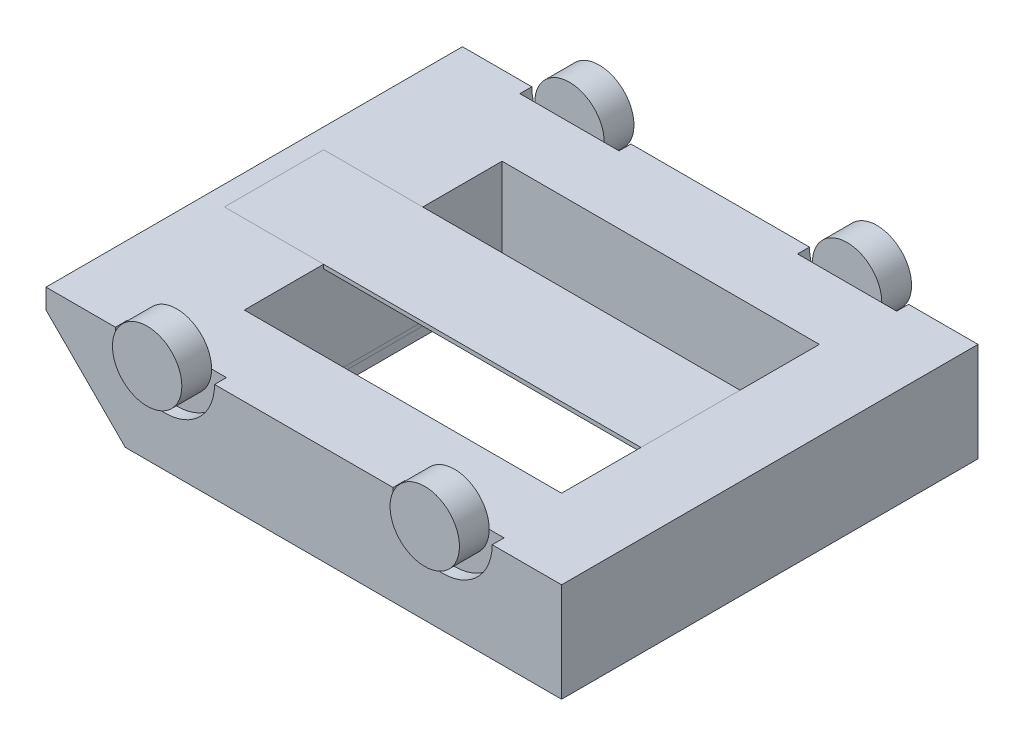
ISO-10303-21;
HEADER;
FILE_DESCRIPTION(('STEP AP214'),'2;1');
FILE_NAME('part.step','',(''),(''),'','','');
FILE_SCHEMA(('AUTOMOTIVE_DESIGN { 1 0 10303 214 1 1 1 1 }'));
ENDSEC;
DATA;
#1=APPLICATION_CONTEXT('core data for automotive mechanical design processes');
#2=APPLICATION_PROTOCOL_DEFINITION('international standard','automotive_design',2000,#1);
#3=PRODUCT_CONTEXT('',#1,'mechanical');
#4=PRODUCT('Part','Part','',(#3));
#5=PRODUCT_RELATED_PRODUCT_CATEGORY('part','',(#4));
#6=PRODUCT_DEFINITION_FORMATION('','',#4);
#7=PRODUCT_DEFINITION_CONTEXT('part definition',#1,'design');
#8=PRODUCT_DEFINITION('design','',#6,#7);
#9=PRODUCT_DEFINITION_SHAPE('','',#8);
#10=(LENGTH_UNIT() NAMED_UNIT(*) SI_UNIT(.MILLI.,.METRE.));
#11=(NAMED_UNIT(*) PLANE_ANGLE_UNIT() SI_UNIT($,.RADIAN.));
#12=(NAMED_UNIT(*) SI_UNIT($,.STERADIAN.) SOLID_ANGLE_UNIT());
#13=UNCERTAINTY_MEASURE_WITH_UNIT(LENGTH_MEASURE(1.E-05),#10,'distance_accuracy_value','');
#14=(GEOMETRIC_REPRESENTATION_CONTEXT(3) GLOBAL_UNCERTAINTY_ASSIGNED_CONTEXT((#13)) GLOBAL_UNIT_ASSIGNED_CONTEXT((#10,
#11,#12)) REPRESENTATION_CONTEXT('',''));
#15=CARTESIAN_POINT('',(0.,0.,0.));
#16=DIRECTION('',(0.,0.,1.));
#17=DIRECTION('',(1.,0.,0.));
#18=AXIS2_PLACEMENT_3D('',#15,#16,#17);
#19=CARTESIAN_POINT('',(600.000000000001,520.000000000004,-1140.));
#20=DIRECTION('',(0.,0.,1.));
#21=DIRECTION('',(0.,-1.,0.));
#22=AXIS2_PLACEMENT_3D('',#19,#20,#21);
#23=CYLINDRICAL_SURFACE('',#22,175.);
#24=CARTESIAN_POINT('',(600.000000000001,520.000000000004,-1140.));
#25=DIRECTION('',(0.,0.,-1.));
#26=DIRECTION('',(0.,1.,0.));
#27=AXIS2_PLACEMENT_3D('',#24,#25,#26);
#28=CIRCLE('',#27,175.);
#29=CARTESIAN_POINT('',(600.000000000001,695.000000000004,-1140.));
#30=VERTEX_POINT('',#29);
#31=EDGE_CURVE('E95',#30,#30,#28,.T.);
#32=ORIENTED_EDGE('',*,*,#31,.F.);
#33=EDGE_LOOP('',(#32));
#34=FACE_BOUND('',#33,.T.);
#35=CARTESIAN_POINT('',(600.000000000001,520.000000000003,-989.999999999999));
#36=DIRECTION('',(0.,0.,-1.));
#37=DIRECTION('',(0.,1.,0.));
#38=AXIS2_PLACEMENT_3D('',#35,#36,#37);
#39=CIRCLE('',#38,175.);
#40=CARTESIAN_POINT('',(600.000000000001,695.000000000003,-989.999999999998));
#41=VERTEX_POINT('',#40);
#42=EDGE_CURVE('E13',#41,#41,#39,.T.);
#43=ORIENTED_EDGE('',*,*,#42,.T.);
#44=EDGE_LOOP('',(#43));
#45=FACE_BOUND('',#44,.T.);
#46=ADVANCED_FACE('F91',(#34,#45),#23,.T.);
#47=CARTESIAN_POINT('',(600.000000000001,520.000000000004,-1140.));
#48=DIRECTION('',(0.,0.,-1.));
#49=DIRECTION('',(0.,1.,0.));
#50=AXIS2_PLACEMENT_3D('',#47,#48,#49);
#51=PLANE('',#50);
#52=ORIENTED_EDGE('',*,*,#31,.T.);
#53=EDGE_LOOP('',(#52));
#54=FACE_BOUND('',#53,.T.);
#55=ADVANCED_FACE('F93',(#54),#51,.T.);
#56=CARTESIAN_POINT('',(600.000000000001,520.000000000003,-989.999999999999));
#57=DIRECTION('',(0.,0.,-1.));
#58=DIRECTION('',(0.,1.,0.));
#59=AXIS2_PLACEMENT_3D('',#56,#57,#58);
#60=PLANE('',#59);
#61=ORIENTED_EDGE('',*,*,#42,.F.);
#62=EDGE_LOOP('',(#61));
#63=FACE_BOUND('',#62,.T.);
#64=ADVANCED_FACE('F110',(#63),#60,.F.);
#65=CLOSED_SHELL('',(#46,#55,#64));
#66=MANIFOLD_SOLID_BREP('B2',#65);
#67=CARTESIAN_POINT('',(-800.,520.000000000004,-1140.));
#68=DIRECTION('',(0.,0.,1.));
#69=DIRECTION('',(0.,-1.,0.));
#70=AXIS2_PLACEMENT_3D('',#67,#68,#69);
#71=CYLINDRICAL_SURFACE('',#70,175.);
#72=CARTESIAN_POINT('',(-800.,520.000000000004,-1140.));
#73=DIRECTION('',(0.,0.,-1.));
#74=DIRECTION('',(0.,1.,0.));
#75=AXIS2_PLACEMENT_3D('',#72,#73,#74);
#76=CIRCLE('',#75,175.);
#77=CARTESIAN_POINT('',(-800.,695.000000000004,-1140.));
#78=VERTEX_POINT('',#77);
#79=EDGE_CURVE('E90',#78,#78,#76,.T.);
#80=ORIENTED_EDGE('',*,*,#79,.F.);
#81=EDGE_LOOP('',(#80));
#82=FACE_BOUND('',#81,.T.);
#83=CARTESIAN_POINT('',(-800.,520.000000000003,-989.999999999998));
#84=DIRECTION('',(0.,0.,-1.));
#85=DIRECTION('',(0.,1.,0.));
#86=AXIS2_PLACEMENT_3D('',#83,#84,#85);
#87=CIRCLE('',#86,175.);
#88=CARTESIAN_POINT('',(-800.,695.000000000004,-989.999999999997));
#89=VERTEX_POINT('',#88);
#90=EDGE_CURVE('E143',#89,#89,#87,.T.);
#91=ORIENTED_EDGE('',*,*,#90,.T.);
#92=EDGE_LOOP('',(#91));
#93=FACE_BOUND('',#92,.T.);
#94=ADVANCED_FACE('F140',(#82,#93),#71,.T.);
#95=CARTESIAN_POINT('',(-800.,520.000000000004,-1140.));
#96=DIRECTION('',(0.,0.,-1.));
#97=DIRECTION('',(0.,1.,0.));
#98=AXIS2_PLACEMENT_3D('',#95,#96,#97);
#99=PLANE('',#98);
#100=ORIENTED_EDGE('',*,*,#79,.T.);
#101=EDGE_LOOP('',(#100));
#102=FACE_BOUND('',#101,.T.);
#103=ADVANCED_FACE('F155',(#102),#99,.T.);
#104=CARTESIAN_POINT('',(-800.,520.000000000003,-989.999999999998));
#105=DIRECTION('',(0.,0.,-1.));
#106=DIRECTION('',(0.,1.,0.));
#107=AXIS2_PLACEMENT_3D('',#104,#105,#106);
#108=PLANE('',#107);
#109=ORIENTED_EDGE('',*,*,#90,.F.);
#110=EDGE_LOOP('',(#109));
#111=FACE_BOUND('',#110,.T.);
#112=ADVANCED_FACE('F153',(#111),#108,.F.);
#113=CLOSED_SHELL('',(#94,#103,#112));
#114=MANIFOLD_SOLID_BREP('B8',#113);
#115=CARTESIAN_POINT('',(-800.,519.999999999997,1140.));
#116=DIRECTION('',(0.,0.,-1.));
#117=DIRECTION('',(-1.,0.,0.));
#118=AXIS2_PLACEMENT_3D('',#115,#116,#117);
#119=CYLINDRICAL_SURFACE('',#118,175.);
#120=CARTESIAN_POINT('',(-800.,519.999999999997,1140.));
#121=DIRECTION('',(0.,0.,1.));
#122=DIRECTION('',(1.,0.,0.));
#123=AXIS2_PLACEMENT_3D('',#120,#121,#122);
#124=CIRCLE('',#123,175.);
#125=CARTESIAN_POINT('',(-625.,519.999999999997,1140.));
#126=VERTEX_POINT('',#125);
#127=EDGE_CURVE('E193',#126,#126,#124,.T.);
#128=ORIENTED_EDGE('',*,*,#127,.F.);
#129=EDGE_LOOP('',(#128));
#130=FACE_BOUND('',#129,.T.);
#131=CARTESIAN_POINT('',(-800.,519.999999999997,990.));
#132=DIRECTION('',(0.,0.,1.));
#133=DIRECTION('',(1.,0.,0.));
#134=AXIS2_PLACEMENT_3D('',#131,#132,#133);
#135=CIRCLE('',#134,175.);
#136=CARTESIAN_POINT('',(-625.,519.999999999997,990.));
#137=VERTEX_POINT('',#136);
#138=EDGE_CURVE('E139',#137,#137,#135,.T.);
#139=ORIENTED_EDGE('',*,*,#138,.T.);
#140=EDGE_LOOP('',(#139));
#141=FACE_BOUND('',#140,.T.);
#142=ADVANCED_FACE('F189',(#130,#141),#119,.T.);
#143=CARTESIAN_POINT('',(-800.,519.999999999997,1140.));
#144=DIRECTION('',(0.,0.,1.));
#145=DIRECTION('',(1.,0.,0.));
#146=AXIS2_PLACEMENT_3D('',#143,#144,#145);
#147=PLANE('',#146);
#148=ORIENTED_EDGE('',*,*,#127,.T.);
#149=EDGE_LOOP('',(#148));
#150=FACE_BOUND('',#149,.T.);
#151=ADVANCED_FACE('F191',(#150),#147,.T.);
#152=CARTESIAN_POINT('',(-800.,519.999999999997,990.));
#153=DIRECTION('',(0.,0.,1.));
#154=DIRECTION('',(1.,0.,0.));
#155=AXIS2_PLACEMENT_3D('',#152,#153,#154);
#156=PLANE('',#155);
#157=ORIENTED_EDGE('',*,*,#138,.F.);
#158=EDGE_LOOP('',(#157));
#159=FACE_BOUND('',#158,.T.);
#160=ADVANCED_FACE('F208',(#159),#156,.F.);
#161=CLOSED_SHELL('',(#142,#151,#160));
#162=MANIFOLD_SOLID_BREP('B85',#161);
#163=CARTESIAN_POINT('',(600.000000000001,519.999999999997,1140.));
#164=DIRECTION('',(0.,0.,-1.));
#165=DIRECTION('',(-1.,0.,0.));
#166=AXIS2_PLACEMENT_3D('',#163,#164,#165);
#167=CYLINDRICAL_SURFACE('',#166,175.);
#168=CARTESIAN_POINT('',(600.000000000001,519.999999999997,1140.));
#169=DIRECTION('',(0.,0.,1.));
#170=DIRECTION('',(1.,0.,0.));
#171=AXIS2_PLACEMENT_3D('',#168,#169,#170);
#172=CIRCLE('',#171,175.);
#173=CARTESIAN_POINT('',(775.000000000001,519.999999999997,1140.));
#174=VERTEX_POINT('',#173);
#175=EDGE_CURVE('E188',#174,#174,#172,.T.);
#176=ORIENTED_EDGE('',*,*,#175,.F.);
#177=EDGE_LOOP('',(#176));
#178=FACE_BOUND('',#177,.T.);
#179=CARTESIAN_POINT('',(600.000000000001,519.999999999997,990.));
#180=DIRECTION('',(0.,0.,1.));
#181=DIRECTION('',(1.,0.,0.));
#182=AXIS2_PLACEMENT_3D('',#179,#180,#181);
#183=CIRCLE('',#182,175.);
#184=CARTESIAN_POINT('',(775.000000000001,519.999999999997,990.));
#185=VERTEX_POINT('',#184);
#186=EDGE_CURVE('E243',#185,#185,#183,.T.);
#187=ORIENTED_EDGE('',*,*,#186,.T.);
#188=EDGE_LOOP('',(#187));
#189=FACE_BOUND('',#188,.T.);
#190=ADVANCED_FACE('F240',(#178,#189),#167,.T.);
#191=CARTESIAN_POINT('',(600.000000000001,519.999999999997,1140.));
#192=DIRECTION('',(0.,0.,1.));
#193=DIRECTION('',(1.,0.,0.));
#194=AXIS2_PLACEMENT_3D('',#191,#192,#193);
#195=PLANE('',#194);
#196=ORIENTED_EDGE('',*,*,#175,.T.);
#197=EDGE_LOOP('',(#196));
#198=FACE_BOUND('',#197,.T.);
#199=ADVANCED_FACE('F255',(#198),#195,.T.);
#200=CARTESIAN_POINT('',(600.000000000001,519.999999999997,990.));
#201=DIRECTION('',(0.,0.,1.));
#202=DIRECTION('',(1.,0.,0.));
#203=AXIS2_PLACEMENT_3D('',#200,#201,#202);
#204=PLANE('',#203);
#205=ORIENTED_EDGE('',*,*,#186,.F.);
#206=EDGE_LOOP('',(#205));
#207=FACE_BOUND('',#206,.T.);
#208=ADVANCED_FACE('F253',(#207),#204,.F.);
#209=CLOSED_SHELL('',(#190,#199,#208));
#210=MANIFOLD_SOLID_BREP('B134',#209);
#211=CARTESIAN_POINT('',(-1300.,499.999999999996,-250.));
#212=DIRECTION('',(0.,0.,-1.));
#213=DIRECTION('',(-1.,0.,0.));
#214=AXIS2_PLACEMENT_3D('',#211,#212,#213);
#215=PLANE('',#214);
#216=DIRECTION('',(0.,1.,0.));
#217=VECTOR('',#216,1.);
#218=CARTESIAN_POINT('',(1200.,499.999999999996,-250.));
#219=LINE('',#218,#217);
#220=CARTESIAN_POINT('',(1200.,499.999999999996,-250.));
#221=VERTEX_POINT('',#220);
#222=CARTESIAN_POINT('',(1200.,519.999999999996,-250.));
#223=VERTEX_POINT('',#222);
#224=EDGE_CURVE('E355',#221,#223,#219,.T.);
#225=ORIENTED_EDGE('',*,*,#224,.F.);
#226=DIRECTION('',(1.,0.,0.));
#227=VECTOR('',#226,1.);
#228=CARTESIAN_POINT('',(-1300.,499.999999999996,-250.));
#229=LINE('',#228,#227);
#230=CARTESIAN_POINT('',(-1300.,499.999999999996,-250.));
#231=VERTEX_POINT('',#230);
#232=EDGE_CURVE('E238',#231,#221,#229,.T.);
#233=ORIENTED_EDGE('',*,*,#232,.F.);
#234=DIRECTION('',(0.,1.,0.));
#235=VECTOR('',#234,1.);
#236=CARTESIAN_POINT('',(-1300.,499.999999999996,-250.));
#237=LINE('',#236,#235);
#238=CARTESIAN_POINT('',(-1300.,519.999999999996,-250.));
#239=VERTEX_POINT('',#238);
#240=EDGE_CURVE('E349',#231,#239,#237,.T.);
#241=ORIENTED_EDGE('',*,*,#240,.T.);
#242=DIRECTION('',(1.,0.,0.));
#243=VECTOR('',#242,1.);
#244=CARTESIAN_POINT('',(-1300.,519.999999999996,-250.));
#245=LINE('',#244,#243);
#246=EDGE_CURVE('E294',#239,#223,#245,.T.);
#247=ORIENTED_EDGE('',*,*,#246,.T.);
#248=EDGE_LOOP('',(#225,#233,#241,#247));
#249=FACE_BOUND('',#248,.T.);
#250=ADVANCED_FACE('F291',(#249),#215,.T.);
#251=CARTESIAN_POINT('',(-1300.,499.999999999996,-250.));
#252=DIRECTION('',(0.,-1.,0.));
#253=DIRECTION('',(1.,0.,0.));
#254=AXIS2_PLACEMENT_3D('',#251,#252,#253);
#255=PLANE('',#254);
#256=DIRECTION('',(0.,0.,-1.));
#257=VECTOR('',#256,1.);
#258=CARTESIAN_POINT('',(1200.,499.999999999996,-250.));
#259=LINE('',#258,#257);
#260=CARTESIAN_POINT('',(1200.,499.999999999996,250.));
#261=VERTEX_POINT('',#260);
#262=EDGE_CURVE('E351',#261,#221,#259,.T.);
#263=ORIENTED_EDGE('',*,*,#262,.F.);
#264=DIRECTION('',(1.,0.,0.));
#265=VECTOR('',#264,1.);
#266=CARTESIAN_POINT('',(-1300.,499.999999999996,250.));
#267=LINE('',#266,#265);
#268=CARTESIAN_POINT('',(-1300.,499.999999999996,250.));
#269=VERTEX_POINT('',#268);
#270=EDGE_CURVE('E300',#269,#261,#267,.T.);
#271=ORIENTED_EDGE('',*,*,#270,.F.);
#272=DIRECTION('',(0.,0.,-1.));
#273=VECTOR('',#272,1.);
#274=CARTESIAN_POINT('',(-1300.,499.999999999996,-250.));
#275=LINE('',#274,#273);
#276=EDGE_CURVE('E346',#269,#231,#275,.T.);
#277=ORIENTED_EDGE('',*,*,#276,.T.);
#278=ORIENTED_EDGE('',*,*,#232,.T.);
#279=EDGE_LOOP('',(#263,#271,#277,#278));
#280=FACE_BOUND('',#279,.T.);
#281=ADVANCED_FACE('F365',(#280),#255,.T.);
#282=CARTESIAN_POINT('',(-1300.,499.999999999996,250.));
#283=DIRECTION('',(0.,0.,1.));
#284=DIRECTION('',(1.,0.,0.));
#285=AXIS2_PLACEMENT_3D('',#282,#283,#284);
#286=PLANE('',#285);
#287=DIRECTION('',(0.,-1.,0.));
#288=VECTOR('',#287,1.);
#289=CARTESIAN_POINT('',(1200.,499.999999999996,250.));
#290=LINE('',#289,#288);
#291=CARTESIAN_POINT('',(1200.,519.999999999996,250.));
#292=VERTEX_POINT('',#291);
#293=EDGE_CURVE('E341',#292,#261,#290,.T.);
#294=ORIENTED_EDGE('',*,*,#293,.F.);
#295=DIRECTION('',(1.,0.,0.));
#296=VECTOR('',#295,1.);
#297=CARTESIAN_POINT('',(-1300.,519.999999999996,250.));
#298=LINE('',#297,#296);
#299=CARTESIAN_POINT('',(-1300.,519.999999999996,250.));
#300=VERTEX_POINT('',#299);
#301=EDGE_CURVE('E336',#300,#292,#298,.T.);
#302=ORIENTED_EDGE('',*,*,#301,.F.);
#303=DIRECTION('',(0.,-1.,0.));
#304=VECTOR('',#303,1.);
#305=CARTESIAN_POINT('',(-1300.,499.999999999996,250.));
#306=LINE('',#305,#304);
#307=EDGE_CURVE('E339',#300,#269,#306,.T.);
#308=ORIENTED_EDGE('',*,*,#307,.T.);
#309=ORIENTED_EDGE('',*,*,#270,.T.);
#310=EDGE_LOOP('',(#294,#302,#308,#309));
#311=FACE_BOUND('',#310,.T.);
#312=ADVANCED_FACE('F338',(#311),#286,.T.);
#313=CARTESIAN_POINT('',(-1300.,519.999999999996,-250.));
#314=DIRECTION('',(0.,1.,0.));
#315=DIRECTION('',(-1.,0.,0.));
#316=AXIS2_PLACEMENT_3D('',#313,#314,#315);
#317=PLANE('',#316);
#318=DIRECTION('',(0.,0.,1.));
#319=VECTOR('',#318,1.);
#320=CARTESIAN_POINT('',(1200.,519.999999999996,-250.));
#321=LINE('',#320,#319);
#322=EDGE_CURVE('E358',#223,#292,#321,.T.);
#323=ORIENTED_EDGE('',*,*,#322,.F.);
#324=ORIENTED_EDGE('',*,*,#246,.F.);
#325=DIRECTION('',(0.,0.,1.));
#326=VECTOR('',#325,1.);
#327=CARTESIAN_POINT('',(-1300.,519.999999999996,-250.));
#328=LINE('',#327,#326);
#329=EDGE_CURVE('E345',#239,#300,#328,.T.);
#330=ORIENTED_EDGE('',*,*,#329,.T.);
#331=ORIENTED_EDGE('',*,*,#301,.T.);
#332=EDGE_LOOP('',(#323,#324,#330,#331));
#333=FACE_BOUND('',#332,.T.);
#334=ADVANCED_FACE('F348',(#333),#317,.T.);
#335=CARTESIAN_POINT('',(-1300.,0.,2.64338815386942E-13));
#336=DIRECTION('',(1.,0.,0.));
#337=DIRECTION('',(0.,0.,-1.));
#338=AXIS2_PLACEMENT_3D('',#335,#336,#337);
#339=PLANE('',#338);
#340=ORIENTED_EDGE('',*,*,#240,.F.);
#341=ORIENTED_EDGE('',*,*,#276,.F.);
#342=ORIENTED_EDGE('',*,*,#307,.F.);
#343=ORIENTED_EDGE('',*,*,#329,.F.);
#344=EDGE_LOOP('',(#340,#341,#342,#343));
#345=FACE_BOUND('',#344,.T.);
#346=ADVANCED_FACE('F344',(#345),#339,.F.);
#347=CARTESIAN_POINT('',(1200.,0.,0.));
#348=DIRECTION('',(1.,0.,0.));
#349=DIRECTION('',(0.,0.,-1.));
#350=AXIS2_PLACEMENT_3D('',#347,#348,#349);
#351=PLANE('',#350);
#352=ORIENTED_EDGE('',*,*,#224,.T.);
#353=ORIENTED_EDGE('',*,*,#322,.T.);
#354=ORIENTED_EDGE('',*,*,#293,.T.);
#355=ORIENTED_EDGE('',*,*,#262,.T.);
#356=EDGE_LOOP('',(#352,#353,#354,#355));
#357=FACE_BOUND('',#356,.T.);
#358=ADVANCED_FACE('F364',(#357),#351,.T.);
#359=CLOSED_SHELL('',(#250,#281,#312,#334,#346,#358));
#360=MANIFOLD_SOLID_BREP('B183',#359);
#361=CARTESIAN_POINT('',(-1400.,520.000000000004,-1050.));
#362=DIRECTION('',(1.,0.,0.));
#363=DIRECTION('',(0.,0.,-1.));
#364=AXIS2_PLACEMENT_3D('',#361,#362,#363);
#365=PLANE('',#364);
#366=DIRECTION('',(0.,-1.,0.));
#367=VECTOR('',#366,1.);
#368=CARTESIAN_POINT('',(-1400.,520.000000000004,-1050.));
#369=LINE('',#368,#367);
#370=CARTESIAN_POINT('',(-1400.,520.000000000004,-1050.));
#371=VERTEX_POINT('',#370);
#372=CARTESIAN_POINT('',(-1400.,420.000000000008,-1050.));
#373=VERTEX_POINT('',#372);
#374=EDGE_CURVE('E601',#371,#373,#369,.T.);
#375=ORIENTED_EDGE('',*,*,#374,.T.);
#376=DIRECTION('',(0.,0.,-1.));
#377=VECTOR('',#376,1.);
#378=CARTESIAN_POINT('',(-1400.,420.000000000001,1050.));
#379=LINE('',#378,#377);
#380=CARTESIAN_POINT('',(-1400.,420.000000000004,-600.000000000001));
#381=VERTEX_POINT('',#380);
#382=EDGE_CURVE('E677',#381,#373,#379,.T.);
#383=ORIENTED_EDGE('',*,*,#382,.F.);
#384=DIRECTION('',(0.,0.,-1.));
#385=VECTOR('',#384,1.);
#386=CARTESIAN_POINT('',(-1400.,420.000000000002,599.999999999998));
#387=LINE('',#386,#385);
#388=CARTESIAN_POINT('',(-1400.,420.000000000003,599.999999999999));
#389=VERTEX_POINT('',#388);
#390=EDGE_CURVE('E711',#389,#381,#387,.T.);
#391=ORIENTED_EDGE('',*,*,#390,.F.);
#392=CARTESIAN_POINT('',(-1400.,420.000000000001,1050.));
#393=VERTEX_POINT('',#392);
#394=EDGE_CURVE('E699',#393,#389,#379,.T.);
#395=ORIENTED_EDGE('',*,*,#394,.F.);
#396=DIRECTION('',(0.,-1.,0.));
#397=VECTOR('',#396,1.);
#398=CARTESIAN_POINT('',(-1400.,519.999999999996,1050.));
#399=LINE('',#398,#397);
#400=CARTESIAN_POINT('',(-1400.,519.999999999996,1050.));
#401=VERTEX_POINT('',#400);
#402=EDGE_CURVE('E619',#401,#393,#399,.T.);
#403=ORIENTED_EDGE('',*,*,#402,.F.);
#404=DIRECTION('',(0.,0.,1.));
#405=VECTOR('',#404,1.);
#406=CARTESIAN_POINT('',(-1400.,520.000000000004,-1050.));
#407=LINE('',#406,#405);
#408=EDGE_CURVE('E592',#371,#401,#407,.T.);
#409=ORIENTED_EDGE('',*,*,#408,.F.);
#410=EDGE_LOOP('',(#375,#383,#391,#395,#403,#409));
#411=FACE_BOUND('',#410,.T.);
#412=ADVANCED_FACE('F425',(#411),#365,.F.);
#413=CARTESIAN_POINT('',(-1400.,519.999999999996,1050.));
#414=DIRECTION('',(0.,0.,-1.));
#415=DIRECTION('',(0.,1.,0.));
#416=AXIS2_PLACEMENT_3D('',#413,#414,#415);
#417=PLANE('',#416);
#418=DIRECTION('',(1.,0.,0.));
#419=VECTOR('',#418,1.);
#420=CARTESIAN_POINT('',(-1400.,519.999999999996,1050.));
#421=LINE('',#420,#419);
#422=CARTESIAN_POINT('',(850.000000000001,519.999999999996,1050.));
#423=VERTEX_POINT('',#422);
#424=CARTESIAN_POINT('',(1200.,519.999999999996,1050.));
#425=VERTEX_POINT('',#424);
#426=EDGE_CURVE('E589',#423,#425,#421,.T.);
#427=ORIENTED_EDGE('',*,*,#426,.F.);
#428=CARTESIAN_POINT('',(600.000000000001,519.999999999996,1050.));
#429=DIRECTION('',(0.,0.,1.));
#430=DIRECTION('',(1.,0.,0.));
#431=AXIS2_PLACEMENT_3D('',#428,#429,#430);
#432=CIRCLE('',#431,250.);
#433=CARTESIAN_POINT('',(350.000000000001,519.999999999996,1050.));
#434=VERTEX_POINT('',#433);
#435=EDGE_CURVE('E575',#434,#423,#432,.T.);
#436=ORIENTED_EDGE('',*,*,#435,.F.);
#437=CARTESIAN_POINT('',(-550.,519.999999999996,1050.));
#438=VERTEX_POINT('',#437);
#439=EDGE_CURVE('E582',#438,#434,#421,.T.);
#440=ORIENTED_EDGE('',*,*,#439,.F.);
#441=CARTESIAN_POINT('',(-800.,519.999999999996,1050.));
#442=DIRECTION('',(0.,0.,1.));
#443=DIRECTION('',(1.,0.,0.));
#444=AXIS2_PLACEMENT_3D('',#441,#442,#443);
#445=CIRCLE('',#444,250.);
#446=CARTESIAN_POINT('',(-1050.,519.999999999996,1050.));
#447=VERTEX_POINT('',#446);
#448=EDGE_CURVE('E565',#447,#438,#445,.T.);
#449=ORIENTED_EDGE('',*,*,#448,.F.);
#450=EDGE_CURVE('E588',#401,#447,#421,.T.);
#451=ORIENTED_EDGE('',*,*,#450,.F.);
#452=ORIENTED_EDGE('',*,*,#402,.T.);
#453=DIRECTION('',(0.707106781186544,-0.707106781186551,0.));
#454=VECTOR('',#453,1.);
#455=CARTESIAN_POINT('',(-1400.,420.000000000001,1050.));
#456=LINE('',#455,#454);
#457=CARTESIAN_POINT('',(-1000.,19.9999999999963,1050.));
#458=VERTEX_POINT('',#457);
#459=EDGE_CURVE('E689',#393,#458,#456,.T.);
#460=ORIENTED_EDGE('',*,*,#459,.T.);
#461=DIRECTION('',(1.,0.,0.));
#462=VECTOR('',#461,1.);
#463=CARTESIAN_POINT('',(-1400.,19.9999999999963,1050.));
#464=LINE('',#463,#462);
#465=CARTESIAN_POINT('',(1200.,19.9999999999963,1050.));
#466=VERTEX_POINT('',#465);
#467=EDGE_CURVE('E603',#458,#466,#464,.T.);
#468=ORIENTED_EDGE('',*,*,#467,.T.);
#469=DIRECTION('',(0.,-1.,0.));
#470=VECTOR('',#469,1.);
#471=CARTESIAN_POINT('',(1200.,519.999999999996,1050.));
#472=LINE('',#471,#470);
#473=EDGE_CURVE('E616',#425,#466,#472,.T.);
#474=ORIENTED_EDGE('',*,*,#473,.F.);
#475=EDGE_LOOP('',(#427,#436,#440,#449,#451,#452,#460,#468,#474));
#476=FACE_BOUND('',#475,.T.);
#477=ADVANCED_FACE('F587',(#476),#417,.F.);
#478=CARTESIAN_POINT('',(1200.,520.000000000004,-1050.));
#479=DIRECTION('',(-1.,0.,0.));
#480=DIRECTION('',(0.,0.,1.));
#481=AXIS2_PLACEMENT_3D('',#478,#479,#480);
#482=PLANE('',#481);
#483=DIRECTION('',(0.,0.,-1.));
#484=VECTOR('',#483,1.);
#485=CARTESIAN_POINT('',(1200.,20.0000000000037,-1050.));
#486=LINE('',#485,#484);
#487=CARTESIAN_POINT('',(1200.,20.0000000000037,-1050.));
#488=VERTEX_POINT('',#487);
#489=EDGE_CURVE('E605',#466,#488,#486,.T.);
#490=ORIENTED_EDGE('',*,*,#489,.T.);
#491=DIRECTION('',(0.,-1.,0.));
#492=VECTOR('',#491,1.);
#493=CARTESIAN_POINT('',(1200.,520.000000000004,-1050.));
#494=LINE('',#493,#492);
#495=CARTESIAN_POINT('',(1200.,520.000000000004,-1050.));
#496=VERTEX_POINT('',#495);
#497=EDGE_CURVE('E613',#496,#488,#494,.T.);
#498=ORIENTED_EDGE('',*,*,#497,.F.);
#499=DIRECTION('',(0.,0.,-1.));
#500=VECTOR('',#499,1.);
#501=CARTESIAN_POINT('',(1200.,520.000000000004,-1050.));
#502=LINE('',#501,#500);
#503=EDGE_CURVE('E591',#425,#496,#502,.T.);
#504=ORIENTED_EDGE('',*,*,#503,.F.);
#505=ORIENTED_EDGE('',*,*,#473,.T.);
#506=EDGE_LOOP('',(#490,#498,#504,#505));
#507=FACE_BOUND('',#506,.T.);
#508=ADVANCED_FACE('F672',(#507),#482,.F.);
#509=CARTESIAN_POINT('',(-1400.,520.000000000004,-1050.));
#510=DIRECTION('',(0.,0.,1.));
#511=DIRECTION('',(0.,-1.,0.));
#512=AXIS2_PLACEMENT_3D('',#509,#510,#511);
#513=PLANE('',#512);
#514=DIRECTION('',(-1.,0.,0.));
#515=VECTOR('',#514,1.);
#516=CARTESIAN_POINT('',(-1400.,520.000000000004,-1050.));
#517=LINE('',#516,#515);
#518=CARTESIAN_POINT('',(-1050.,520.000000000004,-1050.));
#519=VERTEX_POINT('',#518);
#520=EDGE_CURVE('E597',#519,#371,#517,.T.);
#521=ORIENTED_EDGE('',*,*,#520,.F.);
#522=CARTESIAN_POINT('',(-800.,520.000000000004,-1050.));
#523=DIRECTION('',(0.,0.,-1.));
#524=DIRECTION('',(0.,1.,0.));
#525=AXIS2_PLACEMENT_3D('',#522,#523,#524);
#526=CIRCLE('',#525,250.);
#527=CARTESIAN_POINT('',(-550.,520.000000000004,-1050.));
#528=VERTEX_POINT('',#527);
#529=EDGE_CURVE('E798',#528,#519,#526,.T.);
#530=ORIENTED_EDGE('',*,*,#529,.F.);
#531=CARTESIAN_POINT('',(350.000000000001,520.000000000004,-1050.));
#532=VERTEX_POINT('',#531);
#533=EDGE_CURVE('E602',#532,#528,#517,.T.);
#534=ORIENTED_EDGE('',*,*,#533,.F.);
#535=CARTESIAN_POINT('',(600.000000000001,520.000000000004,-1050.));
#536=DIRECTION('',(0.,0.,-1.));
#537=DIRECTION('',(0.,1.,0.));
#538=AXIS2_PLACEMENT_3D('',#535,#536,#537);
#539=CIRCLE('',#538,250.);
#540=CARTESIAN_POINT('',(850.000000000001,520.000000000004,-1050.));
#541=VERTEX_POINT('',#540);
#542=EDGE_CURVE('E809',#541,#532,#539,.T.);
#543=ORIENTED_EDGE('',*,*,#542,.F.);
#544=EDGE_CURVE('E598',#496,#541,#517,.T.);
#545=ORIENTED_EDGE('',*,*,#544,.F.);
#546=ORIENTED_EDGE('',*,*,#497,.T.);
#547=DIRECTION('',(-1.,0.,0.));
#548=VECTOR('',#547,1.);
#549=CARTESIAN_POINT('',(-1400.,20.0000000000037,-1050.));
#550=LINE('',#549,#548);
#551=CARTESIAN_POINT('',(-1000.,20.0000000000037,-1050.));
#552=VERTEX_POINT('',#551);
#553=EDGE_CURVE('E608',#488,#552,#550,.T.);
#554=ORIENTED_EDGE('',*,*,#553,.T.);
#555=DIRECTION('',(0.707106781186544,-0.707106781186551,0.));
#556=VECTOR('',#555,1.);
#557=CARTESIAN_POINT('',(-1400.,420.000000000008,-1050.));
#558=LINE('',#557,#556);
#559=EDGE_CURVE('E685',#373,#552,#558,.T.);
#560=ORIENTED_EDGE('',*,*,#559,.F.);
#561=ORIENTED_EDGE('',*,*,#374,.F.);
#562=EDGE_LOOP('',(#521,#530,#534,#543,#545,#546,#554,#560,#561));
#563=FACE_BOUND('',#562,.T.);
#564=ADVANCED_FACE('F683',(#563),#513,.F.);
#565=CARTESIAN_POINT('',(0.,520.,1.81559220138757E-12));
#566=DIRECTION('',(0.,1.,0.));
#567=DIRECTION('',(0.,0.,1.));
#568=AXIS2_PLACEMENT_3D('',#565,#566,#567);
#569=PLANE('',#568);
#570=DIRECTION('',(0.,0.,1.));
#571=VECTOR('',#570,1.);
#572=CARTESIAN_POINT('',(350.000000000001,519.999999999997,990.));
#573=LINE('',#572,#571);
#574=CARTESIAN_POINT('',(350.000000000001,519.999999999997,990.));
#575=VERTEX_POINT('',#574);
#576=EDGE_CURVE('E289',#575,#434,#573,.T.);
#577=ORIENTED_EDGE('',*,*,#576,.F.);
#578=DIRECTION('',(1.,0.,0.));
#579=VECTOR('',#578,1.);
#580=CARTESIAN_POINT('',(0.,519.999999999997,990.));
#581=LINE('',#580,#579);
#582=CARTESIAN_POINT('',(850.000000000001,519.999999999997,990.));
#583=VERTEX_POINT('',#582);
#584=EDGE_CURVE('E652',#575,#583,#581,.T.);
#585=ORIENTED_EDGE('',*,*,#584,.T.);
#586=DIRECTION('',(0.,0.,1.));
#587=VECTOR('',#586,1.);
#588=CARTESIAN_POINT('',(850.000000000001,519.999999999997,990.));
#589=LINE('',#588,#587);
#590=EDGE_CURVE('E432',#423,#583,#589,.F.);
#591=ORIENTED_EDGE('',*,*,#590,.F.);
#592=ORIENTED_EDGE('',*,*,#426,.T.);
#593=ORIENTED_EDGE('',*,*,#503,.T.);
#594=ORIENTED_EDGE('',*,*,#544,.T.);
#595=DIRECTION('',(0.,0.,-1.));
#596=VECTOR('',#595,1.);
#597=CARTESIAN_POINT('',(850.000000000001,520.000000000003,-989.999999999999));
#598=LINE('',#597,#596);
#599=CARTESIAN_POINT('',(850.000000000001,520.000000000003,-989.999999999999));
#600=VERTEX_POINT('',#599);
#601=EDGE_CURVE('E640',#600,#541,#598,.T.);
#602=ORIENTED_EDGE('',*,*,#601,.F.);
#603=DIRECTION('',(-1.,0.,0.));
#604=VECTOR('',#603,1.);
#605=CARTESIAN_POINT('',(-2.53643260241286E-13,520.000000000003,-989.999999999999));
#606=LINE('',#605,#604);
#607=CARTESIAN_POINT('',(350.000000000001,520.000000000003,-989.999999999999));
#608=VERTEX_POINT('',#607);
#609=EDGE_CURVE('E634',#600,#608,#606,.T.);
#610=ORIENTED_EDGE('',*,*,#609,.T.);
#611=DIRECTION('',(0.,0.,-1.));
#612=VECTOR('',#611,1.);
#613=CARTESIAN_POINT('',(350.000000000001,520.000000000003,-989.999999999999));
#614=LINE('',#613,#612);
#615=EDGE_CURVE('E637',#532,#608,#614,.F.);
#616=ORIENTED_EDGE('',*,*,#615,.F.);
#617=ORIENTED_EDGE('',*,*,#533,.T.);
#618=DIRECTION('',(0.,0.,-1.));
#619=VECTOR('',#618,1.);
#620=CARTESIAN_POINT('',(-550.,520.000000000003,-989.999999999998));
#621=LINE('',#620,#619);
#622=CARTESIAN_POINT('',(-550.,520.000000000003,-989.999999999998));
#623=VERTEX_POINT('',#622);
#624=EDGE_CURVE('E648',#623,#528,#621,.T.);
#625=ORIENTED_EDGE('',*,*,#624,.F.);
#626=DIRECTION('',(-1.,0.,0.));
#627=VECTOR('',#626,1.);
#628=CARTESIAN_POINT('',(-2.53643260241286E-13,520.000000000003,-989.999999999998));
#629=LINE('',#628,#627);
#630=CARTESIAN_POINT('',(-1050.,520.000000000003,-989.999999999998));
#631=VERTEX_POINT('',#630);
#632=EDGE_CURVE('E642',#623,#631,#629,.T.);
#633=ORIENTED_EDGE('',*,*,#632,.T.);
#634=DIRECTION('',(0.,0.,-1.));
#635=VECTOR('',#634,1.);
#636=CARTESIAN_POINT('',(-1050.,520.000000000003,-989.999999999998));
#637=LINE('',#636,#635);
#638=EDGE_CURVE('E645',#519,#631,#637,.F.);
#639=ORIENTED_EDGE('',*,*,#638,.F.);
#640=ORIENTED_EDGE('',*,*,#520,.T.);
#641=ORIENTED_EDGE('',*,*,#408,.T.);
#642=ORIENTED_EDGE('',*,*,#450,.T.);
#643=DIRECTION('',(0.,0.,1.));
#644=VECTOR('',#643,1.);
#645=CARTESIAN_POINT('',(-1050.,519.999999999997,990.));
#646=LINE('',#645,#644);
#647=CARTESIAN_POINT('',(-1050.,519.999999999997,990.));
#648=VERTEX_POINT('',#647);
#649=EDGE_CURVE('E571',#648,#447,#646,.T.);
#650=ORIENTED_EDGE('',*,*,#649,.F.);
#651=DIRECTION('',(1.,0.,0.));
#652=VECTOR('',#651,1.);
#653=CARTESIAN_POINT('',(0.,519.999999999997,990.));
#654=LINE('',#653,#652);
#655=CARTESIAN_POINT('',(-550.,519.999999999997,990.));
#656=VERTEX_POINT('',#655);
#657=EDGE_CURVE('E583',#648,#656,#654,.T.);
#658=ORIENTED_EDGE('',*,*,#657,.T.);
#659=DIRECTION('',(0.,0.,1.));
#660=VECTOR('',#659,1.);
#661=CARTESIAN_POINT('',(-550.,519.999999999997,990.));
#662=LINE('',#661,#660);
#663=EDGE_CURVE('E568',#438,#656,#662,.F.);
#664=ORIENTED_EDGE('',*,*,#663,.F.);
#665=ORIENTED_EDGE('',*,*,#439,.T.);
#666=EDGE_LOOP('',(#577,#585,#591,#592,#593,#594,#602,#610,#616,#617,#625,#633,#639,#640,#641,
#642,#650,#658,#664,#665));
#667=FACE_BOUND('',#666,.T.);
#668=DIRECTION('',(0.,0.,1.));
#669=VECTOR('',#668,1.);
#670=CARTESIAN_POINT('',(800.000000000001,520.000000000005,650.000000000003));
#671=LINE('',#670,#669);
#672=CARTESIAN_POINT('',(800.000000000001,520.00000000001,-649.999999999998));
#673=VERTEX_POINT('',#672);
#674=CARTESIAN_POINT('',(800.000000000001,520.000000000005,650.000000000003));
#675=VERTEX_POINT('',#674);
#676=EDGE_CURVE('E722',#673,#675,#671,.T.);
#677=ORIENTED_EDGE('',*,*,#676,.T.);
#678=DIRECTION('',(-1.,0.,0.));
#679=VECTOR('',#678,1.);
#680=CARTESIAN_POINT('',(800.000000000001,520.000000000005,650.000000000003));
#681=LINE('',#680,#679);
#682=CARTESIAN_POINT('',(-800.,519.999999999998,650.000000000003));
#683=VERTEX_POINT('',#682);
#684=EDGE_CURVE('E733',#675,#683,#681,.T.);
#685=ORIENTED_EDGE('',*,*,#684,.T.);
#686=DIRECTION('',(0.,0.,-1.));
#687=VECTOR('',#686,1.);
#688=CARTESIAN_POINT('',(-800.,520.000000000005,650.000000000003));
#689=LINE('',#688,#687);
#690=CARTESIAN_POINT('',(-800.,520.00000000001,-649.999999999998));
#691=VERTEX_POINT('',#690);
#692=EDGE_CURVE('E736',#683,#691,#689,.T.);
#693=ORIENTED_EDGE('',*,*,#692,.T.);
#694=DIRECTION('',(1.,0.,0.));
#695=VECTOR('',#694,1.);
#696=CARTESIAN_POINT('',(800.000000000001,520.00000000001,-649.999999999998));
#697=LINE('',#696,#695);
#698=EDGE_CURVE('E739',#691,#673,#697,.T.);
#699=ORIENTED_EDGE('',*,*,#698,.T.);
#700=EDGE_LOOP('',(#677,#685,#693,#699));
#701=FACE_BOUND('',#700,.T.);
#702=ADVANCED_FACE('F580',(#667,#701),#569,.T.);
#703=CARTESIAN_POINT('',(0.,20.,0.));
#704=DIRECTION('',(0.,1.,0.));
#705=DIRECTION('',(0.,0.,1.));
#706=AXIS2_PLACEMENT_3D('',#703,#704,#705);
#707=PLANE('',#706);
#708=DIRECTION('',(1.,0.,0.));
#709=VECTOR('',#708,1.);
#710=CARTESIAN_POINT('',(0.,19.9999999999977,650.000000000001));
#711=LINE('',#710,#709);
#712=CARTESIAN_POINT('',(-800.,19.9999999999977,650.000000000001));
#713=VERTEX_POINT('',#712);
#714=CARTESIAN_POINT('',(800.000000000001,19.9999999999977,650.000000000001));
#715=VERTEX_POINT('',#714);
#716=EDGE_CURVE('E622',#713,#715,#711,.T.);
#717=ORIENTED_EDGE('',*,*,#716,.T.);
#718=DIRECTION('',(0.,0.,-1.));
#719=VECTOR('',#718,1.);
#720=CARTESIAN_POINT('',(800.000000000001,20.,0.));
#721=LINE('',#720,#719);
#722=CARTESIAN_POINT('',(800.000000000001,20.0000000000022,-650.));
#723=VERTEX_POINT('',#722);
#724=EDGE_CURVE('E631',#715,#723,#721,.T.);
#725=ORIENTED_EDGE('',*,*,#724,.T.);
#726=DIRECTION('',(-1.,0.,0.));
#727=VECTOR('',#726,1.);
#728=CARTESIAN_POINT('',(0.,20.0000000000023,-650.));
#729=LINE('',#728,#727);
#730=CARTESIAN_POINT('',(-800.,20.,-650.));
#731=VERTEX_POINT('',#730);
#732=EDGE_CURVE('E628',#723,#731,#729,.T.);
#733=ORIENTED_EDGE('',*,*,#732,.T.);
#734=DIRECTION('',(0.,0.,1.));
#735=VECTOR('',#734,1.);
#736=CARTESIAN_POINT('',(-800.,20.,0.));
#737=LINE('',#736,#735);
#738=EDGE_CURVE('E625',#731,#713,#737,.T.);
#739=ORIENTED_EDGE('',*,*,#738,.T.);
#740=EDGE_LOOP('',(#717,#725,#733,#739));
#741=FACE_BOUND('',#740,.T.);
#742=ORIENTED_EDGE('',*,*,#467,.F.);
#743=DIRECTION('',(0.,0.,-1.));
#744=VECTOR('',#743,1.);
#745=CARTESIAN_POINT('',(-1000.,19.9999999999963,1050.));
#746=LINE('',#745,#744);
#747=EDGE_CURVE('E606',#458,#552,#746,.T.);
#748=ORIENTED_EDGE('',*,*,#747,.T.);
#749=ORIENTED_EDGE('',*,*,#553,.F.);
#750=ORIENTED_EDGE('',*,*,#489,.F.);
#751=EDGE_LOOP('',(#742,#748,#749,#750));
#752=FACE_BOUND('',#751,.T.);
#753=ADVANCED_FACE('F756',(#741,#752),#707,.F.);
#754=CARTESIAN_POINT('',(-1400.,420.000000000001,1050.));
#755=DIRECTION('',(0.707106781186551,0.707106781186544,0.));
#756=DIRECTION('',(-0.707106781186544,0.707106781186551,0.));
#757=AXIS2_PLACEMENT_3D('',#754,#755,#756);
#758=PLANE('',#757);
#759=ORIENTED_EDGE('',*,*,#394,.T.);
#760=DIRECTION('',(-0.707106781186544,0.707106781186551,0.));
#761=VECTOR('',#760,1.);
#762=CARTESIAN_POINT('',(-1046.44660940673,66.4466094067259,599.999999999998));
#763=LINE('',#762,#761);
#764=CARTESIAN_POINT('',(-1046.44660940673,66.4466094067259,599.999999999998));
#765=VERTEX_POINT('',#764);
#766=EDGE_CURVE('E716',#765,#389,#763,.T.);
#767=ORIENTED_EDGE('',*,*,#766,.F.);
#768=DIRECTION('',(0.,0.,1.));
#769=VECTOR('',#768,1.);
#770=CARTESIAN_POINT('',(-1046.44660940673,66.4466094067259,599.999999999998));
#771=LINE('',#770,#769);
#772=CARTESIAN_POINT('',(-1046.44660940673,66.4466094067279,-600.000000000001));
#773=VERTEX_POINT('',#772);
#774=EDGE_CURVE('E709',#773,#765,#771,.T.);
#775=ORIENTED_EDGE('',*,*,#774,.F.);
#776=DIRECTION('',(0.707106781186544,-0.707106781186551,0.));
#777=VECTOR('',#776,1.);
#778=CARTESIAN_POINT('',(-1046.44660940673,66.4466094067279,-600.000000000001));
#779=LINE('',#778,#777);
#780=EDGE_CURVE('E707',#381,#773,#779,.T.);
#781=ORIENTED_EDGE('',*,*,#780,.F.);
#782=ORIENTED_EDGE('',*,*,#382,.T.);
#783=ORIENTED_EDGE('',*,*,#559,.T.);
#784=ORIENTED_EDGE('',*,*,#747,.F.);
#785=ORIENTED_EDGE('',*,*,#459,.F.);
#786=EDGE_LOOP('',(#759,#767,#775,#781,#782,#783,#784,#785));
#787=FACE_BOUND('',#786,.T.);
#788=ADVANCED_FACE('F704',(#787),#758,.F.);
#789=CARTESIAN_POINT('',(800.000000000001,520.000000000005,650.000000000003));
#790=DIRECTION('',(1.,0.,0.));
#791=DIRECTION('',(0.,1.,0.));
#792=AXIS2_PLACEMENT_3D('',#789,#790,#791);
#793=PLANE('',#792);
#794=DIRECTION('',(0.,-1.,0.));
#795=VECTOR('',#794,1.);
#796=CARTESIAN_POINT('',(800.000000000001,520.000000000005,650.000000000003));
#797=LINE('',#796,#795);
#798=EDGE_CURVE('E741',#675,#715,#797,.T.);
#799=ORIENTED_EDGE('',*,*,#798,.F.);
#800=ORIENTED_EDGE('',*,*,#676,.F.);
#801=DIRECTION('',(0.,-1.,0.));
#802=VECTOR('',#801,1.);
#803=CARTESIAN_POINT('',(800.000000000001,520.00000000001,-649.999999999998));
#804=LINE('',#803,#802);
#805=EDGE_CURVE('E690',#673,#723,#804,.T.);
#806=ORIENTED_EDGE('',*,*,#805,.T.);
#807=ORIENTED_EDGE('',*,*,#724,.F.);
#808=EDGE_LOOP('',(#799,#800,#806,#807));
#809=FACE_BOUND('',#808,.T.);
#810=ADVANCED_FACE('F754',(#809),#793,.F.);
#811=CARTESIAN_POINT('',(800.000000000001,520.00000000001,-649.999999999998));
#812=DIRECTION('',(0.,0.,-1.));
#813=DIRECTION('',(0.,1.,0.));
#814=AXIS2_PLACEMENT_3D('',#811,#812,#813);
#815=PLANE('',#814);
#816=ORIENTED_EDGE('',*,*,#805,.F.);
#817=ORIENTED_EDGE('',*,*,#698,.F.);
#818=DIRECTION('',(0.,-1.,0.));
#819=VECTOR('',#818,1.);
#820=CARTESIAN_POINT('',(-800.,520.00000000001,-649.999999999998));
#821=LINE('',#820,#819);
#822=EDGE_CURVE('E695',#691,#731,#821,.T.);
#823=ORIENTED_EDGE('',*,*,#822,.T.);
#824=ORIENTED_EDGE('',*,*,#732,.F.);
#825=EDGE_LOOP('',(#816,#817,#823,#824));
#826=FACE_BOUND('',#825,.T.);
#827=ADVANCED_FACE('F762',(#826),#815,.F.);
#828=CARTESIAN_POINT('',(-800.,520.000000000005,650.000000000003));
#829=DIRECTION('',(-1.,0.,0.));
#830=DIRECTION('',(0.,-1.,0.));
#831=AXIS2_PLACEMENT_3D('',#828,#829,#830);
#832=PLANE('',#831);
#833=ORIENTED_EDGE('',*,*,#822,.F.);
#834=ORIENTED_EDGE('',*,*,#692,.F.);
#835=DIRECTION('',(0.,-1.,0.));
#836=VECTOR('',#835,1.);
#837=CARTESIAN_POINT('',(-800.,520.000000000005,650.000000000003));
#838=LINE('',#837,#836);
#839=EDGE_CURVE('E745',#683,#713,#838,.T.);
#840=ORIENTED_EDGE('',*,*,#839,.T.);
#841=ORIENTED_EDGE('',*,*,#738,.F.);
#842=EDGE_LOOP('',(#833,#834,#840,#841));
#843=FACE_BOUND('',#842,.T.);
#844=ADVANCED_FACE('F759',(#843),#832,.F.);
#845=CARTESIAN_POINT('',(800.000000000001,520.000000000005,650.000000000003));
#846=DIRECTION('',(0.,0.,1.));
#847=DIRECTION('',(0.,-1.,0.));
#848=AXIS2_PLACEMENT_3D('',#845,#846,#847);
#849=PLANE('',#848);
#850=ORIENTED_EDGE('',*,*,#839,.F.);
#851=ORIENTED_EDGE('',*,*,#684,.F.);
#852=ORIENTED_EDGE('',*,*,#798,.T.);
#853=ORIENTED_EDGE('',*,*,#716,.F.);
#854=EDGE_LOOP('',(#850,#851,#852,#853));
#855=FACE_BOUND('',#854,.T.);
#856=ADVANCED_FACE('F751',(#855),#849,.F.);
#857=CARTESIAN_POINT('',(-1018.16233815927,94.7308806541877,599.999999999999));
#858=DIRECTION('',(0.,0.,1.));
#859=DIRECTION('',(1.,0.,0.));
#860=AXIS2_PLACEMENT_3D('',#857,#858,#859);
#861=PLANE('',#860);
#862=ORIENTED_EDGE('',*,*,#766,.T.);
#863=DIRECTION('',(-0.707106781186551,-0.707106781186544,0.));
#864=VECTOR('',#863,1.);
#865=CARTESIAN_POINT('',(-1371.71572875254,448.284271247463,599.999999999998));
#866=LINE('',#865,#864);
#867=CARTESIAN_POINT('',(-1371.71572875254,448.284271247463,599.999999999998));
#868=VERTEX_POINT('',#867);
#869=EDGE_CURVE('E727',#868,#389,#866,.T.);
#870=ORIENTED_EDGE('',*,*,#869,.F.);
#871=DIRECTION('',(-0.707106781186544,0.707106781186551,0.));
#872=VECTOR('',#871,1.);
#873=CARTESIAN_POINT('',(-1018.16233815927,94.7308806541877,599.999999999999));
#874=LINE('',#873,#872);
#875=CARTESIAN_POINT('',(-1018.16233815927,94.7308806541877,599.999999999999));
#876=VERTEX_POINT('',#875);
#877=EDGE_CURVE('E713',#876,#868,#874,.T.);
#878=ORIENTED_EDGE('',*,*,#877,.F.);
#879=DIRECTION('',(-0.707106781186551,-0.707106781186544,0.));
#880=VECTOR('',#879,1.);
#881=CARTESIAN_POINT('',(-1018.16233815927,94.7308806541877,599.999999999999));
#882=LINE('',#881,#880);
#883=EDGE_CURVE('E720',#876,#765,#882,.T.);
#884=ORIENTED_EDGE('',*,*,#883,.T.);
#885=EDGE_LOOP('',(#862,#870,#878,#884));
#886=FACE_BOUND('',#885,.T.);
#887=ADVANCED_FACE('F795',(#886),#861,.F.);
#888=CARTESIAN_POINT('',(-1018.16233815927,94.7308806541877,599.999999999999));
#889=DIRECTION('',(0.707106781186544,-0.707106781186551,0.));
#890=DIRECTION('',(0.707106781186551,0.707106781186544,0.));
#891=AXIS2_PLACEMENT_3D('',#888,#889,#890);
#892=PLANE('',#891);
#893=ORIENTED_EDGE('',*,*,#774,.T.);
#894=ORIENTED_EDGE('',*,*,#883,.F.);
#895=DIRECTION('',(0.,0.,1.));
#896=VECTOR('',#895,1.);
#897=CARTESIAN_POINT('',(-1018.16233815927,94.7308806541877,599.999999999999));
#898=LINE('',#897,#896);
#899=CARTESIAN_POINT('',(-1018.16233815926,94.7308806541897,-600.000000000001));
#900=VERTEX_POINT('',#899);
#901=EDGE_CURVE('E730',#900,#876,#898,.T.);
#902=ORIENTED_EDGE('',*,*,#901,.F.);
#903=DIRECTION('',(-0.707106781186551,-0.707106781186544,0.));
#904=VECTOR('',#903,1.);
#905=CARTESIAN_POINT('',(-1018.16233815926,94.7308806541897,-600.000000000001));
#906=LINE('',#905,#904);
#907=EDGE_CURVE('E723',#900,#773,#906,.T.);
#908=ORIENTED_EDGE('',*,*,#907,.T.);
#909=EDGE_LOOP('',(#893,#894,#902,#908));
#910=FACE_BOUND('',#909,.T.);
#911=ADVANCED_FACE('F844',(#910),#892,.F.);
#912=CARTESIAN_POINT('',(-1018.16233815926,94.7308806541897,-600.000000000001));
#913=DIRECTION('',(0.,0.,-1.));
#914=DIRECTION('',(0.,1.,0.));
#915=AXIS2_PLACEMENT_3D('',#912,#913,#914);
#916=PLANE('',#915);
#917=ORIENTED_EDGE('',*,*,#780,.T.);
#918=ORIENTED_EDGE('',*,*,#907,.F.);
#919=DIRECTION('',(0.707106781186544,-0.707106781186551,0.));
#920=VECTOR('',#919,1.);
#921=CARTESIAN_POINT('',(-1018.16233815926,94.7308806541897,-600.000000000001));
#922=LINE('',#921,#920);
#923=CARTESIAN_POINT('',(-1371.71572875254,448.284271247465,-600.000000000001));
#924=VERTEX_POINT('',#923);
#925=EDGE_CURVE('E802',#924,#900,#922,.T.);
#926=ORIENTED_EDGE('',*,*,#925,.F.);
#927=DIRECTION('',(-0.707106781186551,-0.707106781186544,0.));
#928=VECTOR('',#927,1.);
#929=CARTESIAN_POINT('',(-1371.71572875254,448.284271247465,-600.000000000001));
#930=LINE('',#929,#928);
#931=EDGE_CURVE('E725',#924,#381,#930,.T.);
#932=ORIENTED_EDGE('',*,*,#931,.T.);
#933=EDGE_LOOP('',(#917,#918,#926,#932));
#934=FACE_BOUND('',#933,.T.);
#935=ADVANCED_FACE('F847',(#934),#916,.F.);
#936=CARTESIAN_POINT('',(-1371.71572875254,448.284271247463,599.999999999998));
#937=DIRECTION('',(-0.707106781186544,0.707106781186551,0.));
#938=DIRECTION('',(-0.707106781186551,-0.707106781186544,0.));
#939=AXIS2_PLACEMENT_3D('',#936,#937,#938);
#940=PLANE('',#939);
#941=ORIENTED_EDGE('',*,*,#390,.T.);
#942=ORIENTED_EDGE('',*,*,#931,.F.);
#943=DIRECTION('',(0.,0.,-1.));
#944=VECTOR('',#943,1.);
#945=CARTESIAN_POINT('',(-1371.71572875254,448.284271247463,599.999999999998));
#946=LINE('',#945,#944);
#947=EDGE_CURVE('E791',#868,#924,#946,.T.);
#948=ORIENTED_EDGE('',*,*,#947,.F.);
#949=ORIENTED_EDGE('',*,*,#869,.T.);
#950=EDGE_LOOP('',(#941,#942,#948,#949));
#951=FACE_BOUND('',#950,.T.);
#952=ADVANCED_FACE('F787',(#951),#940,.F.);
#953=CARTESIAN_POINT('',(-461.715728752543,-461.715728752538,-1.54052042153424E-12));
#954=DIRECTION('',(-0.707106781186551,-0.707106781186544,0.));
#955=DIRECTION('',(0.707106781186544,-0.707106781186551,0.));
#956=AXIS2_PLACEMENT_3D('',#953,#954,#955);
#957=PLANE('',#956);
#958=ORIENTED_EDGE('',*,*,#877,.T.);
#959=ORIENTED_EDGE('',*,*,#947,.T.);
#960=ORIENTED_EDGE('',*,*,#925,.T.);
#961=ORIENTED_EDGE('',*,*,#901,.T.);
#962=EDGE_LOOP('',(#958,#959,#960,#961));
#963=FACE_BOUND('',#962,.T.);
#964=ADVANCED_FACE('F836',(#963),#957,.T.);
#965=CARTESIAN_POINT('',(600.000000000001,520.000000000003,-989.999999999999));
#966=DIRECTION('',(0.,0.,-1.));
#967=DIRECTION('',(0.,1.,0.));
#968=AXIS2_PLACEMENT_3D('',#965,#966,#967);
#969=CYLINDRICAL_SURFACE('',#968,250.);
#970=ORIENTED_EDGE('',*,*,#601,.T.);
#971=ORIENTED_EDGE('',*,*,#542,.T.);
#972=ORIENTED_EDGE('',*,*,#615,.T.);
#973=CARTESIAN_POINT('',(600.000000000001,520.000000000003,-989.999999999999));
#974=DIRECTION('',(0.,0.,-1.));
#975=DIRECTION('',(0.,1.,0.));
#976=AXIS2_PLACEMENT_3D('',#973,#974,#975);
#977=CIRCLE('',#976,250.);
#978=EDGE_CURVE('E807',#600,#608,#977,.T.);
#979=ORIENTED_EDGE('',*,*,#978,.F.);
#980=EDGE_LOOP('',(#970,#971,#972,#979));
#981=FACE_BOUND('',#980,.T.);
#982=ADVANCED_FACE('F833',(#981),#969,.F.);
#983=CARTESIAN_POINT('',(600.000000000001,520.000000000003,-989.999999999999));
#984=DIRECTION('',(0.,0.,-1.));
#985=DIRECTION('',(0.,1.,0.));
#986=AXIS2_PLACEMENT_3D('',#983,#984,#985);
#987=PLANE('',#986);
#988=ORIENTED_EDGE('',*,*,#978,.T.);
#989=ORIENTED_EDGE('',*,*,#609,.F.);
#990=EDGE_LOOP('',(#988,#989));
#991=FACE_BOUND('',#990,.T.);
#992=ADVANCED_FACE('F829',(#991),#987,.T.);
#993=CARTESIAN_POINT('',(-800.,520.000000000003,-989.999999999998));
#994=DIRECTION('',(0.,0.,-1.));
#995=DIRECTION('',(0.,1.,0.));
#996=AXIS2_PLACEMENT_3D('',#993,#994,#995);
#997=CYLINDRICAL_SURFACE('',#996,250.);
#998=ORIENTED_EDGE('',*,*,#624,.T.);
#999=ORIENTED_EDGE('',*,*,#529,.T.);
#1000=ORIENTED_EDGE('',*,*,#638,.T.);
#1001=CARTESIAN_POINT('',(-800.,520.000000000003,-989.999999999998));
#1002=DIRECTION('',(0.,0.,-1.));
#1003=DIRECTION('',(0.,1.,0.));
#1004=AXIS2_PLACEMENT_3D('',#1001,#1002,#1003);
#1005=CIRCLE('',#1004,250.);
#1006=EDGE_CURVE('E797',#623,#631,#1005,.T.);
#1007=ORIENTED_EDGE('',*,*,#1006,.F.);
#1008=EDGE_LOOP('',(#998,#999,#1000,#1007));
#1009=FACE_BOUND('',#1008,.T.);
#1010=ADVANCED_FACE('F816',(#1009),#997,.F.);
#1011=CARTESIAN_POINT('',(-800.,520.000000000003,-989.999999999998));
#1012=DIRECTION('',(0.,0.,-1.));
#1013=DIRECTION('',(0.,1.,0.));
#1014=AXIS2_PLACEMENT_3D('',#1011,#1012,#1013);
#1015=PLANE('',#1014);
#1016=ORIENTED_EDGE('',*,*,#1006,.T.);
#1017=ORIENTED_EDGE('',*,*,#632,.F.);
#1018=EDGE_LOOP('',(#1016,#1017));
#1019=FACE_BOUND('',#1018,.T.);
#1020=ADVANCED_FACE('F822',(#1019),#1015,.T.);
#1021=CARTESIAN_POINT('',(-800.,519.999999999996,990.));
#1022=DIRECTION('',(0.,0.,1.));
#1023=DIRECTION('',(1.,0.,0.));
#1024=AXIS2_PLACEMENT_3D('',#1021,#1022,#1023);
#1025=CYLINDRICAL_SURFACE('',#1024,250.);
#1026=ORIENTED_EDGE('',*,*,#649,.T.);
#1027=ORIENTED_EDGE('',*,*,#448,.T.);
#1028=ORIENTED_EDGE('',*,*,#663,.T.);
#1029=CARTESIAN_POINT('',(-800.,519.999999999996,990.));
#1030=DIRECTION('',(0.,0.,1.));
#1031=DIRECTION('',(1.,0.,0.));
#1032=AXIS2_PLACEMENT_3D('',#1029,#1030,#1031);
#1033=CIRCLE('',#1032,250.);
#1034=EDGE_CURVE('E445',#648,#656,#1033,.T.);
#1035=ORIENTED_EDGE('',*,*,#1034,.F.);
#1036=EDGE_LOOP('',(#1026,#1027,#1028,#1035));
#1037=FACE_BOUND('',#1036,.T.);
#1038=ADVANCED_FACE('F567',(#1037),#1025,.F.);
#1039=CARTESIAN_POINT('',(-800.,519.999999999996,990.));
#1040=DIRECTION('',(0.,0.,1.));
#1041=DIRECTION('',(1.,0.,0.));
#1042=AXIS2_PLACEMENT_3D('',#1039,#1040,#1041);
#1043=PLANE('',#1042);
#1044=ORIENTED_EDGE('',*,*,#1034,.T.);
#1045=ORIENTED_EDGE('',*,*,#657,.F.);
#1046=EDGE_LOOP('',(#1044,#1045));
#1047=FACE_BOUND('',#1046,.T.);
#1048=ADVANCED_FACE('F663',(#1047),#1043,.T.);
#1049=CARTESIAN_POINT('',(600.000000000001,519.999999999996,990.));
#1050=DIRECTION('',(0.,0.,1.));
#1051=DIRECTION('',(1.,0.,0.));
#1052=AXIS2_PLACEMENT_3D('',#1049,#1050,#1051);
#1053=CYLINDRICAL_SURFACE('',#1052,250.);
#1054=ORIENTED_EDGE('',*,*,#576,.T.);
#1055=ORIENTED_EDGE('',*,*,#435,.T.);
#1056=ORIENTED_EDGE('',*,*,#590,.T.);
#1057=CARTESIAN_POINT('',(600.000000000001,519.999999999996,990.));
#1058=DIRECTION('',(0.,0.,1.));
#1059=DIRECTION('',(1.,0.,0.));
#1060=AXIS2_PLACEMENT_3D('',#1057,#1058,#1059);
#1061=CIRCLE('',#1060,250.);
#1062=EDGE_CURVE('E438',#575,#583,#1061,.T.);
#1063=ORIENTED_EDGE('',*,*,#1062,.F.);
#1064=EDGE_LOOP('',(#1054,#1055,#1056,#1063));
#1065=FACE_BOUND('',#1064,.T.);
#1066=ADVANCED_FACE('F656',(#1065),#1053,.F.);
#1067=CARTESIAN_POINT('',(600.000000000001,519.999999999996,990.));
#1068=DIRECTION('',(0.,0.,1.));
#1069=DIRECTION('',(1.,0.,0.));
#1070=AXIS2_PLACEMENT_3D('',#1067,#1068,#1069);
#1071=PLANE('',#1070);
#1072=ORIENTED_EDGE('',*,*,#1062,.T.);
#1073=ORIENTED_EDGE('',*,*,#584,.F.);
#1074=EDGE_LOOP('',(#1072,#1073));
#1075=FACE_BOUND('',#1074,.T.);
#1076=ADVANCED_FACE('F657',(#1075),#1071,.T.);
#1077=CLOSED_SHELL('',(#412,#477,#508,#564,#702,#753,#788,#810,#827,#844,#856,#887,#911,#935,
#952,#964,#982,#992,#1010,#1020,#1038,#1048,#1066,#1076));
#1078=MANIFOLD_SOLID_BREP('B232',#1077);
#1079=CARTESIAN_POINT('',(-900.,20.0000000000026,-750.));
#1080=DIRECTION('',(1.,0.,0.));
#1081=DIRECTION('',(0.,0.,-1.));
#1082=AXIS2_PLACEMENT_3D('',#1079,#1080,#1081);
#1083=PLANE('',#1082);
#1084=DIRECTION('',(0.,0.,1.));
#1085=VECTOR('',#1084,1.);
#1086=CARTESIAN_POINT('',(-900.,2.61861100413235E-12,-750.));
#1087=LINE('',#1086,#1085);
#1088=CARTESIAN_POINT('',(-900.,2.61861100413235E-12,-750.));
#1089=VERTEX_POINT('',#1088);
#1090=CARTESIAN_POINT('',(-900.,-2.61861100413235E-12,750.000000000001));
#1091=VERTEX_POINT('',#1090);
#1092=EDGE_CURVE('E1111',#1089,#1091,#1087,.T.);
#1093=ORIENTED_EDGE('',*,*,#1092,.T.);
#1094=DIRECTION('',(0.,-1.,0.));
#1095=VECTOR('',#1094,1.);
#1096=CARTESIAN_POINT('',(-900.,19.9999999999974,750.000000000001));
#1097=LINE('',#1096,#1095);
#1098=CARTESIAN_POINT('',(-900.,19.9999999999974,750.000000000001));
#1099=VERTEX_POINT('',#1098);
#1100=EDGE_CURVE('E423',#1099,#1091,#1097,.T.);
#1101=ORIENTED_EDGE('',*,*,#1100,.F.);
#1102=DIRECTION('',(0.,0.,1.));
#1103=VECTOR('',#1102,1.);
#1104=CARTESIAN_POINT('',(-900.,20.0000000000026,-750.));
#1105=LINE('',#1104,#1103);
#1106=CARTESIAN_POINT('',(-900.,20.0000000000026,-750.));
#1107=VERTEX_POINT('',#1106);
#1108=EDGE_CURVE('E1112',#1107,#1099,#1105,.T.);
#1109=ORIENTED_EDGE('',*,*,#1108,.F.);
#1110=DIRECTION('',(0.,-1.,0.));
#1111=VECTOR('',#1110,1.);
#1112=CARTESIAN_POINT('',(-900.,20.0000000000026,-750.));
#1113=LINE('',#1112,#1111);
#1114=EDGE_CURVE('E1122',#1107,#1089,#1113,.T.);
#1115=ORIENTED_EDGE('',*,*,#1114,.T.);
#1116=EDGE_LOOP('',(#1093,#1101,#1109,#1115));
#1117=FACE_BOUND('',#1116,.T.);
#1118=ADVANCED_FACE('F1012',(#1117),#1083,.F.);
#1119=CARTESIAN_POINT('',(-900.,19.9999999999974,750.000000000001));
#1120=DIRECTION('',(0.,0.,-1.));
#1121=DIRECTION('',(0.,1.,0.));
#1122=AXIS2_PLACEMENT_3D('',#1119,#1120,#1121);
#1123=PLANE('',#1122);
#1124=DIRECTION('',(1.,0.,0.));
#1125=VECTOR('',#1124,1.);
#1126=CARTESIAN_POINT('',(-900.,-2.61861100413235E-12,750.000000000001));
#1127=LINE('',#1126,#1125);
#1128=CARTESIAN_POINT('',(900.,-2.61861100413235E-12,750.000000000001));
#1129=VERTEX_POINT('',#1128);
#1130=EDGE_CURVE('E1125',#1091,#1129,#1127,.T.);
#1131=ORIENTED_EDGE('',*,*,#1130,.T.);
#1132=DIRECTION('',(0.,-1.,0.));
#1133=VECTOR('',#1132,1.);
#1134=CARTESIAN_POINT('',(900.,19.9999999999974,750.000000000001));
#1135=LINE('',#1134,#1133);
#1136=CARTESIAN_POINT('',(900.,19.9999999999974,750.000000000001));
#1137=VERTEX_POINT('',#1136);
#1138=EDGE_CURVE('E1019',#1137,#1129,#1135,.T.);
#1139=ORIENTED_EDGE('',*,*,#1138,.F.);
#1140=DIRECTION('',(1.,0.,0.));
#1141=VECTOR('',#1140,1.);
#1142=CARTESIAN_POINT('',(-900.,19.9999999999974,750.000000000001));
#1143=LINE('',#1142,#1141);
#1144=EDGE_CURVE('E1115',#1099,#1137,#1143,.T.);
#1145=ORIENTED_EDGE('',*,*,#1144,.F.);
#1146=ORIENTED_EDGE('',*,*,#1100,.T.);
#1147=EDGE_LOOP('',(#1131,#1139,#1145,#1146));
#1148=FACE_BOUND('',#1147,.T.);
#1149=ADVANCED_FACE('F1153',(#1148),#1123,.F.);
#1150=CARTESIAN_POINT('',(900.,20.0000000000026,-750.));
#1151=DIRECTION('',(-1.,0.,0.));
#1152=DIRECTION('',(0.,0.,1.));
#1153=AXIS2_PLACEMENT_3D('',#1150,#1151,#1152);
#1154=PLANE('',#1153);
#1155=DIRECTION('',(0.,0.,-1.));
#1156=VECTOR('',#1155,1.);
#1157=CARTESIAN_POINT('',(900.,2.61861100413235E-12,-750.));
#1158=LINE('',#1157,#1156);
#1159=CARTESIAN_POINT('',(900.,2.61861100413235E-12,-750.));
#1160=VERTEX_POINT('',#1159);
#1161=EDGE_CURVE('E1127',#1129,#1160,#1158,.T.);
#1162=ORIENTED_EDGE('',*,*,#1161,.T.);
#1163=DIRECTION('',(0.,-1.,0.));
#1164=VECTOR('',#1163,1.);
#1165=CARTESIAN_POINT('',(900.,20.0000000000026,-750.));
#1166=LINE('',#1165,#1164);
#1167=CARTESIAN_POINT('',(900.,20.0000000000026,-750.));
#1168=VERTEX_POINT('',#1167);
#1169=EDGE_CURVE('E1132',#1168,#1160,#1166,.T.);
#1170=ORIENTED_EDGE('',*,*,#1169,.F.);
#1171=DIRECTION('',(0.,0.,-1.));
#1172=VECTOR('',#1171,1.);
#1173=CARTESIAN_POINT('',(900.,20.0000000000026,-750.));
#1174=LINE('',#1173,#1172);
#1175=EDGE_CURVE('E1118',#1137,#1168,#1174,.T.);
#1176=ORIENTED_EDGE('',*,*,#1175,.F.);
#1177=ORIENTED_EDGE('',*,*,#1138,.T.);
#1178=EDGE_LOOP('',(#1162,#1170,#1176,#1177));
#1179=FACE_BOUND('',#1178,.T.);
#1180=ADVANCED_FACE('F1139',(#1179),#1154,.F.);
#1181=CARTESIAN_POINT('',(-900.,20.0000000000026,-750.));
#1182=DIRECTION('',(0.,0.,1.));
#1183=DIRECTION('',(0.,-1.,0.));
#1184=AXIS2_PLACEMENT_3D('',#1181,#1182,#1183);
#1185=PLANE('',#1184);
#1186=DIRECTION('',(-1.,0.,0.));
#1187=VECTOR('',#1186,1.);
#1188=CARTESIAN_POINT('',(-900.,2.61861100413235E-12,-750.));
#1189=LINE('',#1188,#1187);
#1190=EDGE_CURVE('E1116',#1160,#1089,#1189,.T.);
#1191=ORIENTED_EDGE('',*,*,#1190,.T.);
#1192=ORIENTED_EDGE('',*,*,#1114,.F.);
#1193=DIRECTION('',(-1.,0.,0.));
#1194=VECTOR('',#1193,1.);
#1195=CARTESIAN_POINT('',(-900.,20.0000000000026,-750.));
#1196=LINE('',#1195,#1194);
#1197=EDGE_CURVE('E1120',#1168,#1107,#1196,.T.);
#1198=ORIENTED_EDGE('',*,*,#1197,.F.);
#1199=ORIENTED_EDGE('',*,*,#1169,.T.);
#1200=EDGE_LOOP('',(#1191,#1192,#1198,#1199));
#1201=FACE_BOUND('',#1200,.T.);
#1202=ADVANCED_FACE('F1146',(#1201),#1185,.F.);
#1203=CARTESIAN_POINT('',(0.,20.,0.));
#1204=DIRECTION('',(0.,1.,0.));
#1205=DIRECTION('',(0.,0.,1.));
#1206=AXIS2_PLACEMENT_3D('',#1203,#1204,#1205);
#1207=PLANE('',#1206);
#1208=DIRECTION('',(0.,0.,-1.));
#1209=VECTOR('',#1208,1.);
#1210=CARTESIAN_POINT('',(800.000000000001,20.,0.));
#1211=LINE('',#1210,#1209);
#1212=CARTESIAN_POINT('',(800.000000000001,19.9999999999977,650.000000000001));
#1213=VERTEX_POINT('',#1212);
#1214=CARTESIAN_POINT('',(800.000000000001,20.0000000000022,-650.));
#1215=VERTEX_POINT('',#1214);
#1216=EDGE_CURVE('E1109',#1213,#1215,#1211,.T.);
#1217=ORIENTED_EDGE('',*,*,#1216,.F.);
#1218=DIRECTION('',(1.,0.,0.));
#1219=VECTOR('',#1218,1.);
#1220=CARTESIAN_POINT('',(0.,19.9999999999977,650.000000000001));
#1221=LINE('',#1220,#1219);
#1222=CARTESIAN_POINT('',(-800.,19.9999999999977,650.000000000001));
#1223=VERTEX_POINT('',#1222);
#1224=EDGE_CURVE('E1102',#1223,#1213,#1221,.T.);
#1225=ORIENTED_EDGE('',*,*,#1224,.F.);
#1226=DIRECTION('',(0.,0.,1.));
#1227=VECTOR('',#1226,1.);
#1228=CARTESIAN_POINT('',(-800.,20.,0.));
#1229=LINE('',#1228,#1227);
#1230=CARTESIAN_POINT('',(-800.,20.,-650.));
#1231=VERTEX_POINT('',#1230);
#1232=EDGE_CURVE('E1082',#1231,#1223,#1229,.T.);
#1233=ORIENTED_EDGE('',*,*,#1232,.F.);
#1234=DIRECTION('',(-1.,0.,0.));
#1235=VECTOR('',#1234,1.);
#1236=CARTESIAN_POINT('',(0.,20.0000000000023,-650.));
#1237=LINE('',#1236,#1235);
#1238=EDGE_CURVE('E1107',#1215,#1231,#1237,.T.);
#1239=ORIENTED_EDGE('',*,*,#1238,.F.);
#1240=EDGE_LOOP('',(#1217,#1225,#1233,#1239));
#1241=FACE_BOUND('',#1240,.T.);
#1242=ORIENTED_EDGE('',*,*,#1108,.T.);
#1243=ORIENTED_EDGE('',*,*,#1144,.T.);
#1244=ORIENTED_EDGE('',*,*,#1175,.T.);
#1245=ORIENTED_EDGE('',*,*,#1197,.T.);
#1246=EDGE_LOOP('',(#1242,#1243,#1244,#1245));
#1247=FACE_BOUND('',#1246,.T.);
#1248=ADVANCED_FACE('F1152',(#1241,#1247),#1207,.T.);
#1249=CARTESIAN_POINT('',(0.,0.,0.));
#1250=DIRECTION('',(0.,1.,0.));
#1251=DIRECTION('',(0.,0.,1.));
#1252=AXIS2_PLACEMENT_3D('',#1249,#1250,#1251);
#1253=PLANE('',#1252);
#1254=DIRECTION('',(-1.,0.,0.));
#1255=VECTOR('',#1254,1.);
#1256=CARTESIAN_POINT('',(800.000000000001,-2.26946287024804E-12,650.000000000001));
#1257=LINE('',#1256,#1255);
#1258=CARTESIAN_POINT('',(800.000000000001,-2.26946287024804E-12,650.000000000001));
#1259=VERTEX_POINT('',#1258);
#1260=CARTESIAN_POINT('',(-800.,-2.26946287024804E-12,650.000000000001));
#1261=VERTEX_POINT('',#1260);
#1262=EDGE_CURVE('E1088',#1259,#1261,#1257,.T.);
#1263=ORIENTED_EDGE('',*,*,#1262,.F.);
#1264=DIRECTION('',(0.,0.,1.));
#1265=VECTOR('',#1264,1.);
#1266=CARTESIAN_POINT('',(800.000000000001,-2.26946287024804E-12,650.000000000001));
#1267=LINE('',#1266,#1265);
#1268=CARTESIAN_POINT('',(800.000000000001,2.26946287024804E-12,-650.));
#1269=VERTEX_POINT('',#1268);
#1270=EDGE_CURVE('E1034',#1269,#1259,#1267,.T.);
#1271=ORIENTED_EDGE('',*,*,#1270,.F.);
#1272=DIRECTION('',(1.,0.,0.));
#1273=VECTOR('',#1272,1.);
#1274=CARTESIAN_POINT('',(800.000000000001,2.26946287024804E-12,-650.));
#1275=LINE('',#1274,#1273);
#1276=CARTESIAN_POINT('',(-800.,2.26946287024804E-12,-650.));
#1277=VERTEX_POINT('',#1276);
#1278=EDGE_CURVE('E1095',#1277,#1269,#1275,.T.);
#1279=ORIENTED_EDGE('',*,*,#1278,.F.);
#1280=DIRECTION('',(0.,0.,-1.));
#1281=VECTOR('',#1280,1.);
#1282=CARTESIAN_POINT('',(-800.,-2.26946287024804E-12,650.000000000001));
#1283=LINE('',#1282,#1281);
#1284=EDGE_CURVE('E1079',#1261,#1277,#1283,.T.);
#1285=ORIENTED_EDGE('',*,*,#1284,.F.);
#1286=EDGE_LOOP('',(#1263,#1271,#1279,#1285));
#1287=FACE_BOUND('',#1286,.T.);
#1288=ORIENTED_EDGE('',*,*,#1092,.F.);
#1289=ORIENTED_EDGE('',*,*,#1190,.F.);
#1290=ORIENTED_EDGE('',*,*,#1161,.F.);
#1291=ORIENTED_EDGE('',*,*,#1130,.F.);
#1292=EDGE_LOOP('',(#1288,#1289,#1290,#1291));
#1293=FACE_BOUND('',#1292,.T.);
#1294=ADVANCED_FACE('F1092',(#1287,#1293),#1253,.F.);
#1295=CARTESIAN_POINT('',(800.000000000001,520.000000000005,650.000000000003));
#1296=DIRECTION('',(1.,0.,0.));
#1297=DIRECTION('',(0.,1.,0.));
#1298=AXIS2_PLACEMENT_3D('',#1295,#1296,#1297);
#1299=PLANE('',#1298);
#1300=ORIENTED_EDGE('',*,*,#1216,.T.);
#1301=DIRECTION('',(0.,-1.,0.));
#1302=VECTOR('',#1301,1.);
#1303=CARTESIAN_POINT('',(800.000000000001,520.00000000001,-649.999999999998));
#1304=LINE('',#1303,#1302);
#1305=EDGE_CURVE('E1100',#1215,#1269,#1304,.T.);
#1306=ORIENTED_EDGE('',*,*,#1305,.T.);
#1307=ORIENTED_EDGE('',*,*,#1270,.T.);
#1308=DIRECTION('',(0.,-1.,0.));
#1309=VECTOR('',#1308,1.);
#1310=CARTESIAN_POINT('',(800.000000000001,520.000000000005,650.000000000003));
#1311=LINE('',#1310,#1309);
#1312=EDGE_CURVE('E1085',#1213,#1259,#1311,.T.);
#1313=ORIENTED_EDGE('',*,*,#1312,.F.);
#1314=EDGE_LOOP('',(#1300,#1306,#1307,#1313));
#1315=FACE_BOUND('',#1314,.T.);
#1316=ADVANCED_FACE('F1165',(#1315),#1299,.F.);
#1317=CARTESIAN_POINT('',(800.000000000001,520.00000000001,-649.999999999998));
#1318=DIRECTION('',(0.,0.,-1.));
#1319=DIRECTION('',(0.,1.,0.));
#1320=AXIS2_PLACEMENT_3D('',#1317,#1318,#1319);
#1321=PLANE('',#1320);
#1322=ORIENTED_EDGE('',*,*,#1238,.T.);
#1323=DIRECTION('',(0.,-1.,0.));
#1324=VECTOR('',#1323,1.);
#1325=CARTESIAN_POINT('',(-800.,520.00000000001,-649.999999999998));
#1326=LINE('',#1325,#1324);
#1327=EDGE_CURVE('E1084',#1231,#1277,#1326,.T.);
#1328=ORIENTED_EDGE('',*,*,#1327,.T.);
#1329=ORIENTED_EDGE('',*,*,#1278,.T.);
#1330=ORIENTED_EDGE('',*,*,#1305,.F.);
#1331=EDGE_LOOP('',(#1322,#1328,#1329,#1330));
#1332=FACE_BOUND('',#1331,.T.);
#1333=ADVANCED_FACE('F1171',(#1332),#1321,.F.);
#1334=CARTESIAN_POINT('',(-800.,520.000000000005,650.000000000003));
#1335=DIRECTION('',(-1.,0.,0.));
#1336=DIRECTION('',(0.,-1.,0.));
#1337=AXIS2_PLACEMENT_3D('',#1334,#1335,#1336);
#1338=PLANE('',#1337);
#1339=ORIENTED_EDGE('',*,*,#1232,.T.);
#1340=DIRECTION('',(0.,-1.,0.));
#1341=VECTOR('',#1340,1.);
#1342=CARTESIAN_POINT('',(-800.,520.000000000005,650.000000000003));
#1343=LINE('',#1342,#1341);
#1344=EDGE_CURVE('E1026',#1223,#1261,#1343,.T.);
#1345=ORIENTED_EDGE('',*,*,#1344,.T.);
#1346=ORIENTED_EDGE('',*,*,#1284,.T.);
#1347=ORIENTED_EDGE('',*,*,#1327,.F.);
#1348=EDGE_LOOP('',(#1339,#1345,#1346,#1347));
#1349=FACE_BOUND('',#1348,.T.);
#1350=ADVANCED_FACE('F1076',(#1349),#1338,.F.);
#1351=CARTESIAN_POINT('',(800.000000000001,520.000000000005,650.000000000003));
#1352=DIRECTION('',(0.,0.,1.));
#1353=DIRECTION('',(0.,-1.,0.));
#1354=AXIS2_PLACEMENT_3D('',#1351,#1352,#1353);
#1355=PLANE('',#1354);
#1356=ORIENTED_EDGE('',*,*,#1224,.T.);
#1357=ORIENTED_EDGE('',*,*,#1312,.T.);
#1358=ORIENTED_EDGE('',*,*,#1262,.T.);
#1359=ORIENTED_EDGE('',*,*,#1344,.F.);
#1360=EDGE_LOOP('',(#1356,#1357,#1358,#1359));
#1361=FACE_BOUND('',#1360,.T.);
#1362=ADVANCED_FACE('F1089',(#1361),#1355,.F.);
#1363=CLOSED_SHELL('',(#1118,#1149,#1180,#1202,#1248,#1294,#1316,#1333,#1350,#1362));
#1364=MANIFOLD_SOLID_BREP('B283',#1363);
#1365=CARTESIAN_POINT('',(-882.199068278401,-95.3000000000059,-440.));
#1366=DIRECTION('',(0.,0.,1.));
#1367=DIRECTION('',(1.,0.,0.));
#1368=AXIS2_PLACEMENT_3D('',#1365,#1366,#1367);
#1369=PLANE('',#1368);
#1370=CARTESIAN_POINT('',(-850.,-75.2999999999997,-440.));
#1371=DIRECTION('',(0.,0.,1.));
#1372=DIRECTION('',(1.,0.,0.));
#1373=AXIS2_PLACEMENT_3D('',#1370,#1371,#1372);
#1374=CIRCLE('',#1373,9.99999999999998);
#1375=CARTESIAN_POINT('',(-860.,-75.2999999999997,-440.));
#1376=VERTEX_POINT('',#1375);
#1377=EDGE_CURVE('E1328',#1376,#1376,#1374,.T.);
#1378=ORIENTED_EDGE('',*,*,#1377,.T.);
#1379=EDGE_LOOP('',(#1378));
#1380=FACE_BOUND('',#1379,.T.);
#1381=DIRECTION('',(1.,0.,0.));
#1382=VECTOR('',#1381,1.);
#1383=CARTESIAN_POINT('',(-882.199068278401,-95.3000000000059,-440.));
#1384=LINE('',#1383,#1382);
#1385=CARTESIAN_POINT('',(-857.199068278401,-95.3000000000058,-440.));
#1386=VERTEX_POINT('',#1385);
#1387=CARTESIAN_POINT('',(-842.8009317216,-95.3000000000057,-440.));
#1388=VERTEX_POINT('',#1387);
#1389=EDGE_CURVE('E1340',#1386,#1388,#1384,.T.);
#1390=ORIENTED_EDGE('',*,*,#1389,.F.);
#1391=CARTESIAN_POINT('',(-857.199068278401,-70.3000000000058,-440.));
#1392=DIRECTION('',(0.,0.,1.));
#1393=DIRECTION('',(1.,0.,0.));
#1394=AXIS2_PLACEMENT_3D('',#1391,#1392,#1393);
#1395=CIRCLE('',#1394,25.);
#1396=CARTESIAN_POINT('',(-882.199068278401,-70.3000000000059,-440.));
#1397=VERTEX_POINT('',#1396);
#1398=EDGE_CURVE('E1354',#1386,#1397,#1395,.F.);
#1399=ORIENTED_EDGE('',*,*,#1398,.T.);
#1400=DIRECTION('',(0.,1.,0.));
#1401=VECTOR('',#1400,1.);
#1402=CARTESIAN_POINT('',(-882.199068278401,-95.3000000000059,-440.));
#1403=LINE('',#1402,#1401);
#1404=CARTESIAN_POINT('',(-882.199068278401,-5.30000000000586,-440.));
#1405=VERTEX_POINT('',#1404);
#1406=EDGE_CURVE('E1326',#1397,#1405,#1403,.T.);
#1407=ORIENTED_EDGE('',*,*,#1406,.T.);
#1408=DIRECTION('',(1.,0.,0.));
#1409=VECTOR('',#1408,1.);
#1410=CARTESIAN_POINT('',(-882.199068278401,-5.30000000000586,-440.));
#1411=LINE('',#1410,#1409);
#1412=CARTESIAN_POINT('',(-817.8009317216,-5.30000000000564,-440.));
#1413=VERTEX_POINT('',#1412);
#1414=EDGE_CURVE('E1321',#1405,#1413,#1411,.T.);
#1415=ORIENTED_EDGE('',*,*,#1414,.T.);
#1416=DIRECTION('',(0.,1.,0.));
#1417=VECTOR('',#1416,1.);
#1418=CARTESIAN_POINT('',(-817.800931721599,-95.3000000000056,-440.));
#1419=LINE('',#1418,#1417);
#1420=CARTESIAN_POINT('',(-817.8009317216,-70.3000000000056,-440.));
#1421=VERTEX_POINT('',#1420);
#1422=EDGE_CURVE('E1305',#1421,#1413,#1419,.T.);
#1423=ORIENTED_EDGE('',*,*,#1422,.F.);
#1424=CARTESIAN_POINT('',(-842.8009317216,-70.3000000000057,-440.));
#1425=DIRECTION('',(0.,0.,1.));
#1426=DIRECTION('',(1.,0.,0.));
#1427=AXIS2_PLACEMENT_3D('',#1424,#1425,#1426);
#1428=CIRCLE('',#1427,25.);
#1429=EDGE_CURVE('E1352',#1421,#1388,#1428,.F.);
#1430=ORIENTED_EDGE('',*,*,#1429,.T.);
#1431=EDGE_LOOP('',(#1390,#1399,#1407,#1415,#1423,#1430));
#1432=FACE_BOUND('',#1431,.T.);
#1433=ADVANCED_FACE('F1252',(#1380,#1432),#1369,.F.);
#1434=CARTESIAN_POINT('',(-817.800931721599,-95.3000000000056,-440.));
#1435=DIRECTION('',(-1.,0.,0.));
#1436=DIRECTION('',(0.,-1.,0.));
#1437=AXIS2_PLACEMENT_3D('',#1434,#1435,#1436);
#1438=PLANE('',#1437);
#1439=DIRECTION('',(0.,1.,0.));
#1440=VECTOR('',#1439,1.);
#1441=CARTESIAN_POINT('',(-817.800931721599,-95.3000000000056,-420.));
#1442=LINE('',#1441,#1440);
#1443=CARTESIAN_POINT('',(-817.8009317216,-70.3000000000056,-420.));
#1444=VERTEX_POINT('',#1443);
#1445=CARTESIAN_POINT('',(-817.8009317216,-5.30000000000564,-420.));
#1446=VERTEX_POINT('',#1445);
#1447=EDGE_CURVE('E1315',#1444,#1446,#1442,.T.);
#1448=ORIENTED_EDGE('',*,*,#1447,.F.);
#1449=DIRECTION('',(0.,0.,1.));
#1450=VECTOR('',#1449,1.);
#1451=CARTESIAN_POINT('',(-817.8009317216,-70.3000000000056,-440.));
#1452=LINE('',#1451,#1450);
#1453=EDGE_CURVE('E1010',#1444,#1421,#1452,.F.);
#1454=ORIENTED_EDGE('',*,*,#1453,.T.);
#1455=ORIENTED_EDGE('',*,*,#1422,.T.);
#1456=DIRECTION('',(0.,0.,1.));
#1457=VECTOR('',#1456,1.);
#1458=CARTESIAN_POINT('',(-817.8009317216,-5.30000000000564,-440.));
#1459=LINE('',#1458,#1457);
#1460=EDGE_CURVE('E1308',#1413,#1446,#1459,.T.);
#1461=ORIENTED_EDGE('',*,*,#1460,.T.);
#1462=EDGE_LOOP('',(#1448,#1454,#1455,#1461));
#1463=FACE_BOUND('',#1462,.T.);
#1464=ADVANCED_FACE('F1307',(#1463),#1438,.F.);
#1465=CARTESIAN_POINT('',(-882.1990682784,-95.3000000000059,-420.));
#1466=DIRECTION('',(0.,0.,-1.));
#1467=DIRECTION('',(-1.,0.,0.));
#1468=AXIS2_PLACEMENT_3D('',#1465,#1466,#1467);
#1469=PLANE('',#1468);
#1470=CARTESIAN_POINT('',(-850.,-75.2999999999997,-420.));
#1471=DIRECTION('',(0.,0.,-1.));
#1472=DIRECTION('',(-1.,0.,0.));
#1473=AXIS2_PLACEMENT_3D('',#1470,#1471,#1472);
#1474=CIRCLE('',#1473,9.99999999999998);
#1475=CARTESIAN_POINT('',(-860.,-75.2999999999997,-420.));
#1476=VERTEX_POINT('',#1475);
#1477=EDGE_CURVE('E1331',#1476,#1476,#1474,.T.);
#1478=ORIENTED_EDGE('',*,*,#1477,.T.);
#1479=EDGE_LOOP('',(#1478));
#1480=FACE_BOUND('',#1479,.T.);
#1481=DIRECTION('',(0.,1.,0.));
#1482=VECTOR('',#1481,1.);
#1483=CARTESIAN_POINT('',(-882.1990682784,-95.3000000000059,-420.));
#1484=LINE('',#1483,#1482);
#1485=CARTESIAN_POINT('',(-882.199068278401,-70.3000000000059,-420.));
#1486=VERTEX_POINT('',#1485);
#1487=CARTESIAN_POINT('',(-882.199068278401,-5.30000000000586,-420.));
#1488=VERTEX_POINT('',#1487);
#1489=EDGE_CURVE('E1342',#1486,#1488,#1484,.T.);
#1490=ORIENTED_EDGE('',*,*,#1489,.F.);
#1491=CARTESIAN_POINT('',(-857.199068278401,-70.3000000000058,-420.));
#1492=DIRECTION('',(0.,0.,-1.));
#1493=DIRECTION('',(-1.,0.,0.));
#1494=AXIS2_PLACEMENT_3D('',#1491,#1492,#1493);
#1495=CIRCLE('',#1494,25.);
#1496=CARTESIAN_POINT('',(-857.1990682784,-95.3000000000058,-420.));
#1497=VERTEX_POINT('',#1496);
#1498=EDGE_CURVE('E1260',#1486,#1497,#1495,.F.);
#1499=ORIENTED_EDGE('',*,*,#1498,.T.);
#1500=DIRECTION('',(-1.,0.,0.));
#1501=VECTOR('',#1500,1.);
#1502=CARTESIAN_POINT('',(-882.1990682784,-95.3000000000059,-420.));
#1503=LINE('',#1502,#1501);
#1504=CARTESIAN_POINT('',(-842.8009317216,-95.3000000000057,-420.));
#1505=VERTEX_POINT('',#1504);
#1506=EDGE_CURVE('E1334',#1505,#1497,#1503,.T.);
#1507=ORIENTED_EDGE('',*,*,#1506,.F.);
#1508=CARTESIAN_POINT('',(-842.8009317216,-70.3000000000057,-420.));
#1509=DIRECTION('',(0.,0.,-1.));
#1510=DIRECTION('',(-1.,0.,0.));
#1511=AXIS2_PLACEMENT_3D('',#1508,#1509,#1510);
#1512=CIRCLE('',#1511,25.);
#1513=EDGE_CURVE('E1267',#1505,#1444,#1512,.F.);
#1514=ORIENTED_EDGE('',*,*,#1513,.T.);
#1515=ORIENTED_EDGE('',*,*,#1447,.T.);
#1516=DIRECTION('',(-1.,0.,0.));
#1517=VECTOR('',#1516,1.);
#1518=CARTESIAN_POINT('',(-882.199068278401,-5.30000000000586,-420.));
#1519=LINE('',#1518,#1517);
#1520=EDGE_CURVE('E1323',#1446,#1488,#1519,.T.);
#1521=ORIENTED_EDGE('',*,*,#1520,.T.);
#1522=EDGE_LOOP('',(#1490,#1499,#1507,#1514,#1515,#1521));
#1523=FACE_BOUND('',#1522,.T.);
#1524=ADVANCED_FACE('F1359',(#1480,#1523),#1469,.F.);
#1525=CARTESIAN_POINT('',(-882.199068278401,-95.3000000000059,-440.));
#1526=DIRECTION('',(1.,0.,0.));
#1527=DIRECTION('',(0.,0.,-1.));
#1528=AXIS2_PLACEMENT_3D('',#1525,#1526,#1527);
#1529=PLANE('',#1528);
#1530=ORIENTED_EDGE('',*,*,#1406,.F.);
#1531=DIRECTION('',(0.,0.,-1.));
#1532=VECTOR('',#1531,1.);
#1533=CARTESIAN_POINT('',(-882.199068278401,-70.3000000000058,-420.));
#1534=LINE('',#1533,#1532);
#1535=EDGE_CURVE('E1275',#1397,#1486,#1534,.F.);
#1536=ORIENTED_EDGE('',*,*,#1535,.T.);
#1537=ORIENTED_EDGE('',*,*,#1489,.T.);
#1538=DIRECTION('',(0.,0.,-1.));
#1539=VECTOR('',#1538,1.);
#1540=CARTESIAN_POINT('',(-882.199068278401,-5.30000000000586,-440.));
#1541=LINE('',#1540,#1539);
#1542=EDGE_CURVE('E1338',#1488,#1405,#1541,.T.);
#1543=ORIENTED_EDGE('',*,*,#1542,.T.);
#1544=EDGE_LOOP('',(#1530,#1536,#1537,#1543));
#1545=FACE_BOUND('',#1544,.T.);
#1546=ADVANCED_FACE('F1367',(#1545),#1529,.F.);
#1547=CARTESIAN_POINT('',(3.32998857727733E-13,-95.3000000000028,0.));
#1548=DIRECTION('',(0.,-1.,0.));
#1549=DIRECTION('',(1.,0.,0.));
#1550=AXIS2_PLACEMENT_3D('',#1547,#1548,#1549);
#1551=PLANE('',#1550);
#1552=ORIENTED_EDGE('',*,*,#1506,.T.);
#1553=DIRECTION('',(0.,0.,-1.));
#1554=VECTOR('',#1553,1.);
#1555=CARTESIAN_POINT('',(-857.199068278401,-95.3000000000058,-440.));
#1556=LINE('',#1555,#1554);
#1557=EDGE_CURVE('E1349',#1497,#1386,#1556,.T.);
#1558=ORIENTED_EDGE('',*,*,#1557,.T.);
#1559=ORIENTED_EDGE('',*,*,#1389,.T.);
#1560=DIRECTION('',(0.,0.,1.));
#1561=VECTOR('',#1560,1.);
#1562=CARTESIAN_POINT('',(-842.8009317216,-95.3000000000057,-420.));
#1563=LINE('',#1562,#1561);
#1564=EDGE_CURVE('E1314',#1388,#1505,#1563,.T.);
#1565=ORIENTED_EDGE('',*,*,#1564,.T.);
#1566=EDGE_LOOP('',(#1552,#1558,#1559,#1565));
#1567=FACE_BOUND('',#1566,.T.);
#1568=ADVANCED_FACE('F1363',(#1567),#1551,.T.);
#1569=CARTESIAN_POINT('',(0.,-5.30000000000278,0.));
#1570=DIRECTION('',(0.,-1.,0.));
#1571=DIRECTION('',(1.,0.,0.));
#1572=AXIS2_PLACEMENT_3D('',#1569,#1570,#1571);
#1573=PLANE('',#1572);
#1574=ORIENTED_EDGE('',*,*,#1414,.F.);
#1575=ORIENTED_EDGE('',*,*,#1542,.F.);
#1576=ORIENTED_EDGE('',*,*,#1520,.F.);
#1577=ORIENTED_EDGE('',*,*,#1460,.F.);
#1578=EDGE_LOOP('',(#1574,#1575,#1576,#1577));
#1579=FACE_BOUND('',#1578,.T.);
#1580=ADVANCED_FACE('F1319',(#1579),#1573,.F.);
#1581=CARTESIAN_POINT('',(-850.,-75.2999999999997,750.000000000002));
#1582=DIRECTION('',(0.,0.,-1.));
#1583=DIRECTION('',(-1.,0.,0.));
#1584=AXIS2_PLACEMENT_3D('',#1581,#1582,#1583);
#1585=CYLINDRICAL_SURFACE('',#1584,9.99999999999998);
#1586=CARTESIAN_POINT('',(-860.,-75.2999999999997,-420.));
#1587=CARTESIAN_POINT('',(-860.,-75.2999999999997,-420.208333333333));
#1588=CARTESIAN_POINT('',(-860.,-75.2999999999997,-420.416666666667));
#1589=CARTESIAN_POINT('',(-860.,-75.2999999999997,-420.833333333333));
#1590=CARTESIAN_POINT('',(-860.,-75.2999999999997,-421.041666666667));
#1591=CARTESIAN_POINT('',(-860.,-75.2999999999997,-421.458333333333));
#1592=CARTESIAN_POINT('',(-860.,-75.2999999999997,-421.666666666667));
#1593=CARTESIAN_POINT('',(-860.,-75.2999999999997,-422.083333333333));
#1594=CARTESIAN_POINT('',(-860.,-75.2999999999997,-422.291666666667));
#1595=CARTESIAN_POINT('',(-860.,-75.2999999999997,-422.708333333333));
#1596=CARTESIAN_POINT('',(-860.,-75.2999999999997,-422.916666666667));
#1597=CARTESIAN_POINT('',(-860.,-75.2999999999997,-423.333333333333));
#1598=CARTESIAN_POINT('',(-860.,-75.2999999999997,-423.541666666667));
#1599=CARTESIAN_POINT('',(-860.,-75.2999999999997,-423.958333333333));
#1600=CARTESIAN_POINT('',(-860.,-75.2999999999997,-424.166666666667));
#1601=CARTESIAN_POINT('',(-860.,-75.2999999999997,-424.583333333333));
#1602=CARTESIAN_POINT('',(-860.,-75.2999999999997,-424.791666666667));
#1603=CARTESIAN_POINT('',(-860.,-75.2999999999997,-425.208333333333));
#1604=CARTESIAN_POINT('',(-860.,-75.2999999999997,-425.416666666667));
#1605=CARTESIAN_POINT('',(-860.,-75.2999999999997,-425.833333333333));
#1606=CARTESIAN_POINT('',(-860.,-75.2999999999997,-426.041666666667));
#1607=CARTESIAN_POINT('',(-860.,-75.2999999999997,-426.458333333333));
#1608=CARTESIAN_POINT('',(-860.,-75.2999999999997,-426.666666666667));
#1609=CARTESIAN_POINT('',(-860.,-75.2999999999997,-427.083333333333));
#1610=CARTESIAN_POINT('',(-860.,-75.2999999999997,-427.291666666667));
#1611=CARTESIAN_POINT('',(-860.,-75.2999999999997,-427.708333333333));
#1612=CARTESIAN_POINT('',(-860.,-75.2999999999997,-427.916666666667));
#1613=CARTESIAN_POINT('',(-860.,-75.2999999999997,-428.333333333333));
#1614=CARTESIAN_POINT('',(-860.,-75.2999999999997,-428.541666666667));
#1615=CARTESIAN_POINT('',(-860.,-75.2999999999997,-428.958333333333));
#1616=CARTESIAN_POINT('',(-860.,-75.2999999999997,-429.166666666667));
#1617=CARTESIAN_POINT('',(-860.,-75.2999999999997,-429.583333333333));
#1618=CARTESIAN_POINT('',(-860.,-75.2999999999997,-429.791666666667));
#1619=CARTESIAN_POINT('',(-860.,-75.2999999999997,-430.208333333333));
#1620=CARTESIAN_POINT('',(-860.,-75.2999999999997,-430.416666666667));
#1621=CARTESIAN_POINT('',(-860.,-75.2999999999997,-430.833333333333));
#1622=CARTESIAN_POINT('',(-860.,-75.2999999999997,-431.041666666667));
#1623=CARTESIAN_POINT('',(-860.,-75.2999999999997,-431.458333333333));
#1624=CARTESIAN_POINT('',(-860.,-75.2999999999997,-431.666666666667));
#1625=CARTESIAN_POINT('',(-860.,-75.2999999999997,-432.083333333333));
#1626=CARTESIAN_POINT('',(-860.,-75.2999999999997,-432.291666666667));
#1627=CARTESIAN_POINT('',(-860.,-75.2999999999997,-432.708333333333));
#1628=CARTESIAN_POINT('',(-860.,-75.2999999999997,-432.916666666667));
#1629=CARTESIAN_POINT('',(-860.,-75.2999999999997,-433.333333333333));
#1630=CARTESIAN_POINT('',(-860.,-75.2999999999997,-433.541666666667));
#1631=CARTESIAN_POINT('',(-860.,-75.2999999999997,-433.958333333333));
#1632=CARTESIAN_POINT('',(-860.,-75.2999999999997,-434.166666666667));
#1633=CARTESIAN_POINT('',(-860.,-75.2999999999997,-434.583333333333));
#1634=CARTESIAN_POINT('',(-860.,-75.2999999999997,-434.791666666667));
#1635=CARTESIAN_POINT('',(-860.,-75.2999999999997,-435.208333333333));
#1636=CARTESIAN_POINT('',(-860.,-75.2999999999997,-435.416666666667));
#1637=CARTESIAN_POINT('',(-860.,-75.2999999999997,-435.833333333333));
#1638=CARTESIAN_POINT('',(-860.,-75.2999999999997,-436.041666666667));
#1639=CARTESIAN_POINT('',(-860.,-75.2999999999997,-436.458333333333));
#1640=CARTESIAN_POINT('',(-860.,-75.2999999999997,-436.666666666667));
#1641=CARTESIAN_POINT('',(-860.,-75.2999999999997,-437.083333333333));
#1642=CARTESIAN_POINT('',(-860.,-75.2999999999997,-437.291666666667));
#1643=CARTESIAN_POINT('',(-860.,-75.2999999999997,-437.708333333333));
#1644=CARTESIAN_POINT('',(-860.,-75.2999999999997,-437.916666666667));
#1645=CARTESIAN_POINT('',(-860.,-75.2999999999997,-438.333333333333));
#1646=CARTESIAN_POINT('',(-860.,-75.2999999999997,-438.541666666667));
#1647=CARTESIAN_POINT('',(-860.,-75.2999999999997,-438.958333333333));
#1648=CARTESIAN_POINT('',(-860.,-75.2999999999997,-439.166666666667));
#1649=CARTESIAN_POINT('',(-860.,-75.2999999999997,-439.583333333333));
#1650=CARTESIAN_POINT('',(-860.,-75.2999999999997,-439.791666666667));
#1651=CARTESIAN_POINT('',(-860.,-75.2999999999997,-440.));
#1652=B_SPLINE_CURVE_WITH_KNOTS('',3,(#1586,#1587,#1588,#1589,#1590,#1591,#1592,#1593,#1594,
#1595,#1596,#1597,#1598,#1599,#1600,#1601,#1602,#1603,#1604,#1605,#1606,#1607,#1608,#1609,#1610,
#1611,#1612,#1613,#1614,#1615,#1616,#1617,#1618,#1619,#1620,#1621,#1622,#1623,#1624,#1625,#1626,
#1627,#1628,#1629,#1630,#1631,#1632,#1633,#1634,#1635,#1636,#1637,#1638,#1639,#1640,#1641,#1642,
#1643,#1644,#1645,#1646,#1647,#1648,#1649,#1650,#1651),.UNSPECIFIED.,.F.,.F.,(4,2,2,2,2,2,2,2,2,
2,2,2,2,2,2,2,2,2,2,2,2,2,2,2,2,2,2,2,2,2,2,2,4),(0.,0.625000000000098,1.24999999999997,
1.87500000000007,2.49999999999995,3.12500000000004,3.74999999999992,4.37500000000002,
4.99999999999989,5.62499999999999,6.25000000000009,6.87499999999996,7.50000000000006,
8.12499999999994,8.75000000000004,9.37499999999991,10.,10.6250000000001,11.25,11.8750000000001,
12.5,13.1250000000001,13.7499999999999,14.375,15.0000000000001,15.625,16.2500000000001,16.875,
17.5000000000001,18.1249999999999,18.75,19.3749999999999,20.),.UNSPECIFIED.);
#1653=EDGE_CURVE('BSEAM1373',#1476,#1376,#1652,.T.);
#1654=ORIENTED_EDGE('',*,*,#1477,.F.);
#1655=ORIENTED_EDGE('',*,*,#1377,.F.);
#1656=ORIENTED_EDGE('',*,*,#1653,.T.);
#1657=ORIENTED_EDGE('',*,*,#1653,.F.);
#1658=EDGE_LOOP('',(#1654,#1656,#1655,#1657));
#1659=FACE_BOUND('',#1658,.T.);
#1660=ADVANCED_FACE('F1373',(#1659),#1585,.F.);
#1661=CARTESIAN_POINT('',(-857.199068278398,-70.3000000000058,4.75841071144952E-12));
#1662=DIRECTION('',(0.,0.,1.));
#1663=DIRECTION('',(1.,0.,0.));
#1664=AXIS2_PLACEMENT_3D('',#1661,#1662,#1663);
#1665=CYLINDRICAL_SURFACE('',#1664,25.);
#1666=ORIENTED_EDGE('',*,*,#1498,.F.);
#1667=ORIENTED_EDGE('',*,*,#1535,.F.);
#1668=ORIENTED_EDGE('',*,*,#1398,.F.);
#1669=ORIENTED_EDGE('',*,*,#1557,.F.);
#1670=EDGE_LOOP('',(#1666,#1667,#1668,#1669));
#1671=FACE_BOUND('',#1670,.T.);
#1672=ADVANCED_FACE('F1366',(#1671),#1665,.T.);
#1673=CARTESIAN_POINT('',(-842.8009317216,-70.3000000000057,0.));
#1674=DIRECTION('',(0.,0.,-1.));
#1675=DIRECTION('',(-1.,0.,0.));
#1676=AXIS2_PLACEMENT_3D('',#1673,#1674,#1675);
#1677=CYLINDRICAL_SURFACE('',#1676,25.);
#1678=ORIENTED_EDGE('',*,*,#1429,.F.);
#1679=ORIENTED_EDGE('',*,*,#1453,.F.);
#1680=ORIENTED_EDGE('',*,*,#1513,.F.);
#1681=ORIENTED_EDGE('',*,*,#1564,.F.);
#1682=EDGE_LOOP('',(#1678,#1679,#1680,#1681));
#1683=FACE_BOUND('',#1682,.T.);
#1684=ADVANCED_FACE('F1254',(#1683),#1677,.T.);
#1685=CLOSED_SHELL('',(#1433,#1464,#1524,#1546,#1568,#1580,#1660,#1672,#1684));
#1686=MANIFOLD_SOLID_BREP('B417',#1685);
#1687=CARTESIAN_POINT('',(-882.199068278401,-95.3000000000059,440.));
#1688=DIRECTION('',(1.,0.,0.));
#1689=DIRECTION('',(0.,0.,-1.));
#1690=AXIS2_PLACEMENT_3D('',#1687,#1688,#1689);
#1691=PLANE('',#1690);
#1692=DIRECTION('',(0.,1.,0.));
#1693=VECTOR('',#1692,1.);
#1694=CARTESIAN_POINT('',(-882.1990682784,-95.3000000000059,420.));
#1695=LINE('',#1694,#1693);
#1696=CARTESIAN_POINT('',(-882.199068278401,-70.3000000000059,420.));
#1697=VERTEX_POINT('',#1696);
#1698=CARTESIAN_POINT('',(-882.199068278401,-5.30000000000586,420.));
#1699=VERTEX_POINT('',#1698);
#1700=EDGE_CURVE('E1510',#1697,#1699,#1695,.T.);
#1701=ORIENTED_EDGE('',*,*,#1700,.F.);
#1702=DIRECTION('',(0.,0.,-1.));
#1703=VECTOR('',#1702,1.);
#1704=CARTESIAN_POINT('',(-882.199068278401,-70.3000000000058,440.));
#1705=LINE('',#1704,#1703);
#1706=CARTESIAN_POINT('',(-882.199068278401,-70.3000000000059,440.));
#1707=VERTEX_POINT('',#1706);
#1708=EDGE_CURVE('E1250',#1697,#1707,#1705,.F.);
#1709=ORIENTED_EDGE('',*,*,#1708,.T.);
#1710=DIRECTION('',(0.,1.,0.));
#1711=VECTOR('',#1710,1.);
#1712=CARTESIAN_POINT('',(-882.199068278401,-95.3000000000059,440.));
#1713=LINE('',#1712,#1711);
#1714=CARTESIAN_POINT('',(-882.199068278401,-5.30000000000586,440.));
#1715=VERTEX_POINT('',#1714);
#1716=EDGE_CURVE('E1530',#1707,#1715,#1713,.T.);
#1717=ORIENTED_EDGE('',*,*,#1716,.T.);
#1718=DIRECTION('',(0.,0.,-1.));
#1719=VECTOR('',#1718,1.);
#1720=CARTESIAN_POINT('',(-882.199068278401,-5.30000000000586,440.));
#1721=LINE('',#1720,#1719);
#1722=EDGE_CURVE('E1525',#1715,#1699,#1721,.T.);
#1723=ORIENTED_EDGE('',*,*,#1722,.T.);
#1724=EDGE_LOOP('',(#1701,#1709,#1717,#1723));
#1725=FACE_BOUND('',#1724,.T.);
#1726=ADVANCED_FACE('F1459',(#1725),#1691,.F.);
#1727=CARTESIAN_POINT('',(-882.1990682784,-95.3000000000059,420.));
#1728=DIRECTION('',(0.,0.,1.));
#1729=DIRECTION('',(1.,0.,0.));
#1730=AXIS2_PLACEMENT_3D('',#1727,#1728,#1729);
#1731=PLANE('',#1730);
#1732=CARTESIAN_POINT('',(-850.,-75.2999999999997,420.));
#1733=DIRECTION('',(0.,0.,1.));
#1734=DIRECTION('',(1.,0.,0.));
#1735=AXIS2_PLACEMENT_3D('',#1732,#1733,#1734);
#1736=CIRCLE('',#1735,9.99999999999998);
#1737=CARTESIAN_POINT('',(-860.,-75.2999999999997,420.));
#1738=VERTEX_POINT('',#1737);
#1739=EDGE_CURVE('E1532',#1738,#1738,#1736,.T.);
#1740=ORIENTED_EDGE('',*,*,#1739,.T.);
#1741=EDGE_LOOP('',(#1740));
#1742=FACE_BOUND('',#1741,.T.);
#1743=DIRECTION('',(0.,1.,0.));
#1744=VECTOR('',#1743,1.);
#1745=CARTESIAN_POINT('',(-817.800931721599,-95.3000000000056,420.));
#1746=LINE('',#1745,#1744);
#1747=CARTESIAN_POINT('',(-817.8009317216,-70.3000000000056,420.));
#1748=VERTEX_POINT('',#1747);
#1749=CARTESIAN_POINT('',(-817.8009317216,-5.30000000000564,420.));
#1750=VERTEX_POINT('',#1749);
#1751=EDGE_CURVE('E1519',#1748,#1750,#1746,.T.);
#1752=ORIENTED_EDGE('',*,*,#1751,.F.);
#1753=CARTESIAN_POINT('',(-842.8009317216,-70.3000000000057,420.));
#1754=DIRECTION('',(0.,0.,1.));
#1755=DIRECTION('',(1.,0.,0.));
#1756=AXIS2_PLACEMENT_3D('',#1753,#1754,#1755);
#1757=CIRCLE('',#1756,25.);
#1758=CARTESIAN_POINT('',(-842.8009317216,-95.3000000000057,420.));
#1759=VERTEX_POINT('',#1758);
#1760=EDGE_CURVE('E1467',#1748,#1759,#1757,.F.);
#1761=ORIENTED_EDGE('',*,*,#1760,.T.);
#1762=DIRECTION('',(1.,0.,0.));
#1763=VECTOR('',#1762,1.);
#1764=CARTESIAN_POINT('',(-882.1990682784,-95.3000000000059,420.));
#1765=LINE('',#1764,#1763);
#1766=CARTESIAN_POINT('',(-857.1990682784,-95.3000000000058,420.));
#1767=VERTEX_POINT('',#1766);
#1768=EDGE_CURVE('E1544',#1767,#1759,#1765,.T.);
#1769=ORIENTED_EDGE('',*,*,#1768,.F.);
#1770=CARTESIAN_POINT('',(-857.199068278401,-70.3000000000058,420.));
#1771=DIRECTION('',(0.,0.,1.));
#1772=DIRECTION('',(1.,0.,0.));
#1773=AXIS2_PLACEMENT_3D('',#1770,#1771,#1772);
#1774=CIRCLE('',#1773,25.);
#1775=EDGE_CURVE('E1474',#1767,#1697,#1774,.F.);
#1776=ORIENTED_EDGE('',*,*,#1775,.T.);
#1777=ORIENTED_EDGE('',*,*,#1700,.T.);
#1778=DIRECTION('',(1.,0.,0.));
#1779=VECTOR('',#1778,1.);
#1780=CARTESIAN_POINT('',(-882.199068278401,-5.30000000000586,420.));
#1781=LINE('',#1780,#1779);
#1782=EDGE_CURVE('E1513',#1699,#1750,#1781,.T.);
#1783=ORIENTED_EDGE('',*,*,#1782,.T.);
#1784=EDGE_LOOP('',(#1752,#1761,#1769,#1776,#1777,#1783));
#1785=FACE_BOUND('',#1784,.T.);
#1786=ADVANCED_FACE('F1512',(#1742,#1785),#1731,.F.);
#1787=CARTESIAN_POINT('',(-817.800931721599,-95.3000000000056,440.));
#1788=DIRECTION('',(-1.,0.,0.));
#1789=DIRECTION('',(0.,-1.,0.));
#1790=AXIS2_PLACEMENT_3D('',#1787,#1788,#1789);
#1791=PLANE('',#1790);
#1792=DIRECTION('',(0.,1.,0.));
#1793=VECTOR('',#1792,1.);
#1794=CARTESIAN_POINT('',(-817.800931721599,-95.3000000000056,440.));
#1795=LINE('',#1794,#1793);
#1796=CARTESIAN_POINT('',(-817.8009317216,-70.3000000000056,440.));
#1797=VERTEX_POINT('',#1796);
#1798=CARTESIAN_POINT('',(-817.8009317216,-5.30000000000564,440.));
#1799=VERTEX_POINT('',#1798);
#1800=EDGE_CURVE('E1546',#1797,#1799,#1795,.T.);
#1801=ORIENTED_EDGE('',*,*,#1800,.F.);
#1802=DIRECTION('',(0.,0.,1.));
#1803=VECTOR('',#1802,1.);
#1804=CARTESIAN_POINT('',(-817.8009317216,-70.3000000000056,420.));
#1805=LINE('',#1804,#1803);
#1806=EDGE_CURVE('E1482',#1797,#1748,#1805,.F.);
#1807=ORIENTED_EDGE('',*,*,#1806,.T.);
#1808=ORIENTED_EDGE('',*,*,#1751,.T.);
#1809=DIRECTION('',(0.,0.,1.));
#1810=VECTOR('',#1809,1.);
#1811=CARTESIAN_POINT('',(-817.8009317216,-5.30000000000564,440.));
#1812=LINE('',#1811,#1810);
#1813=EDGE_CURVE('E1527',#1750,#1799,#1812,.T.);
#1814=ORIENTED_EDGE('',*,*,#1813,.T.);
#1815=EDGE_LOOP('',(#1801,#1807,#1808,#1814));
#1816=FACE_BOUND('',#1815,.T.);
#1817=ADVANCED_FACE('F1573',(#1816),#1791,.F.);
#1818=CARTESIAN_POINT('',(-882.199068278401,-95.3000000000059,440.));
#1819=DIRECTION('',(0.,0.,-1.));
#1820=DIRECTION('',(-1.,0.,0.));
#1821=AXIS2_PLACEMENT_3D('',#1818,#1819,#1820);
#1822=PLANE('',#1821);
#1823=CARTESIAN_POINT('',(-850.,-75.2999999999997,440.));
#1824=DIRECTION('',(0.,0.,-1.));
#1825=DIRECTION('',(-1.,0.,0.));
#1826=AXIS2_PLACEMENT_3D('',#1823,#1824,#1825);
#1827=CIRCLE('',#1826,9.99999999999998);
#1828=CARTESIAN_POINT('',(-860.,-75.2999999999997,440.));
#1829=VERTEX_POINT('',#1828);
#1830=EDGE_CURVE('E1535',#1829,#1829,#1827,.T.);
#1831=ORIENTED_EDGE('',*,*,#1830,.T.);
#1832=EDGE_LOOP('',(#1831));
#1833=FACE_BOUND('',#1832,.T.);
#1834=DIRECTION('',(-1.,0.,0.));
#1835=VECTOR('',#1834,1.);
#1836=CARTESIAN_POINT('',(-882.199068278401,-95.3000000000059,440.));
#1837=LINE('',#1836,#1835);
#1838=CARTESIAN_POINT('',(-842.8009317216,-95.3000000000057,440.));
#1839=VERTEX_POINT('',#1838);
#1840=CARTESIAN_POINT('',(-857.199068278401,-95.3000000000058,440.));
#1841=VERTEX_POINT('',#1840);
#1842=EDGE_CURVE('E1538',#1839,#1841,#1837,.T.);
#1843=ORIENTED_EDGE('',*,*,#1842,.F.);
#1844=CARTESIAN_POINT('',(-842.8009317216,-70.3000000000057,440.));
#1845=DIRECTION('',(0.,0.,-1.));
#1846=DIRECTION('',(-1.,0.,0.));
#1847=AXIS2_PLACEMENT_3D('',#1844,#1845,#1846);
#1848=CIRCLE('',#1847,25.);
#1849=EDGE_CURVE('E1558',#1839,#1797,#1848,.F.);
#1850=ORIENTED_EDGE('',*,*,#1849,.T.);
#1851=ORIENTED_EDGE('',*,*,#1800,.T.);
#1852=DIRECTION('',(-1.,0.,0.));
#1853=VECTOR('',#1852,1.);
#1854=CARTESIAN_POINT('',(-882.199068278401,-5.30000000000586,440.));
#1855=LINE('',#1854,#1853);
#1856=EDGE_CURVE('E1542',#1799,#1715,#1855,.T.);
#1857=ORIENTED_EDGE('',*,*,#1856,.T.);
#1858=ORIENTED_EDGE('',*,*,#1716,.F.);
#1859=CARTESIAN_POINT('',(-857.199068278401,-70.3000000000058,440.));
#1860=DIRECTION('',(0.,0.,-1.));
#1861=DIRECTION('',(-1.,0.,0.));
#1862=AXIS2_PLACEMENT_3D('',#1859,#1860,#1861);
#1863=CIRCLE('',#1862,25.);
#1864=EDGE_CURVE('E1556',#1707,#1841,#1863,.F.);
#1865=ORIENTED_EDGE('',*,*,#1864,.T.);
#1866=EDGE_LOOP('',(#1843,#1850,#1851,#1857,#1858,#1865));
#1867=FACE_BOUND('',#1866,.T.);
#1868=ADVANCED_FACE('F1572',(#1833,#1867),#1822,.F.);
#1869=CARTESIAN_POINT('',(3.32998857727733E-13,-95.3000000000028,0.));
#1870=DIRECTION('',(0.,-1.,0.));
#1871=DIRECTION('',(1.,0.,0.));
#1872=AXIS2_PLACEMENT_3D('',#1869,#1870,#1871);
#1873=PLANE('',#1872);
#1874=ORIENTED_EDGE('',*,*,#1768,.T.);
#1875=DIRECTION('',(0.,0.,1.));
#1876=VECTOR('',#1875,1.);
#1877=CARTESIAN_POINT('',(-842.8009317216,-95.3000000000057,440.));
#1878=LINE('',#1877,#1876);
#1879=EDGE_CURVE('E1553',#1759,#1839,#1878,.T.);
#1880=ORIENTED_EDGE('',*,*,#1879,.T.);
#1881=ORIENTED_EDGE('',*,*,#1842,.T.);
#1882=DIRECTION('',(0.,0.,-1.));
#1883=VECTOR('',#1882,1.);
#1884=CARTESIAN_POINT('',(-857.1990682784,-95.3000000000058,420.));
#1885=LINE('',#1884,#1883);
#1886=EDGE_CURVE('E1518',#1841,#1767,#1885,.T.);
#1887=ORIENTED_EDGE('',*,*,#1886,.T.);
#1888=EDGE_LOOP('',(#1874,#1880,#1881,#1887));
#1889=FACE_BOUND('',#1888,.T.);
#1890=ADVANCED_FACE('F1566',(#1889),#1873,.T.);
#1891=CARTESIAN_POINT('',(0.,-5.30000000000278,0.));
#1892=DIRECTION('',(0.,-1.,0.));
#1893=DIRECTION('',(1.,0.,0.));
#1894=AXIS2_PLACEMENT_3D('',#1891,#1892,#1893);
#1895=PLANE('',#1894);
#1896=ORIENTED_EDGE('',*,*,#1722,.F.);
#1897=ORIENTED_EDGE('',*,*,#1856,.F.);
#1898=ORIENTED_EDGE('',*,*,#1813,.F.);
#1899=ORIENTED_EDGE('',*,*,#1782,.F.);
#1900=EDGE_LOOP('',(#1896,#1897,#1898,#1899));
#1901=FACE_BOUND('',#1900,.T.);
#1902=ADVANCED_FACE('F1523',(#1901),#1895,.F.);
#1903=CARTESIAN_POINT('',(-850.,-75.2999999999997,750.000000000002));
#1904=DIRECTION('',(0.,0.,-1.));
#1905=DIRECTION('',(-1.,0.,0.));
#1906=AXIS2_PLACEMENT_3D('',#1903,#1904,#1905);
#1907=CYLINDRICAL_SURFACE('',#1906,9.99999999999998);
#1908=CARTESIAN_POINT('',(-860.,-75.2999999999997,440.));
#1909=CARTESIAN_POINT('',(-860.,-75.2999999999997,439.791666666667));
#1910=CARTESIAN_POINT('',(-860.,-75.2999999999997,439.583333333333));
#1911=CARTESIAN_POINT('',(-860.,-75.2999999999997,439.166666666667));
#1912=CARTESIAN_POINT('',(-860.,-75.2999999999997,438.958333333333));
#1913=CARTESIAN_POINT('',(-860.,-75.2999999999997,438.541666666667));
#1914=CARTESIAN_POINT('',(-860.,-75.2999999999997,438.333333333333));
#1915=CARTESIAN_POINT('',(-860.,-75.2999999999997,437.916666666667));
#1916=CARTESIAN_POINT('',(-860.,-75.2999999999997,437.708333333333));
#1917=CARTESIAN_POINT('',(-860.,-75.2999999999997,437.291666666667));
#1918=CARTESIAN_POINT('',(-860.,-75.2999999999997,437.083333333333));
#1919=CARTESIAN_POINT('',(-860.,-75.2999999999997,436.666666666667));
#1920=CARTESIAN_POINT('',(-860.,-75.2999999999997,436.458333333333));
#1921=CARTESIAN_POINT('',(-860.,-75.2999999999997,436.041666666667));
#1922=CARTESIAN_POINT('',(-860.,-75.2999999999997,435.833333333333));
#1923=CARTESIAN_POINT('',(-860.,-75.2999999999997,435.416666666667));
#1924=CARTESIAN_POINT('',(-860.,-75.2999999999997,435.208333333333));
#1925=CARTESIAN_POINT('',(-860.,-75.2999999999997,434.791666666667));
#1926=CARTESIAN_POINT('',(-860.,-75.2999999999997,434.583333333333));
#1927=CARTESIAN_POINT('',(-860.,-75.2999999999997,434.166666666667));
#1928=CARTESIAN_POINT('',(-860.,-75.2999999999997,433.958333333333));
#1929=CARTESIAN_POINT('',(-860.,-75.2999999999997,433.541666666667));
#1930=CARTESIAN_POINT('',(-860.,-75.2999999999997,433.333333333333));
#1931=CARTESIAN_POINT('',(-860.,-75.2999999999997,432.916666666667));
#1932=CARTESIAN_POINT('',(-860.,-75.2999999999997,432.708333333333));
#1933=CARTESIAN_POINT('',(-860.,-75.2999999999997,432.291666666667));
#1934=CARTESIAN_POINT('',(-860.,-75.2999999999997,432.083333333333));
#1935=CARTESIAN_POINT('',(-860.,-75.2999999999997,431.666666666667));
#1936=CARTESIAN_POINT('',(-860.,-75.2999999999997,431.458333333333));
#1937=CARTESIAN_POINT('',(-860.,-75.2999999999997,431.041666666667));
#1938=CARTESIAN_POINT('',(-860.,-75.2999999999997,430.833333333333));
#1939=CARTESIAN_POINT('',(-860.,-75.2999999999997,430.416666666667));
#1940=CARTESIAN_POINT('',(-860.,-75.2999999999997,430.208333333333));
#1941=CARTESIAN_POINT('',(-860.,-75.2999999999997,429.791666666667));
#1942=CARTESIAN_POINT('',(-860.,-75.2999999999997,429.583333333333));
#1943=CARTESIAN_POINT('',(-860.,-75.2999999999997,429.166666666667));
#1944=CARTESIAN_POINT('',(-860.,-75.2999999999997,428.958333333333));
#1945=CARTESIAN_POINT('',(-860.,-75.2999999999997,428.541666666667));
#1946=CARTESIAN_POINT('',(-860.,-75.2999999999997,428.333333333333));
#1947=CARTESIAN_POINT('',(-860.,-75.2999999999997,427.916666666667));
#1948=CARTESIAN_POINT('',(-860.,-75.2999999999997,427.708333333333));
#1949=CARTESIAN_POINT('',(-860.,-75.2999999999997,427.291666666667));
#1950=CARTESIAN_POINT('',(-860.,-75.2999999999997,427.083333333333));
#1951=CARTESIAN_POINT('',(-860.,-75.2999999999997,426.666666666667));
#1952=CARTESIAN_POINT('',(-860.,-75.2999999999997,426.458333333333));
#1953=CARTESIAN_POINT('',(-860.,-75.2999999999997,426.041666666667));
#1954=CARTESIAN_POINT('',(-860.,-75.2999999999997,425.833333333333));
#1955=CARTESIAN_POINT('',(-860.,-75.2999999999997,425.416666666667));
#1956=CARTESIAN_POINT('',(-860.,-75.2999999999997,425.208333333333));
#1957=CARTESIAN_POINT('',(-860.,-75.2999999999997,424.791666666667));
#1958=CARTESIAN_POINT('',(-860.,-75.2999999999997,424.583333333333));
#1959=CARTESIAN_POINT('',(-860.,-75.2999999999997,424.166666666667));
#1960=CARTESIAN_POINT('',(-860.,-75.2999999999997,423.958333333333));
#1961=CARTESIAN_POINT('',(-860.,-75.2999999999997,423.541666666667));
#1962=CARTESIAN_POINT('',(-860.,-75.2999999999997,423.333333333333));
#1963=CARTESIAN_POINT('',(-860.,-75.2999999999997,422.916666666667));
#1964=CARTESIAN_POINT('',(-860.,-75.2999999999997,422.708333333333));
#1965=CARTESIAN_POINT('',(-860.,-75.2999999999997,422.291666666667));
#1966=CARTESIAN_POINT('',(-860.,-75.2999999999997,422.083333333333));
#1967=CARTESIAN_POINT('',(-860.,-75.2999999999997,421.666666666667));
#1968=CARTESIAN_POINT('',(-860.,-75.2999999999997,421.458333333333));
#1969=CARTESIAN_POINT('',(-860.,-75.2999999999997,421.041666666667));
#1970=CARTESIAN_POINT('',(-860.,-75.2999999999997,420.833333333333));
#1971=CARTESIAN_POINT('',(-860.,-75.2999999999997,420.416666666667));
#1972=CARTESIAN_POINT('',(-860.,-75.2999999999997,420.208333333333));
#1973=CARTESIAN_POINT('',(-860.,-75.2999999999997,420.));
#1974=B_SPLINE_CURVE_WITH_KNOTS('',3,(#1908,#1909,#1910,#1911,#1912,#1913,#1914,#1915,#1916,
#1917,#1918,#1919,#1920,#1921,#1922,#1923,#1924,#1925,#1926,#1927,#1928,#1929,#1930,#1931,#1932,
#1933,#1934,#1935,#1936,#1937,#1938,#1939,#1940,#1941,#1942,#1943,#1944,#1945,#1946,#1947,#1948,
#1949,#1950,#1951,#1952,#1953,#1954,#1955,#1956,#1957,#1958,#1959,#1960,#1961,#1962,#1963,#1964,
#1965,#1966,#1967,#1968,#1969,#1970,#1971,#1972,#1973),.UNSPECIFIED.,.F.,.F.,(4,2,2,2,2,2,2,2,2,
2,2,2,2,2,2,2,2,2,2,2,2,2,2,2,2,2,2,2,2,2,2,2,4),(0.,0.624999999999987,1.25000000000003,
1.87500000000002,2.5,3.12500000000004,3.75000000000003,4.37500000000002,5.,5.62500000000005,
6.25000000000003,6.87500000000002,7.50000000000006,8.12500000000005,8.75000000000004,
9.37500000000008,10.0000000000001,10.6250000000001,11.2500000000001,11.8750000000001,
12.5000000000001,13.1250000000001,13.7500000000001,14.3750000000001,15.0000000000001,
15.6250000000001,16.2500000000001,16.8750000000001,17.5000000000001,18.1250000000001,
18.7500000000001,19.3750000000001,20.0000000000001),.UNSPECIFIED.);
#1975=EDGE_CURVE('BSEAM1580',#1829,#1738,#1974,.T.);
#1976=ORIENTED_EDGE('',*,*,#1830,.F.);
#1977=ORIENTED_EDGE('',*,*,#1739,.F.);
#1978=ORIENTED_EDGE('',*,*,#1975,.T.);
#1979=ORIENTED_EDGE('',*,*,#1975,.F.);
#1980=EDGE_LOOP('',(#1976,#1978,#1977,#1979));
#1981=FACE_BOUND('',#1980,.T.);
#1982=ADVANCED_FACE('F1580',(#1981),#1907,.F.);
#1983=CARTESIAN_POINT('',(-842.8009317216,-70.3000000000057,0.));
#1984=DIRECTION('',(0.,0.,-1.));
#1985=DIRECTION('',(0.,1.,0.));
#1986=AXIS2_PLACEMENT_3D('',#1983,#1984,#1985);
#1987=CYLINDRICAL_SURFACE('',#1986,25.);
#1988=ORIENTED_EDGE('',*,*,#1760,.F.);
#1989=ORIENTED_EDGE('',*,*,#1806,.F.);
#1990=ORIENTED_EDGE('',*,*,#1849,.F.);
#1991=ORIENTED_EDGE('',*,*,#1879,.F.);
#1992=EDGE_LOOP('',(#1988,#1989,#1990,#1991));
#1993=FACE_BOUND('',#1992,.T.);
#1994=ADVANCED_FACE('F1570',(#1993),#1987,.T.);
#1995=CARTESIAN_POINT('',(-857.199068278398,-70.3000000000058,-4.75841071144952E-12));
#1996=DIRECTION('',(0.,0.,1.));
#1997=DIRECTION('',(1.,0.,0.));
#1998=AXIS2_PLACEMENT_3D('',#1995,#1996,#1997);
#1999=CYLINDRICAL_SURFACE('',#1998,25.);
#2000=ORIENTED_EDGE('',*,*,#1864,.F.);
#2001=ORIENTED_EDGE('',*,*,#1708,.F.);
#2002=ORIENTED_EDGE('',*,*,#1775,.F.);
#2003=ORIENTED_EDGE('',*,*,#1886,.F.);
#2004=EDGE_LOOP('',(#2000,#2001,#2002,#2003));
#2005=FACE_BOUND('',#2004,.T.);
#2006=ADVANCED_FACE('F1461',(#2005),#1999,.T.);
#2007=CLOSED_SHELL('',(#1726,#1786,#1817,#1868,#1890,#1902,#1982,#1994,#2006));
#2008=MANIFOLD_SOLID_BREP('B1004',#2007);
#2009=CARTESIAN_POINT('',(-900.,3.49148133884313E-13,-650.));
#2010=DIRECTION('',(1.,0.,0.));
#2011=DIRECTION('',(0.,1.,0.));
#2012=AXIS2_PLACEMENT_3D('',#2009,#2010,#2011);
#2013=PLANE('',#2012);
#2014=DIRECTION('',(0.,-1.,0.));
#2015=VECTOR('',#2014,1.);
#2016=CARTESIAN_POINT('',(-900.,6.8254491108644E-12,750.));
#2017=LINE('',#2016,#2015);
#2018=CARTESIAN_POINT('',(-900.,3.49148133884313E-13,750.));
#2019=VERTEX_POINT('',#2018);
#2020=CARTESIAN_POINT('',(-900.000000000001,-47.9999999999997,750.));
#2021=VERTEX_POINT('',#2020);
#2022=EDGE_CURVE('E1756',#2019,#2021,#2017,.T.);
#2023=ORIENTED_EDGE('',*,*,#2022,.F.);
#2024=DIRECTION('',(0.,0.,1.));
#2025=VECTOR('',#2024,1.);
#2026=CARTESIAN_POINT('',(-900.,3.49148133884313E-13,-650.));
#2027=LINE('',#2026,#2025);
#2028=CARTESIAN_POINT('',(-900.,3.49148133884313E-13,-750.));
#2029=VERTEX_POINT('',#2028);
#2030=EDGE_CURVE('E1811',#2029,#2019,#2027,.T.);
#2031=ORIENTED_EDGE('',*,*,#2030,.F.);
#2032=DIRECTION('',(0.,1.,0.));
#2033=VECTOR('',#2032,1.);
#2034=CARTESIAN_POINT('',(-900.,8.11741060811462E-13,-750.));
#2035=LINE('',#2034,#2033);
#2036=CARTESIAN_POINT('',(-900.000000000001,-47.9999999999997,-750.));
#2037=VERTEX_POINT('',#2036);
#2038=EDGE_CURVE('E1747',#2037,#2029,#2035,.T.);
#2039=ORIENTED_EDGE('',*,*,#2038,.F.);
#2040=DIRECTION('',(0.,0.,1.));
#2041=VECTOR('',#2040,1.);
#2042=CARTESIAN_POINT('',(-900.,-47.9999999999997,-650.));
#2043=LINE('',#2042,#2041);
#2044=EDGE_CURVE('E1670',#2037,#2021,#2043,.T.);
#2045=ORIENTED_EDGE('',*,*,#2044,.T.);
#2046=EDGE_LOOP('',(#2023,#2031,#2039,#2045));
#2047=FACE_BOUND('',#2046,.T.);
#2048=ADVANCED_FACE('F1666',(#2047),#2013,.F.);
#2049=CARTESIAN_POINT('',(-800.,0.,-650.));
#2050=DIRECTION('',(0.,-1.,0.));
#2051=DIRECTION('',(1.,0.,0.));
#2052=AXIS2_PLACEMENT_3D('',#2049,#2050,#2051);
#2053=PLANE('',#2052);
#2054=DIRECTION('',(-0.707106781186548,0.,0.707106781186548));
#2055=VECTOR('',#2054,1.);
#2056=CARTESIAN_POINT('',(-150.,-2.26946287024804E-12,0.));
#2057=LINE('',#2056,#2055);
#2058=CARTESIAN_POINT('',(-800.,0.,650.));
#2059=VERTEX_POINT('',#2058);
#2060=EDGE_CURVE('E1753',#2059,#2019,#2057,.T.);
#2061=ORIENTED_EDGE('',*,*,#2060,.F.);
#2062=DIRECTION('',(0.,0.,1.));
#2063=VECTOR('',#2062,1.);
#2064=CARTESIAN_POINT('',(-800.,0.,-650.));
#2065=LINE('',#2064,#2063);
#2066=CARTESIAN_POINT('',(-800.,0.,-650.));
#2067=VERTEX_POINT('',#2066);
#2068=EDGE_CURVE('E1809',#2067,#2059,#2065,.T.);
#2069=ORIENTED_EDGE('',*,*,#2068,.F.);
#2070=DIRECTION('',(0.707106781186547,0.,0.707106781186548));
#2071=VECTOR('',#2070,1.);
#2072=CARTESIAN_POINT('',(-800.,0.,-650.));
#2073=LINE('',#2072,#2071);
#2074=EDGE_CURVE('E1835',#2029,#2067,#2073,.T.);
#2075=ORIENTED_EDGE('',*,*,#2074,.F.);
#2076=ORIENTED_EDGE('',*,*,#2030,.T.);
#2077=EDGE_LOOP('',(#2061,#2069,#2075,#2076));
#2078=FACE_BOUND('',#2077,.T.);
#2079=ADVANCED_FACE('F1825',(#2078),#2053,.F.);
#2080=CARTESIAN_POINT('',(-800.,0.,-650.));
#2081=DIRECTION('',(-1.,0.,0.));
#2082=DIRECTION('',(0.,-1.,0.));
#2083=AXIS2_PLACEMENT_3D('',#2080,#2081,#2082);
#2084=PLANE('',#2083);
#2085=DIRECTION('',(0.,1.,0.));
#2086=VECTOR('',#2085,1.);
#2087=CARTESIAN_POINT('',(-800.,6.01370805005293E-12,650.));
#2088=LINE('',#2087,#2086);
#2089=CARTESIAN_POINT('',(-800.000000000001,-48.,650.));
#2090=VERTEX_POINT('',#2089);
#2091=EDGE_CURVE('E1457',#2090,#2059,#2088,.T.);
#2092=ORIENTED_EDGE('',*,*,#2091,.F.);
#2093=DIRECTION('',(0.,0.,1.));
#2094=VECTOR('',#2093,1.);
#2095=CARTESIAN_POINT('',(-800.,-48.,-650.));
#2096=LINE('',#2095,#2094);
#2097=CARTESIAN_POINT('',(-800.,-48.,-650.));
#2098=VERTEX_POINT('',#2097);
#2099=EDGE_CURVE('E1806',#2098,#2090,#2096,.T.);
#2100=ORIENTED_EDGE('',*,*,#2099,.F.);
#2101=DIRECTION('',(0.,-1.,0.));
#2102=VECTOR('',#2101,1.);
#2103=CARTESIAN_POINT('',(-800.,0.,-650.));
#2104=LINE('',#2103,#2102);
#2105=EDGE_CURVE('E1832',#2067,#2098,#2104,.T.);
#2106=ORIENTED_EDGE('',*,*,#2105,.F.);
#2107=ORIENTED_EDGE('',*,*,#2068,.T.);
#2108=EDGE_LOOP('',(#2092,#2100,#2106,#2107));
#2109=FACE_BOUND('',#2108,.T.);
#2110=ADVANCED_FACE('F1829',(#2109),#2084,.F.);
#2111=CARTESIAN_POINT('',(-802.734487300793,-48.,-650.));
#2112=DIRECTION('',(0.,1.,0.));
#2113=DIRECTION('',(0.,0.,1.));
#2114=AXIS2_PLACEMENT_3D('',#2111,#2112,#2113);
#2115=PLANE('',#2114);
#2116=DIRECTION('',(0.707106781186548,0.,-0.707106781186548));
#2117=VECTOR('',#2116,1.);
#2118=CARTESIAN_POINT('',(-151.367243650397,-48.,1.36724365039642));
#2119=LINE('',#2118,#2117);
#2120=CARTESIAN_POINT('',(-802.734487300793,-48.,652.734487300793));
#2121=VERTEX_POINT('',#2120);
#2122=EDGE_CURVE('E1675',#2121,#2090,#2119,.T.);
#2123=ORIENTED_EDGE('',*,*,#2122,.F.);
#2124=DIRECTION('',(0.,0.,1.));
#2125=VECTOR('',#2124,1.);
#2126=CARTESIAN_POINT('',(-802.734487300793,-48.,-650.));
#2127=LINE('',#2126,#2125);
#2128=CARTESIAN_POINT('',(-802.734487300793,-48.,-652.734487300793));
#2129=VERTEX_POINT('',#2128);
#2130=EDGE_CURVE('E1803',#2129,#2121,#2127,.T.);
#2131=ORIENTED_EDGE('',*,*,#2130,.F.);
#2132=DIRECTION('',(-0.707106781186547,0.,-0.707106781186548));
#2133=VECTOR('',#2132,1.);
#2134=CARTESIAN_POINT('',(-801.367243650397,-48.,-651.367243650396));
#2135=LINE('',#2134,#2133);
#2136=EDGE_CURVE('E1834',#2098,#2129,#2135,.T.);
#2137=ORIENTED_EDGE('',*,*,#2136,.F.);
#2138=ORIENTED_EDGE('',*,*,#2099,.T.);
#2139=EDGE_LOOP('',(#2123,#2131,#2137,#2138));
#2140=FACE_BOUND('',#2139,.T.);
#2141=ADVANCED_FACE('F1886',(#2140),#2115,.F.);
#2142=CARTESIAN_POINT('',(-802.734487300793,-43.75,-650.));
#2143=DIRECTION('',(0.,0.,1.));
#2144=DIRECTION('',(1.,0.,0.));
#2145=AXIS2_PLACEMENT_3D('',#2142,#2143,#2144);
#2146=CYLINDRICAL_SURFACE('',#2145,4.25000000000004);
#2147=CARTESIAN_POINT('',(-802.734487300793,-43.75,652.734487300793));
#2148=DIRECTION('',(0.707106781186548,0.,0.707106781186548));
#2149=DIRECTION('',(-0.707106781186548,0.,0.707106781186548));
#2150=AXIS2_PLACEMENT_3D('',#2147,#2148,#2149);
#2151=ELLIPSE('',#2150,6.01040764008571,4.25000000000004);
#2152=CARTESIAN_POINT('',(-806.972230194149,-44.0725448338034,656.972230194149));
#2153=VERTEX_POINT('',#2152);
#2154=EDGE_CURVE('E1767',#2153,#2121,#2151,.T.);
#2155=ORIENTED_EDGE('',*,*,#2154,.F.);
#2156=DIRECTION('',(0.,0.,1.));
#2157=VECTOR('',#2156,1.);
#2158=CARTESIAN_POINT('',(-806.972230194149,-44.0725448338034,-650.));
#2159=LINE('',#2158,#2157);
#2160=CARTESIAN_POINT('',(-806.972230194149,-44.0725448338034,-656.972230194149));
#2161=VERTEX_POINT('',#2160);
#2162=EDGE_CURVE('E1800',#2161,#2153,#2159,.T.);
#2163=ORIENTED_EDGE('',*,*,#2162,.F.);
#2164=CARTESIAN_POINT('',(-802.734487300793,-43.75,-652.734487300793));
#2165=DIRECTION('',(0.707106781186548,0.,-0.707106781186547));
#2166=DIRECTION('',(0.707106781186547,0.,0.707106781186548));
#2167=AXIS2_PLACEMENT_3D('',#2164,#2165,#2166);
#2168=ELLIPSE('',#2167,6.01040764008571,4.25000000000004);
#2169=EDGE_CURVE('E1837',#2129,#2161,#2168,.T.);
#2170=ORIENTED_EDGE('',*,*,#2169,.F.);
#2171=ORIENTED_EDGE('',*,*,#2130,.T.);
#2172=EDGE_LOOP('',(#2155,#2163,#2170,#2171));
#2173=FACE_BOUND('',#2172,.T.);
#2174=ADVANCED_FACE('F1889',(#2173),#2146,.T.);
#2175=CARTESIAN_POINT('',(-809.325445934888,-13.1549103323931,-650.));
#2176=DIRECTION('',(0.997115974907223,0.0758929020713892,0.));
#2177=DIRECTION('',(-0.0758929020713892,0.997115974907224,0.));
#2178=AXIS2_PLACEMENT_3D('',#2175,#2176,#2177);
#2179=PLANE('',#2178);
#2180=DIRECTION('',(0.0756752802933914,-0.994256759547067,-0.0756752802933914));
#2181=VECTOR('',#2180,1.);
#2182=CARTESIAN_POINT('',(-801.827268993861,-111.669419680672,651.827268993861));
#2183=LINE('',#2182,#2181);
#2184=CARTESIAN_POINT('',(-809.325445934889,-13.1549103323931,659.325445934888));
#2185=VERTEX_POINT('',#2184);
#2186=EDGE_CURVE('E1770',#2185,#2153,#2183,.T.);
#2187=ORIENTED_EDGE('',*,*,#2186,.F.);
#2188=DIRECTION('',(0.,0.,1.));
#2189=VECTOR('',#2188,1.);
#2190=CARTESIAN_POINT('',(-809.325445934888,-13.1549103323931,-650.));
#2191=LINE('',#2190,#2189);
#2192=CARTESIAN_POINT('',(-809.325445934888,-13.1549103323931,-659.325445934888));
#2193=VERTEX_POINT('',#2192);
#2194=EDGE_CURVE('E1797',#2193,#2185,#2191,.T.);
#2195=ORIENTED_EDGE('',*,*,#2194,.F.);
#2196=DIRECTION('',(-0.0756752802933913,0.994256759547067,-0.0756752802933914));
#2197=VECTOR('',#2196,1.);
#2198=CARTESIAN_POINT('',(-809.272041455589,-13.8565630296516,-659.272041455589));
#2199=LINE('',#2198,#2197);
#2200=EDGE_CURVE('E1844',#2161,#2193,#2199,.T.);
#2201=ORIENTED_EDGE('',*,*,#2200,.F.);
#2202=ORIENTED_EDGE('',*,*,#2162,.T.);
#2203=EDGE_LOOP('',(#2187,#2195,#2201,#2202));
#2204=FACE_BOUND('',#2203,.T.);
#2205=ADVANCED_FACE('F1893',(#2204),#2179,.F.);
#2206=CARTESIAN_POINT('',(-817.8009317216,-13.7999999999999,-650.));
#2207=DIRECTION('',(0.,0.,1.));
#2208=DIRECTION('',(1.,0.,0.));
#2209=AXIS2_PLACEMENT_3D('',#2206,#2207,#2208);
#2210=CYLINDRICAL_SURFACE('',#2209,8.50000000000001);
#2211=CARTESIAN_POINT('',(-817.8009317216,-13.7999999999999,667.8009317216));
#2212=DIRECTION('',(0.707106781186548,0.,0.707106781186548));
#2213=DIRECTION('',(-0.707106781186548,0.,0.707106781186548));
#2214=AXIS2_PLACEMENT_3D('',#2211,#2212,#2213);
#2215=ELLIPSE('',#2214,12.0208152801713,8.50000000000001);
#2216=CARTESIAN_POINT('',(-817.8009317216,-5.29999999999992,667.8009317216));
#2217=VERTEX_POINT('',#2216);
#2218=EDGE_CURVE('E1773',#2217,#2185,#2215,.F.);
#2219=ORIENTED_EDGE('',*,*,#2218,.F.);
#2220=DIRECTION('',(0.,0.,1.));
#2221=VECTOR('',#2220,1.);
#2222=CARTESIAN_POINT('',(-817.8009317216,-5.29999999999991,-650.));
#2223=LINE('',#2222,#2221);
#2224=CARTESIAN_POINT('',(-817.8009317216,-5.29999999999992,-667.8009317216));
#2225=VERTEX_POINT('',#2224);
#2226=EDGE_CURVE('E1794',#2225,#2217,#2223,.T.);
#2227=ORIENTED_EDGE('',*,*,#2226,.F.);
#2228=CARTESIAN_POINT('',(-817.8009317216,-13.7999999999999,-667.8009317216));
#2229=DIRECTION('',(0.707106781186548,0.,-0.707106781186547));
#2230=DIRECTION('',(0.707106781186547,0.,0.707106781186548));
#2231=AXIS2_PLACEMENT_3D('',#2228,#2229,#2230);
#2232=ELLIPSE('',#2231,12.0208152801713,8.50000000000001);
#2233=EDGE_CURVE('E1847',#2193,#2225,#2232,.F.);
#2234=ORIENTED_EDGE('',*,*,#2233,.F.);
#2235=ORIENTED_EDGE('',*,*,#2194,.T.);
#2236=EDGE_LOOP('',(#2219,#2227,#2234,#2235));
#2237=FACE_BOUND('',#2236,.T.);
#2238=ADVANCED_FACE('F1897',(#2237),#2210,.F.);
#2239=CARTESIAN_POINT('',(-882.199068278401,-5.2999999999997,-650.));
#2240=DIRECTION('',(0.,1.,0.));
#2241=DIRECTION('',(-1.,0.,0.));
#2242=AXIS2_PLACEMENT_3D('',#2239,#2240,#2241);
#2243=PLANE('',#2242);
#2244=DIRECTION('',(0.707106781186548,0.,-0.707106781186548));
#2245=VECTOR('',#2244,1.);
#2246=CARTESIAN_POINT('',(-191.0995341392,-5.30000000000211,41.0995341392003));
#2247=LINE('',#2246,#2245);
#2248=CARTESIAN_POINT('',(-882.199068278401,-5.2999999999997,732.199068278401));
#2249=VERTEX_POINT('',#2248);
#2250=EDGE_CURVE('E1776',#2249,#2217,#2247,.T.);
#2251=ORIENTED_EDGE('',*,*,#2250,.F.);
#2252=DIRECTION('',(0.,0.,1.));
#2253=VECTOR('',#2252,1.);
#2254=CARTESIAN_POINT('',(-882.199068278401,-5.2999999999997,-650.));
#2255=LINE('',#2254,#2253);
#2256=CARTESIAN_POINT('',(-882.199068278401,-5.2999999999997,-732.199068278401));
#2257=VERTEX_POINT('',#2256);
#2258=EDGE_CURVE('E1791',#2257,#2249,#2255,.T.);
#2259=ORIENTED_EDGE('',*,*,#2258,.F.);
#2260=DIRECTION('',(-0.707106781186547,0.,-0.707106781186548));
#2261=VECTOR('',#2260,1.);
#2262=CARTESIAN_POINT('',(-841.099534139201,-5.29999999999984,-691.0995341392));
#2263=LINE('',#2262,#2261);
#2264=EDGE_CURVE('E1850',#2225,#2257,#2263,.T.);
#2265=ORIENTED_EDGE('',*,*,#2264,.F.);
#2266=ORIENTED_EDGE('',*,*,#2226,.T.);
#2267=EDGE_LOOP('',(#2251,#2259,#2265,#2266));
#2268=FACE_BOUND('',#2267,.T.);
#2269=ADVANCED_FACE('F1859',(#2268),#2243,.F.);
#2270=CARTESIAN_POINT('',(-882.199068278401,-13.7999999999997,-650.));
#2271=DIRECTION('',(0.,0.,1.));
#2272=DIRECTION('',(1.,0.,0.));
#2273=AXIS2_PLACEMENT_3D('',#2270,#2271,#2272);
#2274=CYLINDRICAL_SURFACE('',#2273,8.49999999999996);
#2275=CARTESIAN_POINT('',(-882.199068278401,-13.7999999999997,732.199068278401));
#2276=DIRECTION('',(0.707106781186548,0.,0.707106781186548));
#2277=DIRECTION('',(-0.707106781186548,0.,0.707106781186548));
#2278=AXIS2_PLACEMENT_3D('',#2275,#2276,#2277);
#2279=ELLIPSE('',#2278,12.0208152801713,8.49999999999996);
#2280=CARTESIAN_POINT('',(-890.674554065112,-13.1549103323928,740.674554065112));
#2281=VERTEX_POINT('',#2280);
#2282=EDGE_CURVE('E1779',#2281,#2249,#2279,.F.);
#2283=ORIENTED_EDGE('',*,*,#2282,.F.);
#2284=DIRECTION('',(0.,0.,1.));
#2285=VECTOR('',#2284,1.);
#2286=CARTESIAN_POINT('',(-890.674554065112,-13.1549103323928,-650.));
#2287=LINE('',#2286,#2285);
#2288=CARTESIAN_POINT('',(-890.674554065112,-13.1549103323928,-740.674554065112));
#2289=VERTEX_POINT('',#2288);
#2290=EDGE_CURVE('E1788',#2289,#2281,#2287,.T.);
#2291=ORIENTED_EDGE('',*,*,#2290,.F.);
#2292=CARTESIAN_POINT('',(-882.199068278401,-13.7999999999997,-732.199068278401));
#2293=DIRECTION('',(0.707106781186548,0.,-0.707106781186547));
#2294=DIRECTION('',(0.707106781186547,0.,0.707106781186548));
#2295=AXIS2_PLACEMENT_3D('',#2292,#2293,#2294);
#2296=ELLIPSE('',#2295,12.0208152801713,8.49999999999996);
#2297=EDGE_CURVE('E1758',#2257,#2289,#2296,.F.);
#2298=ORIENTED_EDGE('',*,*,#2297,.F.);
#2299=ORIENTED_EDGE('',*,*,#2258,.T.);
#2300=EDGE_LOOP('',(#2283,#2291,#2298,#2299));
#2301=FACE_BOUND('',#2300,.T.);
#2302=ADVANCED_FACE('F1856',(#2301),#2274,.F.);
#2303=CARTESIAN_POINT('',(-890.674554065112,-13.1549103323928,-650.));
#2304=DIRECTION('',(-0.997115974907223,0.0758929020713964,0.));
#2305=DIRECTION('',(-0.0758929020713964,-0.997115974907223,0.));
#2306=AXIS2_PLACEMENT_3D('',#2303,#2304,#2305);
#2307=PLANE('',#2306);
#2308=DIRECTION('',(0.0756752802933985,0.994256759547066,-0.0756752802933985));
#2309=VECTOR('',#2308,1.);
#2310=CARTESIAN_POINT('',(-882.710511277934,91.480359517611,732.710511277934));
#2311=LINE('',#2310,#2309);
#2312=CARTESIAN_POINT('',(-893.027769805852,-44.0725448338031,743.027769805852));
#2313=VERTEX_POINT('',#2312);
#2314=EDGE_CURVE('E1782',#2313,#2281,#2311,.T.);
#2315=ORIENTED_EDGE('',*,*,#2314,.F.);
#2316=DIRECTION('',(0.,0.,1.));
#2317=VECTOR('',#2316,1.);
#2318=CARTESIAN_POINT('',(-893.027769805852,-44.0725448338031,-650.));
#2319=LINE('',#2318,#2317);
#2320=CARTESIAN_POINT('',(-893.027769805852,-44.0725448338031,-743.027769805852));
#2321=VERTEX_POINT('',#2320);
#2322=EDGE_CURVE('E1741',#2321,#2313,#2319,.T.);
#2323=ORIENTED_EDGE('',*,*,#2322,.F.);
#2324=DIRECTION('',(-0.0756752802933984,-0.994256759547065,-0.0756752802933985));
#2325=VECTOR('',#2324,1.);
#2326=CARTESIAN_POINT('',(-890.155283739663,-6.33249713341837,-740.155283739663));
#2327=LINE('',#2326,#2325);
#2328=EDGE_CURVE('E1752',#2289,#2321,#2327,.T.);
#2329=ORIENTED_EDGE('',*,*,#2328,.F.);
#2330=ORIENTED_EDGE('',*,*,#2290,.T.);
#2331=EDGE_LOOP('',(#2315,#2323,#2329,#2330));
#2332=FACE_BOUND('',#2331,.T.);
#2333=ADVANCED_FACE('F1869',(#2332),#2307,.F.);
#2334=CARTESIAN_POINT('',(-897.265512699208,-43.7499999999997,-650.));
#2335=DIRECTION('',(0.,0.,1.));
#2336=DIRECTION('',(1.,0.,0.));
#2337=AXIS2_PLACEMENT_3D('',#2334,#2335,#2336);
#2338=CYLINDRICAL_SURFACE('',#2337,4.25000000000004);
#2339=CARTESIAN_POINT('',(-897.265512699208,-43.7499999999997,747.265512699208));
#2340=DIRECTION('',(0.707106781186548,0.,0.707106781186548));
#2341=DIRECTION('',(-0.707106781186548,0.,0.707106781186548));
#2342=AXIS2_PLACEMENT_3D('',#2339,#2340,#2341);
#2343=ELLIPSE('',#2342,6.01040764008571,4.25000000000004);
#2344=CARTESIAN_POINT('',(-897.265512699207,-47.9999999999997,747.265512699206));
#2345=VERTEX_POINT('',#2344);
#2346=EDGE_CURVE('E1738',#2345,#2313,#2343,.T.);
#2347=ORIENTED_EDGE('',*,*,#2346,.F.);
#2348=DIRECTION('',(0.,0.,1.));
#2349=VECTOR('',#2348,1.);
#2350=CARTESIAN_POINT('',(-897.265512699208,-47.9999999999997,-650.));
#2351=LINE('',#2350,#2349);
#2352=CARTESIAN_POINT('',(-897.265512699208,-47.9999999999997,-747.265512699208));
#2353=VERTEX_POINT('',#2352);
#2354=EDGE_CURVE('E1683',#2353,#2345,#2351,.T.);
#2355=ORIENTED_EDGE('',*,*,#2354,.F.);
#2356=CARTESIAN_POINT('',(-897.265512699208,-43.7499999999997,-747.265512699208));
#2357=DIRECTION('',(0.707106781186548,0.,-0.707106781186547));
#2358=DIRECTION('',(0.707106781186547,0.,0.707106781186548));
#2359=AXIS2_PLACEMENT_3D('',#2356,#2357,#2358);
#2360=ELLIPSE('',#2359,6.01040764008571,4.25000000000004);
#2361=EDGE_CURVE('E1735',#2321,#2353,#2360,.T.);
#2362=ORIENTED_EDGE('',*,*,#2361,.F.);
#2363=ORIENTED_EDGE('',*,*,#2322,.T.);
#2364=EDGE_LOOP('',(#2347,#2355,#2362,#2363));
#2365=FACE_BOUND('',#2364,.T.);
#2366=ADVANCED_FACE('F1732',(#2365),#2338,.T.);
#2367=CARTESIAN_POINT('',(-897.265512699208,-47.9999999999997,-650.));
#2368=DIRECTION('',(0.,1.,0.));
#2369=DIRECTION('',(-1.,0.,0.));
#2370=AXIS2_PLACEMENT_3D('',#2367,#2368,#2369);
#2371=PLANE('',#2370);
#2372=DIRECTION('',(0.707106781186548,0.,-0.707106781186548));
#2373=VECTOR('',#2372,1.);
#2374=CARTESIAN_POINT('',(-198.632756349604,-48.0000000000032,48.6327563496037));
#2375=LINE('',#2374,#2373);
#2376=EDGE_CURVE('E1763',#2021,#2345,#2375,.T.);
#2377=ORIENTED_EDGE('',*,*,#2376,.F.);
#2378=ORIENTED_EDGE('',*,*,#2044,.F.);
#2379=DIRECTION('',(-0.707106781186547,0.,-0.707106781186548));
#2380=VECTOR('',#2379,1.);
#2381=CARTESIAN_POINT('',(-848.632756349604,-47.9999999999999,-698.632756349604));
#2382=LINE('',#2381,#2380);
#2383=EDGE_CURVE('E1740',#2353,#2037,#2382,.T.);
#2384=ORIENTED_EDGE('',*,*,#2383,.F.);
#2385=ORIENTED_EDGE('',*,*,#2354,.T.);
#2386=EDGE_LOOP('',(#2377,#2378,#2384,#2385));
#2387=FACE_BOUND('',#2386,.T.);
#2388=ADVANCED_FACE('F1744',(#2387),#2371,.F.);
#2389=CARTESIAN_POINT('',(-800.,0.,-650.));
#2390=DIRECTION('',(0.707106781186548,0.,-0.707106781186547));
#2391=DIRECTION('',(-0.707106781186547,0.,-0.707106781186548));
#2392=AXIS2_PLACEMENT_3D('',#2389,#2390,#2391);
#2393=PLANE('',#2392);
#2394=ORIENTED_EDGE('',*,*,#2383,.T.);
#2395=ORIENTED_EDGE('',*,*,#2038,.T.);
#2396=ORIENTED_EDGE('',*,*,#2074,.T.);
#2397=ORIENTED_EDGE('',*,*,#2105,.T.);
#2398=ORIENTED_EDGE('',*,*,#2136,.T.);
#2399=ORIENTED_EDGE('',*,*,#2169,.T.);
#2400=ORIENTED_EDGE('',*,*,#2200,.T.);
#2401=ORIENTED_EDGE('',*,*,#2233,.T.);
#2402=ORIENTED_EDGE('',*,*,#2264,.T.);
#2403=ORIENTED_EDGE('',*,*,#2297,.T.);
#2404=ORIENTED_EDGE('',*,*,#2328,.T.);
#2405=ORIENTED_EDGE('',*,*,#2361,.T.);
#2406=EDGE_LOOP('',(#2394,#2395,#2396,#2397,#2398,#2399,#2400,#2401,#2402,#2403,#2404,#2405));
#2407=FACE_BOUND('',#2406,.T.);
#2408=ADVANCED_FACE('F1750',(#2407),#2393,.T.);
#2409=CARTESIAN_POINT('',(-800.,0.,650.));
#2410=DIRECTION('',(0.707106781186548,0.,0.707106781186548));
#2411=DIRECTION('',(0.707106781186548,0.,-0.707106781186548));
#2412=AXIS2_PLACEMENT_3D('',#2409,#2410,#2411);
#2413=PLANE('',#2412);
#2414=ORIENTED_EDGE('',*,*,#2060,.T.);
#2415=ORIENTED_EDGE('',*,*,#2022,.T.);
#2416=ORIENTED_EDGE('',*,*,#2376,.T.);
#2417=ORIENTED_EDGE('',*,*,#2346,.T.);
#2418=ORIENTED_EDGE('',*,*,#2314,.T.);
#2419=ORIENTED_EDGE('',*,*,#2282,.T.);
#2420=ORIENTED_EDGE('',*,*,#2250,.T.);
#2421=ORIENTED_EDGE('',*,*,#2218,.T.);
#2422=ORIENTED_EDGE('',*,*,#2186,.T.);
#2423=ORIENTED_EDGE('',*,*,#2154,.T.);
#2424=ORIENTED_EDGE('',*,*,#2122,.T.);
#2425=ORIENTED_EDGE('',*,*,#2091,.T.);
#2426=EDGE_LOOP('',(#2414,#2415,#2416,#2417,#2418,#2419,#2420,#2421,#2422,#2423,#2424,#2425));
#2427=FACE_BOUND('',#2426,.T.);
#2428=ADVANCED_FACE('F1668',(#2427),#2413,.T.);
#2429=CLOSED_SHELL('',(#2048,#2079,#2110,#2141,#2174,#2205,#2238,#2269,#2302,#2333,#2366,#2388,
#2408,#2428));
#2430=MANIFOLD_SOLID_BREP('B1244',#2429);
#2431=CARTESIAN_POINT('',(-800.,3.49148133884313E-13,750.000000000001));
#2432=DIRECTION('',(0.,0.,-1.));
#2433=DIRECTION('',(0.,1.,0.));
#2434=AXIS2_PLACEMENT_3D('',#2431,#2432,#2433);
#2435=PLANE('',#2434);
#2436=DIRECTION('',(0.,1.,0.));
#2437=VECTOR('',#2436,1.);
#2438=CARTESIAN_POINT('',(-900.000000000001,8.11741060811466E-13,750.000000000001));
#2439=LINE('',#2438,#2437);
#2440=CARTESIAN_POINT('',(-900.000000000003,-47.9999999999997,750.000000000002));
#2441=VERTEX_POINT('',#2440);
#2442=CARTESIAN_POINT('',(-900.000000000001,3.49148133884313E-13,750.000000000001));
#2443=VERTEX_POINT('',#2442);
#2444=EDGE_CURVE('E2191',#2441,#2443,#2439,.T.);
#2445=ORIENTED_EDGE('',*,*,#2444,.F.);
#2446=DIRECTION('',(1.,0.,0.));
#2447=VECTOR('',#2446,1.);
#2448=CARTESIAN_POINT('',(-800.,-47.9999999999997,750.000000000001));
#2449=LINE('',#2448,#2447);
#2450=CARTESIAN_POINT('',(900.000000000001,-47.9999999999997,750.000000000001));
#2451=VERTEX_POINT('',#2450);
#2452=EDGE_CURVE('E2060',#2441,#2451,#2449,.T.);
#2453=ORIENTED_EDGE('',*,*,#2452,.T.);
#2454=DIRECTION('',(0.,-1.,0.));
#2455=VECTOR('',#2454,1.);
#2456=CARTESIAN_POINT('',(900.,8.21322789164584E-12,750.000000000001));
#2457=LINE('',#2456,#2455);
#2458=CARTESIAN_POINT('',(900.000000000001,3.49148133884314E-13,750.000000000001));
#2459=VERTEX_POINT('',#2458);
#2460=EDGE_CURVE('E2218',#2459,#2451,#2457,.T.);
#2461=ORIENTED_EDGE('',*,*,#2460,.F.);
#2462=DIRECTION('',(1.,0.,0.));
#2463=VECTOR('',#2462,1.);
#2464=CARTESIAN_POINT('',(-800.,3.49148133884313E-13,750.000000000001));
#2465=LINE('',#2464,#2463);
#2466=EDGE_CURVE('E2212',#2443,#2459,#2465,.T.);
#2467=ORIENTED_EDGE('',*,*,#2466,.F.);
#2468=EDGE_LOOP('',(#2445,#2453,#2461,#2467));
#2469=FACE_BOUND('',#2468,.T.);
#2470=ADVANCED_FACE('F2056',(#2469),#2435,.F.);
#2471=CARTESIAN_POINT('',(-800.,0.,650.000000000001));
#2472=DIRECTION('',(0.,-1.,0.));
#2473=DIRECTION('',(0.,0.,-1.));
#2474=AXIS2_PLACEMENT_3D('',#2471,#2472,#2473);
#2475=PLANE('',#2474);
#2476=DIRECTION('',(0.707106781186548,0.,-0.707106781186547));
#2477=VECTOR('',#2476,1.);
#2478=CARTESIAN_POINT('',(-800.000000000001,0.,650.));
#2479=LINE('',#2478,#2477);
#2480=CARTESIAN_POINT('',(-800.000000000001,0.,650.000000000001));
#2481=VERTEX_POINT('',#2480);
#2482=EDGE_CURVE('E2131',#2443,#2481,#2479,.T.);
#2483=ORIENTED_EDGE('',*,*,#2482,.F.);
#2484=ORIENTED_EDGE('',*,*,#2466,.T.);
#2485=DIRECTION('',(0.707106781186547,0.,0.707106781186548));
#2486=VECTOR('',#2485,1.);
#2487=CARTESIAN_POINT('',(4.44089209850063E-13,-2.79318507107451E-12,-150.));
#2488=LINE('',#2487,#2486);
#2489=CARTESIAN_POINT('',(800.000000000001,0.,650.000000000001));
#2490=VERTEX_POINT('',#2489);
#2491=EDGE_CURVE('E2198',#2490,#2459,#2488,.T.);
#2492=ORIENTED_EDGE('',*,*,#2491,.F.);
#2493=DIRECTION('',(1.,0.,0.));
#2494=VECTOR('',#2493,1.);
#2495=CARTESIAN_POINT('',(-800.,0.,650.000000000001));
#2496=LINE('',#2495,#2494);
#2497=EDGE_CURVE('E2211',#2481,#2490,#2496,.T.);
#2498=ORIENTED_EDGE('',*,*,#2497,.F.);
#2499=EDGE_LOOP('',(#2483,#2484,#2492,#2498));
#2500=FACE_BOUND('',#2499,.T.);
#2501=ADVANCED_FACE('F2214',(#2500),#2475,.F.);
#2502=CARTESIAN_POINT('',(-800.,0.,650.000000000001));
#2503=DIRECTION('',(0.,0.,1.));
#2504=DIRECTION('',(0.,-1.,0.));
#2505=AXIS2_PLACEMENT_3D('',#2502,#2503,#2504);
#2506=PLANE('',#2505);
#2507=DIRECTION('',(0.,-1.,0.));
#2508=VECTOR('',#2507,1.);
#2509=CARTESIAN_POINT('',(-800.000000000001,0.,650.000000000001));
#2510=LINE('',#2509,#2508);
#2511=CARTESIAN_POINT('',(-800.000000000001,-48.,650.000000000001));
#2512=VERTEX_POINT('',#2511);
#2513=EDGE_CURVE('E2187',#2481,#2512,#2510,.T.);
#2514=ORIENTED_EDGE('',*,*,#2513,.F.);
#2515=ORIENTED_EDGE('',*,*,#2497,.T.);
#2516=DIRECTION('',(0.,1.,0.));
#2517=VECTOR('',#2516,1.);
#2518=CARTESIAN_POINT('',(800.000000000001,7.40148683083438E-12,650.000000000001));
#2519=LINE('',#2518,#2517);
#2520=CARTESIAN_POINT('',(800.000000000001,-48.,650.000000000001));
#2521=VERTEX_POINT('',#2520);
#2522=EDGE_CURVE('E2196',#2521,#2490,#2519,.T.);
#2523=ORIENTED_EDGE('',*,*,#2522,.F.);
#2524=DIRECTION('',(1.,0.,0.));
#2525=VECTOR('',#2524,1.);
#2526=CARTESIAN_POINT('',(-800.,-48.,650.000000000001));
#2527=LINE('',#2526,#2525);
#2528=EDGE_CURVE('E2209',#2512,#2521,#2527,.T.);
#2529=ORIENTED_EDGE('',*,*,#2528,.F.);
#2530=EDGE_LOOP('',(#2514,#2515,#2523,#2529));
#2531=FACE_BOUND('',#2530,.T.);
#2532=ADVANCED_FACE('F2264',(#2531),#2506,.F.);
#2533=CARTESIAN_POINT('',(-800.,-48.,652.734487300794));
#2534=DIRECTION('',(0.,1.,0.));
#2535=DIRECTION('',(0.,0.,1.));
#2536=AXIS2_PLACEMENT_3D('',#2533,#2534,#2535);
#2537=PLANE('',#2536);
#2538=DIRECTION('',(-0.707106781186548,0.,0.707106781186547));
#2539=VECTOR('',#2538,1.);
#2540=CARTESIAN_POINT('',(-801.367243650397,-48.,651.367243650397));
#2541=LINE('',#2540,#2539);
#2542=CARTESIAN_POINT('',(-802.734487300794,-48.,652.734487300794));
#2543=VERTEX_POINT('',#2542);
#2544=EDGE_CURVE('E2184',#2512,#2543,#2541,.T.);
#2545=ORIENTED_EDGE('',*,*,#2544,.F.);
#2546=ORIENTED_EDGE('',*,*,#2528,.T.);
#2547=DIRECTION('',(-0.707106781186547,0.,-0.707106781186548));
#2548=VECTOR('',#2547,1.);
#2549=CARTESIAN_POINT('',(1.36724365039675,-48.,-148.632756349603));
#2550=LINE('',#2549,#2548);
#2551=CARTESIAN_POINT('',(802.734487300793,-48.,652.734487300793));
#2552=VERTEX_POINT('',#2551);
#2553=EDGE_CURVE('E2229',#2552,#2521,#2550,.T.);
#2554=ORIENTED_EDGE('',*,*,#2553,.F.);
#2555=DIRECTION('',(1.,0.,0.));
#2556=VECTOR('',#2555,1.);
#2557=CARTESIAN_POINT('',(-800.,-48.,652.734487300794));
#2558=LINE('',#2557,#2556);
#2559=EDGE_CURVE('E2207',#2543,#2552,#2558,.T.);
#2560=ORIENTED_EDGE('',*,*,#2559,.F.);
#2561=EDGE_LOOP('',(#2545,#2546,#2554,#2560));
#2562=FACE_BOUND('',#2561,.T.);
#2563=ADVANCED_FACE('F2269',(#2562),#2537,.F.);
#2564=CARTESIAN_POINT('',(-800.,-43.75,652.734487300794));
#2565=DIRECTION('',(1.,0.,0.));
#2566=DIRECTION('',(0.,0.,-1.));
#2567=AXIS2_PLACEMENT_3D('',#2564,#2565,#2566);
#2568=CYLINDRICAL_SURFACE('',#2567,4.25000000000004);
#2569=CARTESIAN_POINT('',(-802.734487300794,-43.75,652.734487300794));
#2570=DIRECTION('',(-0.707106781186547,0.,-0.707106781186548));
#2571=DIRECTION('',(0.707106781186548,0.,-0.707106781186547));
#2572=AXIS2_PLACEMENT_3D('',#2569,#2570,#2571);
#2573=ELLIPSE('',#2572,6.01040764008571,4.25000000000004);
#2574=CARTESIAN_POINT('',(-806.97223019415,-44.0725448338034,656.97223019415));
#2575=VERTEX_POINT('',#2574);
#2576=EDGE_CURVE('E2181',#2543,#2575,#2573,.T.);
#2577=ORIENTED_EDGE('',*,*,#2576,.F.);
#2578=ORIENTED_EDGE('',*,*,#2559,.T.);
#2579=CARTESIAN_POINT('',(802.734487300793,-43.75,652.734487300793));
#2580=DIRECTION('',(0.707106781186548,0.,-0.707106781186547));
#2581=DIRECTION('',(0.707106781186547,0.,0.707106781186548));
#2582=AXIS2_PLACEMENT_3D('',#2579,#2580,#2581);
#2583=ELLIPSE('',#2582,6.01040764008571,4.25000000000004);
#2584=CARTESIAN_POINT('',(806.972230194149,-44.0725448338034,656.972230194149));
#2585=VERTEX_POINT('',#2584);
#2586=EDGE_CURVE('E2231',#2585,#2552,#2583,.T.);
#2587=ORIENTED_EDGE('',*,*,#2586,.F.);
#2588=DIRECTION('',(1.,0.,0.));
#2589=VECTOR('',#2588,1.);
#2590=CARTESIAN_POINT('',(-800.,-44.0725448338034,656.97223019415));
#2591=LINE('',#2590,#2589);
#2592=EDGE_CURVE('E2205',#2575,#2585,#2591,.T.);
#2593=ORIENTED_EDGE('',*,*,#2592,.F.);
#2594=EDGE_LOOP('',(#2577,#2578,#2587,#2593));
#2595=FACE_BOUND('',#2594,.T.);
#2596=ADVANCED_FACE('F2273',(#2595),#2568,.T.);
#2597=CARTESIAN_POINT('',(-800.,-13.1549103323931,659.325445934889));
#2598=DIRECTION('',(0.,0.0758929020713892,-0.997115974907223));
#2599=DIRECTION('',(0.,0.997115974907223,0.0758929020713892));
#2600=AXIS2_PLACEMENT_3D('',#2597,#2598,#2599);
#2601=PLANE('',#2600);
#2602=DIRECTION('',(-0.0756752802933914,0.994256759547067,0.0756752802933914));
#2603=VECTOR('',#2602,1.);
#2604=CARTESIAN_POINT('',(-809.27204145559,-13.8565630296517,659.272041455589));
#2605=LINE('',#2604,#2603);
#2606=CARTESIAN_POINT('',(-809.325445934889,-13.1549103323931,659.325445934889));
#2607=VERTEX_POINT('',#2606);
#2608=EDGE_CURVE('E2178',#2575,#2607,#2605,.T.);
#2609=ORIENTED_EDGE('',*,*,#2608,.F.);
#2610=ORIENTED_EDGE('',*,*,#2592,.T.);
#2611=DIRECTION('',(-0.0756752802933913,-0.994256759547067,-0.0756752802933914));
#2612=VECTOR('',#2611,1.);
#2613=CARTESIAN_POINT('',(800.109244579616,-134.241617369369,650.109244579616));
#2614=LINE('',#2613,#2612);
#2615=CARTESIAN_POINT('',(809.325445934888,-13.1549103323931,659.325445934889));
#2616=VERTEX_POINT('',#2615);
#2617=EDGE_CURVE('E2234',#2616,#2585,#2614,.T.);
#2618=ORIENTED_EDGE('',*,*,#2617,.F.);
#2619=DIRECTION('',(1.,0.,0.));
#2620=VECTOR('',#2619,1.);
#2621=CARTESIAN_POINT('',(-800.,-13.1549103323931,659.325445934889));
#2622=LINE('',#2621,#2620);
#2623=EDGE_CURVE('E2203',#2607,#2616,#2622,.T.);
#2624=ORIENTED_EDGE('',*,*,#2623,.F.);
#2625=EDGE_LOOP('',(#2609,#2610,#2618,#2624));
#2626=FACE_BOUND('',#2625,.T.);
#2627=ADVANCED_FACE('F2277',(#2626),#2601,.F.);
#2628=CARTESIAN_POINT('',(-800.,-13.7999999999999,667.8009317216));
#2629=DIRECTION('',(1.,0.,0.));
#2630=DIRECTION('',(0.,0.,-1.));
#2631=AXIS2_PLACEMENT_3D('',#2628,#2629,#2630);
#2632=CYLINDRICAL_SURFACE('',#2631,8.50000000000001);
#2633=CARTESIAN_POINT('',(-817.800931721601,-13.7999999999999,667.8009317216));
#2634=DIRECTION('',(-0.707106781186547,0.,-0.707106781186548));
#2635=DIRECTION('',(0.707106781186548,0.,-0.707106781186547));
#2636=AXIS2_PLACEMENT_3D('',#2633,#2634,#2635);
#2637=ELLIPSE('',#2636,12.0208152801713,8.50000000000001);
#2638=CARTESIAN_POINT('',(-817.800931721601,-5.29999999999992,667.8009317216));
#2639=VERTEX_POINT('',#2638);
#2640=EDGE_CURVE('E2174',#2607,#2639,#2637,.F.);
#2641=ORIENTED_EDGE('',*,*,#2640,.F.);
#2642=ORIENTED_EDGE('',*,*,#2623,.T.);
#2643=CARTESIAN_POINT('',(817.8009317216,-13.7999999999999,667.8009317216));
#2644=DIRECTION('',(0.707106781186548,0.,-0.707106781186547));
#2645=DIRECTION('',(0.707106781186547,0.,0.707106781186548));
#2646=AXIS2_PLACEMENT_3D('',#2643,#2644,#2645);
#2647=ELLIPSE('',#2646,12.0208152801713,8.50000000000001);
#2648=CARTESIAN_POINT('',(817.8009317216,-5.29999999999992,667.8009317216));
#2649=VERTEX_POINT('',#2648);
#2650=EDGE_CURVE('E2237',#2649,#2616,#2647,.F.);
#2651=ORIENTED_EDGE('',*,*,#2650,.F.);
#2652=DIRECTION('',(1.,0.,0.));
#2653=VECTOR('',#2652,1.);
#2654=CARTESIAN_POINT('',(-800.,-5.29999999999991,667.8009317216));
#2655=LINE('',#2654,#2653);
#2656=EDGE_CURVE('E2201',#2639,#2649,#2655,.T.);
#2657=ORIENTED_EDGE('',*,*,#2656,.F.);
#2658=EDGE_LOOP('',(#2641,#2642,#2651,#2657));
#2659=FACE_BOUND('',#2658,.T.);
#2660=ADVANCED_FACE('F2281',(#2659),#2632,.F.);
#2661=CARTESIAN_POINT('',(-800.,-5.2999999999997,732.199068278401));
#2662=DIRECTION('',(0.,1.,0.));
#2663=DIRECTION('',(0.,0.,1.));
#2664=AXIS2_PLACEMENT_3D('',#2661,#2662,#2663);
#2665=PLANE('',#2664);
#2666=DIRECTION('',(-0.707106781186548,0.,0.707106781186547));
#2667=VECTOR('',#2666,1.);
#2668=CARTESIAN_POINT('',(-841.099534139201,-5.29999999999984,691.099534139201));
#2669=LINE('',#2668,#2667);
#2670=CARTESIAN_POINT('',(-882.199068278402,-5.2999999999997,732.199068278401));
#2671=VERTEX_POINT('',#2670);
#2672=EDGE_CURVE('E2172',#2639,#2671,#2669,.T.);
#2673=ORIENTED_EDGE('',*,*,#2672,.F.);
#2674=ORIENTED_EDGE('',*,*,#2656,.T.);
#2675=DIRECTION('',(-0.707106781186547,0.,-0.707106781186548));
#2676=VECTOR('',#2675,1.);
#2677=CARTESIAN_POINT('',(41.0995341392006,-5.30000000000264,-108.900465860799));
#2678=LINE('',#2677,#2676);
#2679=CARTESIAN_POINT('',(882.199068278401,-5.2999999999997,732.199068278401));
#2680=VERTEX_POINT('',#2679);
#2681=EDGE_CURVE('E2240',#2680,#2649,#2678,.T.);
#2682=ORIENTED_EDGE('',*,*,#2681,.F.);
#2683=DIRECTION('',(1.,0.,0.));
#2684=VECTOR('',#2683,1.);
#2685=CARTESIAN_POINT('',(-800.,-5.2999999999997,732.199068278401));
#2686=LINE('',#2685,#2684);
#2687=EDGE_CURVE('E2167',#2671,#2680,#2686,.T.);
#2688=ORIENTED_EDGE('',*,*,#2687,.F.);
#2689=EDGE_LOOP('',(#2673,#2674,#2682,#2688));
#2690=FACE_BOUND('',#2689,.T.);
#2691=ADVANCED_FACE('F2285',(#2690),#2665,.F.);
#2692=CARTESIAN_POINT('',(-800.,-13.7999999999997,732.199068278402));
#2693=DIRECTION('',(1.,0.,0.));
#2694=DIRECTION('',(0.,0.,-1.));
#2695=AXIS2_PLACEMENT_3D('',#2692,#2693,#2694);
#2696=CYLINDRICAL_SURFACE('',#2695,8.49999999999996);
#2697=CARTESIAN_POINT('',(-882.199068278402,-13.7999999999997,732.199068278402));
#2698=DIRECTION('',(-0.707106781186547,0.,-0.707106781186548));
#2699=DIRECTION('',(0.707106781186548,0.,-0.707106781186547));
#2700=AXIS2_PLACEMENT_3D('',#2697,#2698,#2699);
#2701=ELLIPSE('',#2700,12.0208152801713,8.49999999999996);
#2702=CARTESIAN_POINT('',(-890.674554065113,-13.1549103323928,740.674554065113));
#2703=VERTEX_POINT('',#2702);
#2704=EDGE_CURVE('E2159',#2671,#2703,#2701,.F.);
#2705=ORIENTED_EDGE('',*,*,#2704,.F.);
#2706=ORIENTED_EDGE('',*,*,#2687,.T.);
#2707=CARTESIAN_POINT('',(882.199068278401,-13.7999999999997,732.199068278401));
#2708=DIRECTION('',(0.707106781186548,0.,-0.707106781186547));
#2709=DIRECTION('',(0.707106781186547,0.,0.707106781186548));
#2710=AXIS2_PLACEMENT_3D('',#2707,#2708,#2709);
#2711=ELLIPSE('',#2710,12.0208152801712,8.49999999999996);
#2712=CARTESIAN_POINT('',(890.674554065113,-13.1549103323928,740.674554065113));
#2713=VERTEX_POINT('',#2712);
#2714=EDGE_CURVE('E2165',#2713,#2680,#2711,.F.);
#2715=ORIENTED_EDGE('',*,*,#2714,.F.);
#2716=DIRECTION('',(1.,0.,0.));
#2717=VECTOR('',#2716,1.);
#2718=CARTESIAN_POINT('',(-800.,-13.1549103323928,740.674554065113));
#2719=LINE('',#2718,#2717);
#2720=EDGE_CURVE('E2154',#2703,#2713,#2719,.T.);
#2721=ORIENTED_EDGE('',*,*,#2720,.F.);
#2722=EDGE_LOOP('',(#2705,#2706,#2715,#2721));
#2723=FACE_BOUND('',#2722,.T.);
#2724=ADVANCED_FACE('F2162',(#2723),#2696,.F.);
#2725=CARTESIAN_POINT('',(-800.,-13.1549103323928,740.674554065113));
#2726=DIRECTION('',(0.,0.0758929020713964,0.997115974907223));
#2727=DIRECTION('',(0.,-0.997115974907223,0.0758929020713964));
#2728=AXIS2_PLACEMENT_3D('',#2725,#2726,#2727);
#2729=PLANE('',#2728);
#2730=DIRECTION('',(-0.0756752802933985,-0.994256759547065,0.0756752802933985));
#2731=VECTOR('',#2730,1.);
#2732=CARTESIAN_POINT('',(-890.155283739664,-6.33249713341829,740.155283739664));
#2733=LINE('',#2732,#2731);
#2734=CARTESIAN_POINT('',(-893.027769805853,-44.0725448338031,743.027769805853));
#2735=VERTEX_POINT('',#2734);
#2736=EDGE_CURVE('E2065',#2703,#2735,#2733,.T.);
#2737=ORIENTED_EDGE('',*,*,#2736,.F.);
#2738=ORIENTED_EDGE('',*,*,#2720,.T.);
#2739=DIRECTION('',(-0.0756752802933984,0.994256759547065,-0.0756752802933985));
#2740=VECTOR('',#2739,1.);
#2741=CARTESIAN_POINT('',(880.992486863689,114.05255720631,730.992486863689));
#2742=LINE('',#2741,#2740);
#2743=CARTESIAN_POINT('',(893.027769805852,-44.0725448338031,743.027769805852));
#2744=VERTEX_POINT('',#2743);
#2745=EDGE_CURVE('E2244',#2744,#2713,#2742,.T.);
#2746=ORIENTED_EDGE('',*,*,#2745,.F.);
#2747=DIRECTION('',(1.,0.,0.));
#2748=VECTOR('',#2747,1.);
#2749=CARTESIAN_POINT('',(-800.,-44.0725448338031,743.027769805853));
#2750=LINE('',#2749,#2748);
#2751=EDGE_CURVE('E2156',#2735,#2744,#2750,.T.);
#2752=ORIENTED_EDGE('',*,*,#2751,.F.);
#2753=EDGE_LOOP('',(#2737,#2738,#2746,#2752));
#2754=FACE_BOUND('',#2753,.T.);
#2755=ADVANCED_FACE('F2152',(#2754),#2729,.F.);
#2756=CARTESIAN_POINT('',(-800.,-43.7499999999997,747.265512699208));
#2757=DIRECTION('',(1.,0.,0.));
#2758=DIRECTION('',(0.,0.,-1.));
#2759=AXIS2_PLACEMENT_3D('',#2756,#2757,#2758);
#2760=CYLINDRICAL_SURFACE('',#2759,4.25000000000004);
#2761=CARTESIAN_POINT('',(-897.265512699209,-43.7499999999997,747.265512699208));
#2762=DIRECTION('',(-0.707106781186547,0.,-0.707106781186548));
#2763=DIRECTION('',(0.707106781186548,0.,-0.707106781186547));
#2764=AXIS2_PLACEMENT_3D('',#2761,#2762,#2763);
#2765=ELLIPSE('',#2764,6.01040764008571,4.25000000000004);
#2766=CARTESIAN_POINT('',(-897.265512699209,-47.9999999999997,747.265512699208));
#2767=VERTEX_POINT('',#2766);
#2768=EDGE_CURVE('E1664',#2735,#2767,#2765,.T.);
#2769=ORIENTED_EDGE('',*,*,#2768,.F.);
#2770=ORIENTED_EDGE('',*,*,#2751,.T.);
#2771=CARTESIAN_POINT('',(897.265512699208,-43.7499999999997,747.265512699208));
#2772=DIRECTION('',(0.707106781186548,0.,-0.707106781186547));
#2773=DIRECTION('',(0.707106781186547,0.,0.707106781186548));
#2774=AXIS2_PLACEMENT_3D('',#2771,#2772,#2773);
#2775=ELLIPSE('',#2774,6.01040764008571,4.25000000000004);
#2776=CARTESIAN_POINT('',(897.265512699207,-47.9999999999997,747.265512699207));
#2777=VERTEX_POINT('',#2776);
#2778=EDGE_CURVE('E2246',#2777,#2744,#2775,.T.);
#2779=ORIENTED_EDGE('',*,*,#2778,.F.);
#2780=DIRECTION('',(1.,0.,0.));
#2781=VECTOR('',#2780,1.);
#2782=CARTESIAN_POINT('',(-800.,-47.9999999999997,747.265512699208));
#2783=LINE('',#2782,#2781);
#2784=EDGE_CURVE('E2078',#2767,#2777,#2783,.T.);
#2785=ORIENTED_EDGE('',*,*,#2784,.F.);
#2786=EDGE_LOOP('',(#2769,#2770,#2779,#2785));
#2787=FACE_BOUND('',#2786,.T.);
#2788=ADVANCED_FACE('F2251',(#2787),#2760,.T.);
#2789=CARTESIAN_POINT('',(-800.,-47.9999999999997,747.265512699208));
#2790=DIRECTION('',(0.,1.,0.));
#2791=DIRECTION('',(0.,0.,1.));
#2792=AXIS2_PLACEMENT_3D('',#2789,#2790,#2791);
#2793=PLANE('',#2792);
#2794=DIRECTION('',(-0.707106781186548,0.,0.707106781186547));
#2795=VECTOR('',#2794,1.);
#2796=CARTESIAN_POINT('',(-848.632756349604,-47.9999999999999,698.632756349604));
#2797=LINE('',#2796,#2795);
#2798=EDGE_CURVE('E2194',#2767,#2441,#2797,.T.);
#2799=ORIENTED_EDGE('',*,*,#2798,.F.);
#2800=ORIENTED_EDGE('',*,*,#2784,.T.);
#2801=DIRECTION('',(-0.707106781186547,0.,-0.707106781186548));
#2802=VECTOR('',#2801,1.);
#2803=CARTESIAN_POINT('',(48.6327563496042,-48.000000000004,-101.367243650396));
#2804=LINE('',#2803,#2802);
#2805=EDGE_CURVE('E2221',#2451,#2777,#2804,.T.);
#2806=ORIENTED_EDGE('',*,*,#2805,.F.);
#2807=ORIENTED_EDGE('',*,*,#2452,.F.);
#2808=EDGE_LOOP('',(#2799,#2800,#2806,#2807));
#2809=FACE_BOUND('',#2808,.T.);
#2810=ADVANCED_FACE('F2249',(#2809),#2793,.F.);
#2811=CARTESIAN_POINT('',(800.,0.,650.));
#2812=DIRECTION('',(0.707106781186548,0.,-0.707106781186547));
#2813=DIRECTION('',(-0.707106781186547,0.,-0.707106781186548));
#2814=AXIS2_PLACEMENT_3D('',#2811,#2812,#2813);
#2815=PLANE('',#2814);
#2816=ORIENTED_EDGE('',*,*,#2491,.T.);
#2817=ORIENTED_EDGE('',*,*,#2460,.T.);
#2818=ORIENTED_EDGE('',*,*,#2805,.T.);
#2819=ORIENTED_EDGE('',*,*,#2778,.T.);
#2820=ORIENTED_EDGE('',*,*,#2745,.T.);
#2821=ORIENTED_EDGE('',*,*,#2714,.T.);
#2822=ORIENTED_EDGE('',*,*,#2681,.T.);
#2823=ORIENTED_EDGE('',*,*,#2650,.T.);
#2824=ORIENTED_EDGE('',*,*,#2617,.T.);
#2825=ORIENTED_EDGE('',*,*,#2586,.T.);
#2826=ORIENTED_EDGE('',*,*,#2553,.T.);
#2827=ORIENTED_EDGE('',*,*,#2522,.T.);
#2828=EDGE_LOOP('',(#2816,#2817,#2818,#2819,#2820,#2821,#2822,#2823,#2824,#2825,#2826,#2827));
#2829=FACE_BOUND('',#2828,.T.);
#2830=ADVANCED_FACE('F2223',(#2829),#2815,.T.);
#2831=CARTESIAN_POINT('',(-800.,0.,650.));
#2832=DIRECTION('',(-0.707106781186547,0.,-0.707106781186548));
#2833=DIRECTION('',(-0.707106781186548,0.,0.707106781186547));
#2834=AXIS2_PLACEMENT_3D('',#2831,#2832,#2833);
#2835=PLANE('',#2834);
#2836=ORIENTED_EDGE('',*,*,#2798,.T.);
#2837=ORIENTED_EDGE('',*,*,#2444,.T.);
#2838=ORIENTED_EDGE('',*,*,#2482,.T.);
#2839=ORIENTED_EDGE('',*,*,#2513,.T.);
#2840=ORIENTED_EDGE('',*,*,#2544,.T.);
#2841=ORIENTED_EDGE('',*,*,#2576,.T.);
#2842=ORIENTED_EDGE('',*,*,#2608,.T.);
#2843=ORIENTED_EDGE('',*,*,#2640,.T.);
#2844=ORIENTED_EDGE('',*,*,#2672,.T.);
#2845=ORIENTED_EDGE('',*,*,#2704,.T.);
#2846=ORIENTED_EDGE('',*,*,#2736,.T.);
#2847=ORIENTED_EDGE('',*,*,#2768,.T.);
#2848=EDGE_LOOP('',(#2836,#2837,#2838,#2839,#2840,#2841,#2842,#2843,#2844,#2845,#2846,#2847));
#2849=FACE_BOUND('',#2848,.T.);
#2850=ADVANCED_FACE('F2058',(#2849),#2835,.T.);
#2851=CLOSED_SHELL('',(#2470,#2501,#2532,#2563,#2596,#2627,#2660,#2691,#2724,#2755,#2788,#2810,
#2830,#2850));
#2852=MANIFOLD_SOLID_BREP('B1451',#2851);
#2853=CARTESIAN_POINT('',(800.,3.49148133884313E-13,-750.));
#2854=DIRECTION('',(0.,0.,1.));
#2855=DIRECTION('',(0.,-1.,0.));
#2856=AXIS2_PLACEMENT_3D('',#2853,#2854,#2855);
#2857=PLANE('',#2856);
#2858=DIRECTION('',(0.,-1.,0.));
#2859=VECTOR('',#2858,1.);
#2860=CARTESIAN_POINT('',(-900.,8.21322789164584E-12,-750.));
#2861=LINE('',#2860,#2859);
#2862=CARTESIAN_POINT('',(-900.,3.49148133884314E-13,-750.));
#2863=VERTEX_POINT('',#2862);
#2864=CARTESIAN_POINT('',(-900.,-47.9999999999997,-750.));
#2865=VERTEX_POINT('',#2864);
#2866=EDGE_CURVE('E2535',#2863,#2865,#2861,.T.);
#2867=ORIENTED_EDGE('',*,*,#2866,.F.);
#2868=DIRECTION('',(-1.,0.,0.));
#2869=VECTOR('',#2868,1.);
#2870=CARTESIAN_POINT('',(800.,3.49148133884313E-13,-750.));
#2871=LINE('',#2870,#2869);
#2872=CARTESIAN_POINT('',(900.,3.49148133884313E-13,-750.));
#2873=VERTEX_POINT('',#2872);
#2874=EDGE_CURVE('E2590',#2873,#2863,#2871,.T.);
#2875=ORIENTED_EDGE('',*,*,#2874,.F.);
#2876=DIRECTION('',(0.,1.,0.));
#2877=VECTOR('',#2876,1.);
#2878=CARTESIAN_POINT('',(900.,8.11741060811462E-13,-750.));
#2879=LINE('',#2878,#2877);
#2880=CARTESIAN_POINT('',(900.,-47.9999999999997,-750.));
#2881=VERTEX_POINT('',#2880);
#2882=EDGE_CURVE('E2526',#2881,#2873,#2879,.T.);
#2883=ORIENTED_EDGE('',*,*,#2882,.F.);
#2884=DIRECTION('',(-1.,0.,0.));
#2885=VECTOR('',#2884,1.);
#2886=CARTESIAN_POINT('',(800.,-47.9999999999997,-750.));
#2887=LINE('',#2886,#2885);
#2888=EDGE_CURVE('E2449',#2881,#2865,#2887,.T.);
#2889=ORIENTED_EDGE('',*,*,#2888,.T.);
#2890=EDGE_LOOP('',(#2867,#2875,#2883,#2889));
#2891=FACE_BOUND('',#2890,.T.);
#2892=ADVANCED_FACE('F2445',(#2891),#2857,.F.);
#2893=CARTESIAN_POINT('',(800.,0.,-650.));
#2894=DIRECTION('',(0.,-1.,0.));
#2895=DIRECTION('',(0.,0.,-1.));
#2896=AXIS2_PLACEMENT_3D('',#2893,#2894,#2895);
#2897=PLANE('',#2896);
#2898=DIRECTION('',(-0.707106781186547,0.,-0.707106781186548));
#2899=VECTOR('',#2898,1.);
#2900=CARTESIAN_POINT('',(-4.44089209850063E-13,-2.79318507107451E-12,150.));
#2901=LINE('',#2900,#2899);
#2902=CARTESIAN_POINT('',(-800.,0.,-650.));
#2903=VERTEX_POINT('',#2902);
#2904=EDGE_CURVE('E2532',#2903,#2863,#2901,.T.);
#2905=ORIENTED_EDGE('',*,*,#2904,.F.);
#2906=DIRECTION('',(-1.,0.,0.));
#2907=VECTOR('',#2906,1.);
#2908=CARTESIAN_POINT('',(800.,0.,-650.));
#2909=LINE('',#2908,#2907);
#2910=CARTESIAN_POINT('',(800.,0.,-650.));
#2911=VERTEX_POINT('',#2910);
#2912=EDGE_CURVE('E2588',#2911,#2903,#2909,.T.);
#2913=ORIENTED_EDGE('',*,*,#2912,.F.);
#2914=DIRECTION('',(-0.707106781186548,0.,0.707106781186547));
#2915=VECTOR('',#2914,1.);
#2916=CARTESIAN_POINT('',(800.,0.,-650.));
#2917=LINE('',#2916,#2915);
#2918=EDGE_CURVE('E2614',#2873,#2911,#2917,.T.);
#2919=ORIENTED_EDGE('',*,*,#2918,.F.);
#2920=ORIENTED_EDGE('',*,*,#2874,.T.);
#2921=EDGE_LOOP('',(#2905,#2913,#2919,#2920));
#2922=FACE_BOUND('',#2921,.T.);
#2923=ADVANCED_FACE('F2604',(#2922),#2897,.F.);
#2924=CARTESIAN_POINT('',(800.,0.,-650.));
#2925=DIRECTION('',(0.,0.,-1.));
#2926=DIRECTION('',(0.,1.,0.));
#2927=AXIS2_PLACEMENT_3D('',#2924,#2925,#2926);
#2928=PLANE('',#2927);
#2929=DIRECTION('',(0.,1.,0.));
#2930=VECTOR('',#2929,1.);
#2931=CARTESIAN_POINT('',(-800.,7.40148683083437E-12,-650.));
#2932=LINE('',#2931,#2930);
#2933=CARTESIAN_POINT('',(-800.,-48.,-650.));
#2934=VERTEX_POINT('',#2933);
#2935=EDGE_CURVE('E2054',#2934,#2903,#2932,.T.);
#2936=ORIENTED_EDGE('',*,*,#2935,.F.);
#2937=DIRECTION('',(-1.,0.,0.));
#2938=VECTOR('',#2937,1.);
#2939=CARTESIAN_POINT('',(800.,-48.,-650.));
#2940=LINE('',#2939,#2938);
#2941=CARTESIAN_POINT('',(800.,-48.,-650.));
#2942=VERTEX_POINT('',#2941);
#2943=EDGE_CURVE('E2585',#2942,#2934,#2940,.T.);
#2944=ORIENTED_EDGE('',*,*,#2943,.F.);
#2945=DIRECTION('',(0.,-1.,0.));
#2946=VECTOR('',#2945,1.);
#2947=CARTESIAN_POINT('',(800.,0.,-650.));
#2948=LINE('',#2947,#2946);
#2949=EDGE_CURVE('E2611',#2911,#2942,#2948,.T.);
#2950=ORIENTED_EDGE('',*,*,#2949,.F.);
#2951=ORIENTED_EDGE('',*,*,#2912,.T.);
#2952=EDGE_LOOP('',(#2936,#2944,#2950,#2951));
#2953=FACE_BOUND('',#2952,.T.);
#2954=ADVANCED_FACE('F2608',(#2953),#2928,.F.);
#2955=CARTESIAN_POINT('',(800.,-48.,-652.734487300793));
#2956=DIRECTION('',(0.,1.,0.));
#2957=DIRECTION('',(0.,0.,1.));
#2958=AXIS2_PLACEMENT_3D('',#2955,#2956,#2957);
#2959=PLANE('',#2958);
#2960=DIRECTION('',(0.707106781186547,0.,0.707106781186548));
#2961=VECTOR('',#2960,1.);
#2962=CARTESIAN_POINT('',(-1.36724365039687,-48.,148.632756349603));
#2963=LINE('',#2962,#2961);
#2964=CARTESIAN_POINT('',(-802.734487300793,-48.,-652.734487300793));
#2965=VERTEX_POINT('',#2964);
#2966=EDGE_CURVE('E2454',#2965,#2934,#2963,.T.);
#2967=ORIENTED_EDGE('',*,*,#2966,.F.);
#2968=DIRECTION('',(-1.,0.,0.));
#2969=VECTOR('',#2968,1.);
#2970=CARTESIAN_POINT('',(800.,-48.,-652.734487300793));
#2971=LINE('',#2970,#2969);
#2972=CARTESIAN_POINT('',(802.734487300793,-48.,-652.734487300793));
#2973=VERTEX_POINT('',#2972);
#2974=EDGE_CURVE('E2582',#2973,#2965,#2971,.T.);
#2975=ORIENTED_EDGE('',*,*,#2974,.F.);
#2976=DIRECTION('',(0.707106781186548,0.,-0.707106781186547));
#2977=VECTOR('',#2976,1.);
#2978=CARTESIAN_POINT('',(801.367243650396,-48.,-651.367243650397));
#2979=LINE('',#2978,#2977);
#2980=EDGE_CURVE('E2613',#2942,#2973,#2979,.T.);
#2981=ORIENTED_EDGE('',*,*,#2980,.F.);
#2982=ORIENTED_EDGE('',*,*,#2943,.T.);
#2983=EDGE_LOOP('',(#2967,#2975,#2981,#2982));
#2984=FACE_BOUND('',#2983,.T.);
#2985=ADVANCED_FACE('F2665',(#2984),#2959,.F.);
#2986=CARTESIAN_POINT('',(800.,-43.75,-652.734487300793));
#2987=DIRECTION('',(-1.,0.,0.));
#2988=DIRECTION('',(0.,0.,1.));
#2989=AXIS2_PLACEMENT_3D('',#2986,#2987,#2988);
#2990=CYLINDRICAL_SURFACE('',#2989,4.25000000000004);
#2991=CARTESIAN_POINT('',(-802.734487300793,-43.75,-652.734487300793));
#2992=DIRECTION('',(-0.707106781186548,0.,0.707106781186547));
#2993=DIRECTION('',(-0.707106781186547,0.,-0.707106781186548));
#2994=AXIS2_PLACEMENT_3D('',#2991,#2992,#2993);
#2995=ELLIPSE('',#2994,6.01040764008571,4.25000000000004);
#2996=CARTESIAN_POINT('',(-806.972230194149,-44.0725448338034,-656.972230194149));
#2997=VERTEX_POINT('',#2996);
#2998=EDGE_CURVE('E2546',#2997,#2965,#2995,.T.);
#2999=ORIENTED_EDGE('',*,*,#2998,.F.);
#3000=DIRECTION('',(-1.,0.,0.));
#3001=VECTOR('',#3000,1.);
#3002=CARTESIAN_POINT('',(800.,-44.0725448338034,-656.972230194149));
#3003=LINE('',#3002,#3001);
#3004=CARTESIAN_POINT('',(806.972230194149,-44.0725448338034,-656.972230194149));
#3005=VERTEX_POINT('',#3004);
#3006=EDGE_CURVE('E2579',#3005,#2997,#3003,.T.);
#3007=ORIENTED_EDGE('',*,*,#3006,.F.);
#3008=CARTESIAN_POINT('',(802.734487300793,-43.75,-652.734487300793));
#3009=DIRECTION('',(0.707106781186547,0.,0.707106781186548));
#3010=DIRECTION('',(-0.707106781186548,0.,0.707106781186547));
#3011=AXIS2_PLACEMENT_3D('',#3008,#3009,#3010);
#3012=ELLIPSE('',#3011,6.01040764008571,4.25000000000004);
#3013=EDGE_CURVE('E2616',#2973,#3005,#3012,.T.);
#3014=ORIENTED_EDGE('',*,*,#3013,.F.);
#3015=ORIENTED_EDGE('',*,*,#2974,.T.);
#3016=EDGE_LOOP('',(#2999,#3007,#3014,#3015));
#3017=FACE_BOUND('',#3016,.T.);
#3018=ADVANCED_FACE('F2668',(#3017),#2990,.T.);
#3019=CARTESIAN_POINT('',(800.,-13.1549103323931,-659.325445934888));
#3020=DIRECTION('',(0.,0.0758929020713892,0.997115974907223));
#3021=DIRECTION('',(0.,-0.997115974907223,0.0758929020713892));
#3022=AXIS2_PLACEMENT_3D('',#3019,#3020,#3021);
#3023=PLANE('',#3022);
#3024=DIRECTION('',(0.0756752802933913,-0.994256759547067,0.0756752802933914));
#3025=VECTOR('',#3024,1.);
#3026=CARTESIAN_POINT('',(-800.109244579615,-134.241617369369,-650.109244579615));
#3027=LINE('',#3026,#3025);
#3028=CARTESIAN_POINT('',(-809.325445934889,-13.1549103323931,-659.325445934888));
#3029=VERTEX_POINT('',#3028);
#3030=EDGE_CURVE('E2549',#3029,#2997,#3027,.T.);
#3031=ORIENTED_EDGE('',*,*,#3030,.F.);
#3032=DIRECTION('',(-1.,0.,0.));
#3033=VECTOR('',#3032,1.);
#3034=CARTESIAN_POINT('',(800.,-13.1549103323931,-659.325445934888));
#3035=LINE('',#3034,#3033);
#3036=CARTESIAN_POINT('',(809.325445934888,-13.1549103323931,-659.325445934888));
#3037=VERTEX_POINT('',#3036);
#3038=EDGE_CURVE('E2576',#3037,#3029,#3035,.T.);
#3039=ORIENTED_EDGE('',*,*,#3038,.F.);
#3040=DIRECTION('',(0.0756752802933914,0.994256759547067,-0.0756752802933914));
#3041=VECTOR('',#3040,1.);
#3042=CARTESIAN_POINT('',(809.272041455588,-13.8565630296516,-659.272041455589));
#3043=LINE('',#3042,#3041);
#3044=EDGE_CURVE('E2623',#3005,#3037,#3043,.T.);
#3045=ORIENTED_EDGE('',*,*,#3044,.F.);
#3046=ORIENTED_EDGE('',*,*,#3006,.T.);
#3047=EDGE_LOOP('',(#3031,#3039,#3045,#3046));
#3048=FACE_BOUND('',#3047,.T.);
#3049=ADVANCED_FACE('F2672',(#3048),#3023,.F.);
#3050=CARTESIAN_POINT('',(800.,-13.7999999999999,-667.8009317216));
#3051=DIRECTION('',(-1.,0.,0.));
#3052=DIRECTION('',(0.,0.,1.));
#3053=AXIS2_PLACEMENT_3D('',#3050,#3051,#3052);
#3054=CYLINDRICAL_SURFACE('',#3053,8.50000000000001);
#3055=CARTESIAN_POINT('',(-817.8009317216,-13.7999999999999,-667.8009317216));
#3056=DIRECTION('',(-0.707106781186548,0.,0.707106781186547));
#3057=DIRECTION('',(-0.707106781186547,0.,-0.707106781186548));
#3058=AXIS2_PLACEMENT_3D('',#3055,#3056,#3057);
#3059=ELLIPSE('',#3058,12.0208152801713,8.50000000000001);
#3060=CARTESIAN_POINT('',(-817.8009317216,-5.29999999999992,-667.8009317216));
#3061=VERTEX_POINT('',#3060);
#3062=EDGE_CURVE('E2552',#3061,#3029,#3059,.F.);
#3063=ORIENTED_EDGE('',*,*,#3062,.F.);
#3064=DIRECTION('',(-1.,0.,0.));
#3065=VECTOR('',#3064,1.);
#3066=CARTESIAN_POINT('',(800.,-5.29999999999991,-667.8009317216));
#3067=LINE('',#3066,#3065);
#3068=CARTESIAN_POINT('',(817.800931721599,-5.29999999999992,-667.8009317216));
#3069=VERTEX_POINT('',#3068);
#3070=EDGE_CURVE('E2573',#3069,#3061,#3067,.T.);
#3071=ORIENTED_EDGE('',*,*,#3070,.F.);
#3072=CARTESIAN_POINT('',(817.800931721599,-13.7999999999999,-667.8009317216));
#3073=DIRECTION('',(0.707106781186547,0.,0.707106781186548));
#3074=DIRECTION('',(-0.707106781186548,0.,0.707106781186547));
#3075=AXIS2_PLACEMENT_3D('',#3072,#3073,#3074);
#3076=ELLIPSE('',#3075,12.0208152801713,8.50000000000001);
#3077=EDGE_CURVE('E2626',#3037,#3069,#3076,.F.);
#3078=ORIENTED_EDGE('',*,*,#3077,.F.);
#3079=ORIENTED_EDGE('',*,*,#3038,.T.);
#3080=EDGE_LOOP('',(#3063,#3071,#3078,#3079));
#3081=FACE_BOUND('',#3080,.T.);
#3082=ADVANCED_FACE('F2676',(#3081),#3054,.F.);
#3083=CARTESIAN_POINT('',(800.,-5.2999999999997,-732.199068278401));
#3084=DIRECTION('',(0.,1.,0.));
#3085=DIRECTION('',(0.,0.,1.));
#3086=AXIS2_PLACEMENT_3D('',#3083,#3084,#3085);
#3087=PLANE('',#3086);
#3088=DIRECTION('',(0.707106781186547,0.,0.707106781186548));
#3089=VECTOR('',#3088,1.);
#3090=CARTESIAN_POINT('',(-41.0995341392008,-5.30000000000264,108.9004658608));
#3091=LINE('',#3090,#3089);
#3092=CARTESIAN_POINT('',(-882.199068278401,-5.2999999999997,-732.199068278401));
#3093=VERTEX_POINT('',#3092);
#3094=EDGE_CURVE('E2555',#3093,#3061,#3091,.T.);
#3095=ORIENTED_EDGE('',*,*,#3094,.F.);
#3096=DIRECTION('',(-1.,0.,0.));
#3097=VECTOR('',#3096,1.);
#3098=CARTESIAN_POINT('',(800.,-5.2999999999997,-732.199068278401));
#3099=LINE('',#3098,#3097);
#3100=CARTESIAN_POINT('',(882.1990682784,-5.2999999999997,-732.199068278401));
#3101=VERTEX_POINT('',#3100);
#3102=EDGE_CURVE('E2570',#3101,#3093,#3099,.T.);
#3103=ORIENTED_EDGE('',*,*,#3102,.F.);
#3104=DIRECTION('',(0.707106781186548,0.,-0.707106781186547));
#3105=VECTOR('',#3104,1.);
#3106=CARTESIAN_POINT('',(841.0995341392,-5.29999999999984,-691.0995341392));
#3107=LINE('',#3106,#3105);
#3108=EDGE_CURVE('E2629',#3069,#3101,#3107,.T.);
#3109=ORIENTED_EDGE('',*,*,#3108,.F.);
#3110=ORIENTED_EDGE('',*,*,#3070,.T.);
#3111=EDGE_LOOP('',(#3095,#3103,#3109,#3110));
#3112=FACE_BOUND('',#3111,.T.);
#3113=ADVANCED_FACE('F2638',(#3112),#3087,.F.);
#3114=CARTESIAN_POINT('',(800.,-13.7999999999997,-732.199068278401));
#3115=DIRECTION('',(-1.,0.,0.));
#3116=DIRECTION('',(0.,0.,1.));
#3117=AXIS2_PLACEMENT_3D('',#3114,#3115,#3116);
#3118=CYLINDRICAL_SURFACE('',#3117,8.49999999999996);
#3119=CARTESIAN_POINT('',(-882.199068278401,-13.7999999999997,-732.199068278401));
#3120=DIRECTION('',(-0.707106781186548,0.,0.707106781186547));
#3121=DIRECTION('',(-0.707106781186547,0.,-0.707106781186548));
#3122=AXIS2_PLACEMENT_3D('',#3119,#3120,#3121);
#3123=ELLIPSE('',#3122,12.0208152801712,8.49999999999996);
#3124=CARTESIAN_POINT('',(-890.674554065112,-13.1549103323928,-740.674554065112));
#3125=VERTEX_POINT('',#3124);
#3126=EDGE_CURVE('E2558',#3125,#3093,#3123,.F.);
#3127=ORIENTED_EDGE('',*,*,#3126,.F.);
#3128=DIRECTION('',(-1.,0.,0.));
#3129=VECTOR('',#3128,1.);
#3130=CARTESIAN_POINT('',(800.,-13.1549103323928,-740.674554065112));
#3131=LINE('',#3130,#3129);
#3132=CARTESIAN_POINT('',(890.674554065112,-13.1549103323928,-740.674554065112));
#3133=VERTEX_POINT('',#3132);
#3134=EDGE_CURVE('E2567',#3133,#3125,#3131,.T.);
#3135=ORIENTED_EDGE('',*,*,#3134,.F.);
#3136=CARTESIAN_POINT('',(882.199068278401,-13.7999999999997,-732.199068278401));
#3137=DIRECTION('',(0.707106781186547,0.,0.707106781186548));
#3138=DIRECTION('',(-0.707106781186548,0.,0.707106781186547));
#3139=AXIS2_PLACEMENT_3D('',#3136,#3137,#3138);
#3140=ELLIPSE('',#3139,12.0208152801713,8.49999999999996);
#3141=EDGE_CURVE('E2537',#3101,#3133,#3140,.F.);
#3142=ORIENTED_EDGE('',*,*,#3141,.F.);
#3143=ORIENTED_EDGE('',*,*,#3102,.T.);
#3144=EDGE_LOOP('',(#3127,#3135,#3142,#3143));
#3145=FACE_BOUND('',#3144,.T.);
#3146=ADVANCED_FACE('F2635',(#3145),#3118,.F.);
#3147=CARTESIAN_POINT('',(800.,-13.1549103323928,-740.674554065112));
#3148=DIRECTION('',(0.,0.0758929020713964,-0.997115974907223));
#3149=DIRECTION('',(0.,0.997115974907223,0.0758929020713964));
#3150=AXIS2_PLACEMENT_3D('',#3147,#3148,#3149);
#3151=PLANE('',#3150);
#3152=DIRECTION('',(0.0756752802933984,0.994256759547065,0.0756752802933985));
#3153=VECTOR('',#3152,1.);
#3154=CARTESIAN_POINT('',(-880.992486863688,114.05255720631,-730.992486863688));
#3155=LINE('',#3154,#3153);
#3156=CARTESIAN_POINT('',(-893.027769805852,-44.0725448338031,-743.027769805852));
#3157=VERTEX_POINT('',#3156);
#3158=EDGE_CURVE('E2561',#3157,#3125,#3155,.T.);
#3159=ORIENTED_EDGE('',*,*,#3158,.F.);
#3160=DIRECTION('',(-1.,0.,0.));
#3161=VECTOR('',#3160,1.);
#3162=CARTESIAN_POINT('',(800.,-44.0725448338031,-743.027769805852));
#3163=LINE('',#3162,#3161);
#3164=CARTESIAN_POINT('',(893.027769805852,-44.0725448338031,-743.027769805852));
#3165=VERTEX_POINT('',#3164);
#3166=EDGE_CURVE('E2520',#3165,#3157,#3163,.T.);
#3167=ORIENTED_EDGE('',*,*,#3166,.F.);
#3168=DIRECTION('',(0.0756752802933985,-0.994256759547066,-0.0756752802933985));
#3169=VECTOR('',#3168,1.);
#3170=CARTESIAN_POINT('',(890.155283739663,-6.33249713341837,-740.155283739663));
#3171=LINE('',#3170,#3169);
#3172=EDGE_CURVE('E2531',#3133,#3165,#3171,.T.);
#3173=ORIENTED_EDGE('',*,*,#3172,.F.);
#3174=ORIENTED_EDGE('',*,*,#3134,.T.);
#3175=EDGE_LOOP('',(#3159,#3167,#3173,#3174));
#3176=FACE_BOUND('',#3175,.T.);
#3177=ADVANCED_FACE('F2648',(#3176),#3151,.F.);
#3178=CARTESIAN_POINT('',(800.,-43.7499999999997,-747.265512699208));
#3179=DIRECTION('',(-1.,0.,0.));
#3180=DIRECTION('',(0.,0.,1.));
#3181=AXIS2_PLACEMENT_3D('',#3178,#3179,#3180);
#3182=CYLINDRICAL_SURFACE('',#3181,4.25000000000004);
#3183=CARTESIAN_POINT('',(-897.265512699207,-43.7499999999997,-747.265512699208));
#3184=DIRECTION('',(-0.707106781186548,0.,0.707106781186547));
#3185=DIRECTION('',(-0.707106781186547,0.,-0.707106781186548));
#3186=AXIS2_PLACEMENT_3D('',#3183,#3184,#3185);
#3187=ELLIPSE('',#3186,6.01040764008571,4.25000000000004);
#3188=CARTESIAN_POINT('',(-897.265512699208,-47.9999999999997,-747.265512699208));
#3189=VERTEX_POINT('',#3188);
#3190=EDGE_CURVE('E2517',#3189,#3157,#3187,.T.);
#3191=ORIENTED_EDGE('',*,*,#3190,.F.);
#3192=DIRECTION('',(-1.,0.,0.));
#3193=VECTOR('',#3192,1.);
#3194=CARTESIAN_POINT('',(800.,-47.9999999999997,-747.265512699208));
#3195=LINE('',#3194,#3193);
#3196=CARTESIAN_POINT('',(897.265512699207,-47.9999999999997,-747.265512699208));
#3197=VERTEX_POINT('',#3196);
#3198=EDGE_CURVE('E2462',#3197,#3189,#3195,.T.);
#3199=ORIENTED_EDGE('',*,*,#3198,.F.);
#3200=CARTESIAN_POINT('',(897.265512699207,-43.7499999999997,-747.265512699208));
#3201=DIRECTION('',(0.707106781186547,0.,0.707106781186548));
#3202=DIRECTION('',(-0.707106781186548,0.,0.707106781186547));
#3203=AXIS2_PLACEMENT_3D('',#3200,#3201,#3202);
#3204=ELLIPSE('',#3203,6.01040764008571,4.25000000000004);
#3205=EDGE_CURVE('E2514',#3165,#3197,#3204,.T.);
#3206=ORIENTED_EDGE('',*,*,#3205,.F.);
#3207=ORIENTED_EDGE('',*,*,#3166,.T.);
#3208=EDGE_LOOP('',(#3191,#3199,#3206,#3207));
#3209=FACE_BOUND('',#3208,.T.);
#3210=ADVANCED_FACE('F2511',(#3209),#3182,.T.);
#3211=CARTESIAN_POINT('',(800.,-47.9999999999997,-747.265512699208));
#3212=DIRECTION('',(0.,1.,0.));
#3213=DIRECTION('',(0.,0.,1.));
#3214=AXIS2_PLACEMENT_3D('',#3211,#3212,#3213);
#3215=PLANE('',#3214);
#3216=DIRECTION('',(0.707106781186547,0.,0.707106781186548));
#3217=VECTOR('',#3216,1.);
#3218=CARTESIAN_POINT('',(-48.6327563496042,-48.000000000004,101.367243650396));
#3219=LINE('',#3218,#3217);
#3220=EDGE_CURVE('E2542',#2865,#3189,#3219,.T.);
#3221=ORIENTED_EDGE('',*,*,#3220,.F.);
#3222=ORIENTED_EDGE('',*,*,#2888,.F.);
#3223=DIRECTION('',(0.707106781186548,0.,-0.707106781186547));
#3224=VECTOR('',#3223,1.);
#3225=CARTESIAN_POINT('',(848.632756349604,-47.9999999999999,-698.632756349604));
#3226=LINE('',#3225,#3224);
#3227=EDGE_CURVE('E2519',#3197,#2881,#3226,.T.);
#3228=ORIENTED_EDGE('',*,*,#3227,.F.);
#3229=ORIENTED_EDGE('',*,*,#3198,.T.);
#3230=EDGE_LOOP('',(#3221,#3222,#3228,#3229));
#3231=FACE_BOUND('',#3230,.T.);
#3232=ADVANCED_FACE('F2523',(#3231),#3215,.F.);
#3233=CARTESIAN_POINT('',(800.,0.,-650.));
#3234=DIRECTION('',(0.707106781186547,0.,0.707106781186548));
#3235=DIRECTION('',(0.707106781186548,0.,-0.707106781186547));
#3236=AXIS2_PLACEMENT_3D('',#3233,#3234,#3235);
#3237=PLANE('',#3236);
#3238=ORIENTED_EDGE('',*,*,#3227,.T.);
#3239=ORIENTED_EDGE('',*,*,#2882,.T.);
#3240=ORIENTED_EDGE('',*,*,#2918,.T.);
#3241=ORIENTED_EDGE('',*,*,#2949,.T.);
#3242=ORIENTED_EDGE('',*,*,#2980,.T.);
#3243=ORIENTED_EDGE('',*,*,#3013,.T.);
#3244=ORIENTED_EDGE('',*,*,#3044,.T.);
#3245=ORIENTED_EDGE('',*,*,#3077,.T.);
#3246=ORIENTED_EDGE('',*,*,#3108,.T.);
#3247=ORIENTED_EDGE('',*,*,#3141,.T.);
#3248=ORIENTED_EDGE('',*,*,#3172,.T.);
#3249=ORIENTED_EDGE('',*,*,#3205,.T.);
#3250=EDGE_LOOP('',(#3238,#3239,#3240,#3241,#3242,#3243,#3244,#3245,#3246,#3247,#3248,#3249));
#3251=FACE_BOUND('',#3250,.T.);
#3252=ADVANCED_FACE('F2529',(#3251),#3237,.T.);
#3253=CARTESIAN_POINT('',(-800.,0.,-650.));
#3254=DIRECTION('',(-0.707106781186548,0.,0.707106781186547));
#3255=DIRECTION('',(0.707106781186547,0.,0.707106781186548));
#3256=AXIS2_PLACEMENT_3D('',#3253,#3254,#3255);
#3257=PLANE('',#3256);
#3258=ORIENTED_EDGE('',*,*,#2904,.T.);
#3259=ORIENTED_EDGE('',*,*,#2866,.T.);
#3260=ORIENTED_EDGE('',*,*,#3220,.T.);
#3261=ORIENTED_EDGE('',*,*,#3190,.T.);
#3262=ORIENTED_EDGE('',*,*,#3158,.T.);
#3263=ORIENTED_EDGE('',*,*,#3126,.T.);
#3264=ORIENTED_EDGE('',*,*,#3094,.T.);
#3265=ORIENTED_EDGE('',*,*,#3062,.T.);
#3266=ORIENTED_EDGE('',*,*,#3030,.T.);
#3267=ORIENTED_EDGE('',*,*,#2998,.T.);
#3268=ORIENTED_EDGE('',*,*,#2966,.T.);
#3269=ORIENTED_EDGE('',*,*,#2935,.T.);
#3270=EDGE_LOOP('',(#3258,#3259,#3260,#3261,#3262,#3263,#3264,#3265,#3266,#3267,#3268,#3269));
#3271=FACE_BOUND('',#3270,.T.);
#3272=ADVANCED_FACE('F2447',(#3271),#3257,.T.);
#3273=CLOSED_SHELL('',(#2892,#2923,#2954,#2985,#3018,#3049,#3082,#3113,#3146,#3177,#3210,#3232,
#3252,#3272));
#3274=MANIFOLD_SOLID_BREP('B1658',#3273);
#3275=CARTESIAN_POINT('',(882.199068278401,-5.2999999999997,650.));
#3276=DIRECTION('',(0.,1.,0.));
#3277=DIRECTION('',(-1.,0.,0.));
#3278=AXIS2_PLACEMENT_3D('',#3275,#3276,#3277);
#3279=PLANE('',#3278);
#3280=DIRECTION('',(1.,0.,0.));
#3281=VECTOR('',#3280,1.);
#3282=CARTESIAN_POINT('',(817.8009317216,-5.29999999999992,670.));
#3283=LINE('',#3282,#3281);
#3284=CARTESIAN_POINT('',(820.,-5.29999999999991,670.));
#3285=VERTEX_POINT('',#3284);
#3286=CARTESIAN_POINT('',(882.199068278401,-5.2999999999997,670.));
#3287=VERTEX_POINT('',#3286);
#3288=EDGE_CURVE('E3008',#3285,#3287,#3283,.T.);
#3289=ORIENTED_EDGE('',*,*,#3288,.F.);
#3290=DIRECTION('',(0.707106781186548,0.,0.707106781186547));
#3291=VECTOR('',#3290,1.);
#3292=CARTESIAN_POINT('',(841.0995341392,-5.29999999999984,691.0995341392));
#3293=LINE('',#3292,#3291);
#3294=CARTESIAN_POINT('',(817.8009317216,-5.29999999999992,667.8009317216));
#3295=VERTEX_POINT('',#3294);
#3296=EDGE_CURVE('E3100',#3295,#3285,#3293,.T.);
#3297=ORIENTED_EDGE('',*,*,#3296,.F.);
#3298=DIRECTION('',(0.,0.,-1.));
#3299=VECTOR('',#3298,1.);
#3300=CARTESIAN_POINT('',(817.8009317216,-5.29999999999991,650.));
#3301=LINE('',#3300,#3299);
#3302=CARTESIAN_POINT('',(817.8009317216,-5.29999999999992,-667.8009317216));
#3303=VERTEX_POINT('',#3302);
#3304=EDGE_CURVE('E3158',#3295,#3303,#3301,.T.);
#3305=ORIENTED_EDGE('',*,*,#3304,.T.);
#3306=DIRECTION('',(-0.707106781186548,0.,0.707106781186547));
#3307=VECTOR('',#3306,1.);
#3308=CARTESIAN_POINT('',(191.0995341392,-5.30000000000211,-41.0995341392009));
#3309=LINE('',#3308,#3307);
#3310=CARTESIAN_POINT('',(820.,-5.29999999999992,-670.));
#3311=VERTEX_POINT('',#3310);
#3312=EDGE_CURVE('E3139',#3311,#3303,#3309,.T.);
#3313=ORIENTED_EDGE('',*,*,#3312,.F.);
#3314=DIRECTION('',(-1.,0.,0.));
#3315=VECTOR('',#3314,1.);
#3316=CARTESIAN_POINT('',(817.8009317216,-5.29999999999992,-670.));
#3317=LINE('',#3316,#3315);
#3318=CARTESIAN_POINT('',(882.199068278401,-5.2999999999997,-670.));
#3319=VERTEX_POINT('',#3318);
#3320=EDGE_CURVE('E3021',#3319,#3311,#3317,.T.);
#3321=ORIENTED_EDGE('',*,*,#3320,.F.);
#3322=DIRECTION('',(0.,0.,-1.));
#3323=VECTOR('',#3322,1.);
#3324=CARTESIAN_POINT('',(882.199068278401,-5.2999999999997,650.));
#3325=LINE('',#3324,#3323);
#3326=EDGE_CURVE('E3019',#3287,#3319,#3325,.T.);
#3327=ORIENTED_EDGE('',*,*,#3326,.F.);
#3328=EDGE_LOOP('',(#3289,#3297,#3305,#3313,#3321,#3327));
#3329=FACE_BOUND('',#3328,.T.);
#3330=ADVANCED_FACE('F2825',(#3329),#3279,.F.);
#3331=DIRECTION('',(-1.,0.,0.));
#3332=VECTOR('',#3331,1.);
#3333=CARTESIAN_POINT('',(817.8009317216,-5.29999999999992,690.));
#3334=LINE('',#3333,#3332);
#3335=CARTESIAN_POINT('',(882.1990682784,-5.2999999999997,690.));
#3336=VERTEX_POINT('',#3335);
#3337=CARTESIAN_POINT('',(840.,-5.29999999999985,690.));
#3338=VERTEX_POINT('',#3337);
#3339=EDGE_CURVE('E3035',#3336,#3338,#3334,.T.);
#3340=ORIENTED_EDGE('',*,*,#3339,.F.);
#3341=CARTESIAN_POINT('',(882.199068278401,-5.2999999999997,732.199068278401));
#3342=VERTEX_POINT('',#3341);
#3343=EDGE_CURVE('E3025',#3342,#3336,#3325,.T.);
#3344=ORIENTED_EDGE('',*,*,#3343,.F.);
#3345=EDGE_CURVE('E3099',#3338,#3342,#3293,.T.);
#3346=ORIENTED_EDGE('',*,*,#3345,.F.);
#3347=EDGE_LOOP('',(#3340,#3344,#3346));
#3348=FACE_BOUND('',#3347,.T.);
#3349=ADVANCED_FACE('F3290',(#3348),#3279,.F.);
#3350=DIRECTION('',(1.,0.,0.));
#3351=VECTOR('',#3350,1.);
#3352=CARTESIAN_POINT('',(817.8009317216,-5.29999999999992,-690.));
#3353=LINE('',#3352,#3351);
#3354=CARTESIAN_POINT('',(840.,-5.29999999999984,-690.));
#3355=VERTEX_POINT('',#3354);
#3356=CARTESIAN_POINT('',(882.199068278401,-5.2999999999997,-690.));
#3357=VERTEX_POINT('',#3356);
#3358=EDGE_CURVE('E3058',#3355,#3357,#3353,.T.);
#3359=ORIENTED_EDGE('',*,*,#3358,.F.);
#3360=CARTESIAN_POINT('',(882.199068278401,-5.2999999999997,-732.199068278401));
#3361=VERTEX_POINT('',#3360);
#3362=EDGE_CURVE('E3135',#3361,#3355,#3309,.T.);
#3363=ORIENTED_EDGE('',*,*,#3362,.F.);
#3364=EDGE_CURVE('E3026',#3357,#3361,#3325,.T.);
#3365=ORIENTED_EDGE('',*,*,#3364,.F.);
#3366=EDGE_LOOP('',(#3359,#3363,#3365));
#3367=FACE_BOUND('',#3366,.T.);
#3368=ADVANCED_FACE('F3278',(#3367),#3279,.F.);
#3369=CARTESIAN_POINT('',(900.,3.49148133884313E-13,650.));
#3370=DIRECTION('',(-1.,0.,0.));
#3371=DIRECTION('',(0.,-1.,0.));
#3372=AXIS2_PLACEMENT_3D('',#3369,#3370,#3371);
#3373=PLANE('',#3372);
#3374=DIRECTION('',(0.,-1.,0.));
#3375=VECTOR('',#3374,1.);
#3376=CARTESIAN_POINT('',(900.,6.82544911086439E-12,-750.000000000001));
#3377=LINE('',#3376,#3375);
#3378=CARTESIAN_POINT('',(900.,3.49148133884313E-13,-750.000000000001));
#3379=VERTEX_POINT('',#3378);
#3380=CARTESIAN_POINT('',(900.000000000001,-47.9999999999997,-750.000000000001));
#3381=VERTEX_POINT('',#3380);
#3382=EDGE_CURVE('E3113',#3379,#3381,#3377,.T.);
#3383=ORIENTED_EDGE('',*,*,#3382,.F.);
#3384=DIRECTION('',(0.,0.,-1.));
#3385=VECTOR('',#3384,1.);
#3386=CARTESIAN_POINT('',(900.,3.49148133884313E-13,650.));
#3387=LINE('',#3386,#3385);
#3388=CARTESIAN_POINT('',(900.,3.49148133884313E-13,750.000000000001));
#3389=VERTEX_POINT('',#3388);
#3390=EDGE_CURVE('E3176',#3389,#3379,#3387,.T.);
#3391=ORIENTED_EDGE('',*,*,#3390,.F.);
#3392=DIRECTION('',(0.,1.,0.));
#3393=VECTOR('',#3392,1.);
#3394=CARTESIAN_POINT('',(900.,8.11741060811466E-13,750.000000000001));
#3395=LINE('',#3394,#3393);
#3396=CARTESIAN_POINT('',(900.000000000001,-47.9999999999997,750.000000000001));
#3397=VERTEX_POINT('',#3396);
#3398=EDGE_CURVE('E3077',#3397,#3389,#3395,.T.);
#3399=ORIENTED_EDGE('',*,*,#3398,.F.);
#3400=DIRECTION('',(0.,0.,-1.));
#3401=VECTOR('',#3400,1.);
#3402=CARTESIAN_POINT('',(900.000000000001,-47.9999999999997,650.));
#3403=LINE('',#3402,#3401);
#3404=EDGE_CURVE('E3073',#3397,#3381,#3403,.T.);
#3405=ORIENTED_EDGE('',*,*,#3404,.T.);
#3406=EDGE_LOOP('',(#3383,#3391,#3399,#3405));
#3407=FACE_BOUND('',#3406,.T.);
#3408=ADVANCED_FACE('F3312',(#3407),#3373,.F.);
#3409=CARTESIAN_POINT('',(800.,0.,650.));
#3410=DIRECTION('',(0.,-1.,0.));
#3411=DIRECTION('',(1.,0.,0.));
#3412=AXIS2_PLACEMENT_3D('',#3409,#3410,#3411);
#3413=PLANE('',#3412);
#3414=DIRECTION('',(0.707106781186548,0.,-0.707106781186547));
#3415=VECTOR('',#3414,1.);
#3416=CARTESIAN_POINT('',(150.,-2.26946287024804E-12,-6.66133814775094E-13));
#3417=LINE('',#3416,#3415);
#3418=CARTESIAN_POINT('',(800.,0.,-650.000000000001));
#3419=VERTEX_POINT('',#3418);
#3420=EDGE_CURVE('E3112',#3419,#3379,#3417,.T.);
#3421=ORIENTED_EDGE('',*,*,#3420,.F.);
#3422=DIRECTION('',(0.,0.,-1.));
#3423=VECTOR('',#3422,1.);
#3424=CARTESIAN_POINT('',(800.,0.,650.));
#3425=LINE('',#3424,#3423);
#3426=CARTESIAN_POINT('',(800.,0.,650.000000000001));
#3427=VERTEX_POINT('',#3426);
#3428=EDGE_CURVE('E3173',#3427,#3419,#3425,.T.);
#3429=ORIENTED_EDGE('',*,*,#3428,.F.);
#3430=DIRECTION('',(-0.707106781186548,0.,-0.707106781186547));
#3431=VECTOR('',#3430,1.);
#3432=CARTESIAN_POINT('',(800.,0.,650.));
#3433=LINE('',#3432,#3431);
#3434=EDGE_CURVE('E3081',#3389,#3427,#3433,.T.);
#3435=ORIENTED_EDGE('',*,*,#3434,.F.);
#3436=ORIENTED_EDGE('',*,*,#3390,.T.);
#3437=EDGE_LOOP('',(#3421,#3429,#3435,#3436));
#3438=FACE_BOUND('',#3437,.T.);
#3439=ADVANCED_FACE('F3317',(#3438),#3413,.F.);
#3440=CARTESIAN_POINT('',(800.,0.,650.));
#3441=DIRECTION('',(1.,0.,0.));
#3442=DIRECTION('',(0.,1.,0.));
#3443=AXIS2_PLACEMENT_3D('',#3440,#3441,#3442);
#3444=PLANE('',#3443);
#3445=DIRECTION('',(0.,1.,0.));
#3446=VECTOR('',#3445,1.);
#3447=CARTESIAN_POINT('',(800.,6.01370805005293E-12,-650.000000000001));
#3448=LINE('',#3447,#3446);
#3449=CARTESIAN_POINT('',(800.000000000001,-48.,-650.000000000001));
#3450=VERTEX_POINT('',#3449);
#3451=EDGE_CURVE('E3119',#3450,#3419,#3448,.T.);
#3452=ORIENTED_EDGE('',*,*,#3451,.F.);
#3453=DIRECTION('',(0.,0.,-1.));
#3454=VECTOR('',#3453,1.);
#3455=CARTESIAN_POINT('',(800.000000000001,-48.,650.));
#3456=LINE('',#3455,#3454);
#3457=CARTESIAN_POINT('',(800.000000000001,-48.,650.000000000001));
#3458=VERTEX_POINT('',#3457);
#3459=EDGE_CURVE('E3170',#3458,#3450,#3456,.T.);
#3460=ORIENTED_EDGE('',*,*,#3459,.F.);
#3461=DIRECTION('',(0.,-1.,0.));
#3462=VECTOR('',#3461,1.);
#3463=CARTESIAN_POINT('',(800.,0.,650.000000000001));
#3464=LINE('',#3463,#3462);
#3465=EDGE_CURVE('E3084',#3427,#3458,#3464,.T.);
#3466=ORIENTED_EDGE('',*,*,#3465,.F.);
#3467=ORIENTED_EDGE('',*,*,#3428,.T.);
#3468=EDGE_LOOP('',(#3452,#3460,#3466,#3467));
#3469=FACE_BOUND('',#3468,.T.);
#3470=ADVANCED_FACE('F3323',(#3469),#3444,.F.);
#3471=CARTESIAN_POINT('',(802.734487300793,-48.,650.));
#3472=DIRECTION('',(0.,1.,0.));
#3473=DIRECTION('',(0.,0.,1.));
#3474=AXIS2_PLACEMENT_3D('',#3471,#3472,#3473);
#3475=PLANE('',#3474);
#3476=DIRECTION('',(-0.707106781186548,0.,0.707106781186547));
#3477=VECTOR('',#3476,1.);
#3478=CARTESIAN_POINT('',(151.367243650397,-48.,-1.36724365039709));
#3479=LINE('',#3478,#3477);
#3480=CARTESIAN_POINT('',(802.734487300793,-48.,-652.734487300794));
#3481=VERTEX_POINT('',#3480);
#3482=EDGE_CURVE('E3123',#3481,#3450,#3479,.T.);
#3483=ORIENTED_EDGE('',*,*,#3482,.F.);
#3484=DIRECTION('',(0.,0.,-1.));
#3485=VECTOR('',#3484,1.);
#3486=CARTESIAN_POINT('',(802.734487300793,-48.,650.));
#3487=LINE('',#3486,#3485);
#3488=CARTESIAN_POINT('',(802.734487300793,-48.,652.734487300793));
#3489=VERTEX_POINT('',#3488);
#3490=EDGE_CURVE('E3167',#3489,#3481,#3487,.T.);
#3491=ORIENTED_EDGE('',*,*,#3490,.F.);
#3492=DIRECTION('',(0.707106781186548,0.,0.707106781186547));
#3493=VECTOR('',#3492,1.);
#3494=CARTESIAN_POINT('',(801.367243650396,-48.,651.367243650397));
#3495=LINE('',#3494,#3493);
#3496=EDGE_CURVE('E3087',#3458,#3489,#3495,.T.);
#3497=ORIENTED_EDGE('',*,*,#3496,.F.);
#3498=ORIENTED_EDGE('',*,*,#3459,.T.);
#3499=EDGE_LOOP('',(#3483,#3491,#3497,#3498));
#3500=FACE_BOUND('',#3499,.T.);
#3501=ADVANCED_FACE('F3557',(#3500),#3475,.F.);
#3502=CARTESIAN_POINT('',(802.734487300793,-43.75,650.));
#3503=DIRECTION('',(0.,0.,-1.));
#3504=DIRECTION('',(-1.,0.,0.));
#3505=AXIS2_PLACEMENT_3D('',#3502,#3503,#3504);
#3506=CYLINDRICAL_SURFACE('',#3505,4.25000000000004);
#3507=CARTESIAN_POINT('',(802.734487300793,-43.75,-652.734487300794));
#3508=DIRECTION('',(-0.707106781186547,0.,-0.707106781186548));
#3509=DIRECTION('',(0.707106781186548,0.,-0.707106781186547));
#3510=AXIS2_PLACEMENT_3D('',#3507,#3508,#3509);
#3511=ELLIPSE('',#3510,6.01040764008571,4.25000000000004);
#3512=CARTESIAN_POINT('',(806.972230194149,-44.0725448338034,-656.972230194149));
#3513=VERTEX_POINT('',#3512);
#3514=EDGE_CURVE('E3126',#3513,#3481,#3511,.T.);
#3515=ORIENTED_EDGE('',*,*,#3514,.F.);
#3516=DIRECTION('',(0.,0.,-1.));
#3517=VECTOR('',#3516,1.);
#3518=CARTESIAN_POINT('',(806.972230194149,-44.0725448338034,650.));
#3519=LINE('',#3518,#3517);
#3520=CARTESIAN_POINT('',(806.972230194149,-44.0725448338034,656.972230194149));
#3521=VERTEX_POINT('',#3520);
#3522=EDGE_CURVE('E3164',#3521,#3513,#3519,.T.);
#3523=ORIENTED_EDGE('',*,*,#3522,.F.);
#3524=CARTESIAN_POINT('',(802.734487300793,-43.75,652.734487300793));
#3525=DIRECTION('',(-0.707106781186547,0.,0.707106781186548));
#3526=DIRECTION('',(-0.707106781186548,0.,-0.707106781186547));
#3527=AXIS2_PLACEMENT_3D('',#3524,#3525,#3526);
#3528=ELLIPSE('',#3527,6.01040764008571,4.25000000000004);
#3529=EDGE_CURVE('E3090',#3489,#3521,#3528,.T.);
#3530=ORIENTED_EDGE('',*,*,#3529,.F.);
#3531=ORIENTED_EDGE('',*,*,#3490,.T.);
#3532=EDGE_LOOP('',(#3515,#3523,#3530,#3531));
#3533=FACE_BOUND('',#3532,.T.);
#3534=ADVANCED_FACE('F3546',(#3533),#3506,.T.);
#3535=CARTESIAN_POINT('',(809.325445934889,-13.1549103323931,650.));
#3536=DIRECTION('',(-0.997115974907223,0.0758929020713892,0.));
#3537=DIRECTION('',(-0.0758929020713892,-0.997115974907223,0.));
#3538=AXIS2_PLACEMENT_3D('',#3535,#3536,#3537);
#3539=PLANE('',#3538);
#3540=DIRECTION('',(-0.0756752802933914,-0.994256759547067,0.0756752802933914));
#3541=VECTOR('',#3540,1.);
#3542=CARTESIAN_POINT('',(801.827268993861,-111.669419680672,-651.827268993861));
#3543=LINE('',#3542,#3541);
#3544=CARTESIAN_POINT('',(809.325445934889,-13.1549103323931,-659.325445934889));
#3545=VERTEX_POINT('',#3544);
#3546=EDGE_CURVE('E3129',#3545,#3513,#3543,.T.);
#3547=ORIENTED_EDGE('',*,*,#3546,.F.);
#3548=DIRECTION('',(0.,0.,-1.));
#3549=VECTOR('',#3548,1.);
#3550=CARTESIAN_POINT('',(809.325445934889,-13.1549103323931,650.));
#3551=LINE('',#3550,#3549);
#3552=CARTESIAN_POINT('',(809.325445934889,-13.1549103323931,659.325445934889));
#3553=VERTEX_POINT('',#3552);
#3554=EDGE_CURVE('E3161',#3553,#3545,#3551,.T.);
#3555=ORIENTED_EDGE('',*,*,#3554,.F.);
#3556=DIRECTION('',(0.0756752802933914,0.994256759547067,0.0756752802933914));
#3557=VECTOR('',#3556,1.);
#3558=CARTESIAN_POINT('',(809.272041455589,-13.8565630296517,659.272041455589));
#3559=LINE('',#3558,#3557);
#3560=EDGE_CURVE('E3093',#3521,#3553,#3559,.T.);
#3561=ORIENTED_EDGE('',*,*,#3560,.F.);
#3562=ORIENTED_EDGE('',*,*,#3522,.T.);
#3563=EDGE_LOOP('',(#3547,#3555,#3561,#3562));
#3564=FACE_BOUND('',#3563,.T.);
#3565=ADVANCED_FACE('F3536',(#3564),#3539,.F.);
#3566=CARTESIAN_POINT('',(817.8009317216,-13.7999999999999,650.));
#3567=DIRECTION('',(0.,0.,-1.));
#3568=DIRECTION('',(-1.,0.,0.));
#3569=AXIS2_PLACEMENT_3D('',#3566,#3567,#3568);
#3570=CYLINDRICAL_SURFACE('',#3569,8.50000000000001);
#3571=CARTESIAN_POINT('',(817.8009317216,-13.7999999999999,-667.8009317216));
#3572=DIRECTION('',(-0.707106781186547,0.,-0.707106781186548));
#3573=DIRECTION('',(0.707106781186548,0.,-0.707106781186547));
#3574=AXIS2_PLACEMENT_3D('',#3571,#3572,#3573);
#3575=ELLIPSE('',#3574,12.0208152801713,8.50000000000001);
#3576=EDGE_CURVE('E3132',#3303,#3545,#3575,.F.);
#3577=ORIENTED_EDGE('',*,*,#3576,.F.);
#3578=ORIENTED_EDGE('',*,*,#3304,.F.);
#3579=CARTESIAN_POINT('',(817.8009317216,-13.7999999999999,667.8009317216));
#3580=DIRECTION('',(-0.707106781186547,0.,0.707106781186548));
#3581=DIRECTION('',(-0.707106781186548,0.,-0.707106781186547));
#3582=AXIS2_PLACEMENT_3D('',#3579,#3580,#3581);
#3583=ELLIPSE('',#3582,12.0208152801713,8.50000000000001);
#3584=EDGE_CURVE('E3096',#3553,#3295,#3583,.F.);
#3585=ORIENTED_EDGE('',*,*,#3584,.F.);
#3586=ORIENTED_EDGE('',*,*,#3554,.T.);
#3587=EDGE_LOOP('',(#3577,#3578,#3585,#3586));
#3588=FACE_BOUND('',#3587,.T.);
#3589=ADVANCED_FACE('F3527',(#3588),#3570,.F.);
#3590=CARTESIAN_POINT('',(882.199068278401,-13.7999999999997,650.));
#3591=DIRECTION('',(0.,0.,-1.));
#3592=DIRECTION('',(-1.,0.,0.));
#3593=AXIS2_PLACEMENT_3D('',#3590,#3591,#3592);
#3594=CYLINDRICAL_SURFACE('',#3593,8.49999999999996);
#3595=CARTESIAN_POINT('',(882.199068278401,-13.7999999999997,-732.199068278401));
#3596=DIRECTION('',(-0.707106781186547,0.,-0.707106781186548));
#3597=DIRECTION('',(0.707106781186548,0.,-0.707106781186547));
#3598=AXIS2_PLACEMENT_3D('',#3595,#3596,#3597);
#3599=ELLIPSE('',#3598,12.0208152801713,8.49999999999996);
#3600=CARTESIAN_POINT('',(890.674554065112,-13.1549103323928,-740.674554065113));
#3601=VERTEX_POINT('',#3600);
#3602=EDGE_CURVE('E3140',#3601,#3361,#3599,.F.);
#3603=ORIENTED_EDGE('',*,*,#3602,.F.);
#3604=DIRECTION('',(0.,0.,-1.));
#3605=VECTOR('',#3604,1.);
#3606=CARTESIAN_POINT('',(890.674554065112,-13.1549103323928,650.));
#3607=LINE('',#3606,#3605);
#3608=CARTESIAN_POINT('',(890.674554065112,-13.1549103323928,740.674554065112));
#3609=VERTEX_POINT('',#3608);
#3610=EDGE_CURVE('E3155',#3609,#3601,#3607,.T.);
#3611=ORIENTED_EDGE('',*,*,#3610,.F.);
#3612=CARTESIAN_POINT('',(882.199068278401,-13.7999999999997,732.199068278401));
#3613=DIRECTION('',(-0.707106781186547,0.,0.707106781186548));
#3614=DIRECTION('',(-0.707106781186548,0.,-0.707106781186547));
#3615=AXIS2_PLACEMENT_3D('',#3612,#3613,#3614);
#3616=ELLIPSE('',#3615,12.0208152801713,8.49999999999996);
#3617=EDGE_CURVE('E3102',#3342,#3609,#3616,.F.);
#3618=ORIENTED_EDGE('',*,*,#3617,.F.);
#3619=ORIENTED_EDGE('',*,*,#3343,.T.);
#3620=DIRECTION('',(0.,0.,1.));
#3621=VECTOR('',#3620,1.);
#3622=CARTESIAN_POINT('',(882.199068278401,-5.2999999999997,670.));
#3623=LINE('',#3622,#3621);
#3624=EDGE_CURVE('E3000',#3287,#3336,#3623,.T.);
#3625=ORIENTED_EDGE('',*,*,#3624,.F.);
#3626=ORIENTED_EDGE('',*,*,#3326,.T.);
#3627=DIRECTION('',(0.,0.,1.));
#3628=VECTOR('',#3627,1.);
#3629=CARTESIAN_POINT('',(882.199068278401,-5.2999999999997,-670.));
#3630=LINE('',#3629,#3628);
#3631=EDGE_CURVE('E3062',#3357,#3319,#3630,.T.);
#3632=ORIENTED_EDGE('',*,*,#3631,.F.);
#3633=ORIENTED_EDGE('',*,*,#3364,.T.);
#3634=EDGE_LOOP('',(#3603,#3611,#3618,#3619,#3625,#3626,#3632,#3633));
#3635=FACE_BOUND('',#3634,.T.);
#3636=ADVANCED_FACE('F3029',(#3635),#3594,.F.);
#3637=CARTESIAN_POINT('',(890.674554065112,-13.1549103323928,650.));
#3638=DIRECTION('',(0.997115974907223,0.0758929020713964,0.));
#3639=DIRECTION('',(-0.0758929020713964,0.997115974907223,0.));
#3640=AXIS2_PLACEMENT_3D('',#3637,#3638,#3639);
#3641=PLANE('',#3640);
#3642=DIRECTION('',(-0.0756752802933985,0.994256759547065,0.0756752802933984));
#3643=VECTOR('',#3642,1.);
#3644=CARTESIAN_POINT('',(882.710511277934,91.480359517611,-732.710511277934));
#3645=LINE('',#3644,#3643);
#3646=CARTESIAN_POINT('',(893.027769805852,-44.0725448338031,-743.027769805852));
#3647=VERTEX_POINT('',#3646);
#3648=EDGE_CURVE('E3143',#3647,#3601,#3645,.T.);
#3649=ORIENTED_EDGE('',*,*,#3648,.F.);
#3650=DIRECTION('',(0.,0.,-1.));
#3651=VECTOR('',#3650,1.);
#3652=CARTESIAN_POINT('',(893.027769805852,-44.0725448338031,650.));
#3653=LINE('',#3652,#3651);
#3654=CARTESIAN_POINT('',(893.027769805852,-44.0725448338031,743.027769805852));
#3655=VERTEX_POINT('',#3654);
#3656=EDGE_CURVE('E3152',#3655,#3647,#3653,.T.);
#3657=ORIENTED_EDGE('',*,*,#3656,.F.);
#3658=DIRECTION('',(0.0756752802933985,-0.994256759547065,0.0756752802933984));
#3659=VECTOR('',#3658,1.);
#3660=CARTESIAN_POINT('',(890.155283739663,-6.3324971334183,740.155283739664));
#3661=LINE('',#3660,#3659);
#3662=EDGE_CURVE('E3106',#3609,#3655,#3661,.T.);
#3663=ORIENTED_EDGE('',*,*,#3662,.F.);
#3664=ORIENTED_EDGE('',*,*,#3610,.T.);
#3665=EDGE_LOOP('',(#3649,#3657,#3663,#3664));
#3666=FACE_BOUND('',#3665,.T.);
#3667=ADVANCED_FACE('F3283',(#3666),#3641,.F.);
#3668=CARTESIAN_POINT('',(897.265512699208,-43.7499999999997,650.));
#3669=DIRECTION('',(0.,0.,-1.));
#3670=DIRECTION('',(-1.,0.,0.));
#3671=AXIS2_PLACEMENT_3D('',#3668,#3669,#3670);
#3672=CYLINDRICAL_SURFACE('',#3671,4.25000000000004);
#3673=CARTESIAN_POINT('',(897.265512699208,-43.7499999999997,-747.265512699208));
#3674=DIRECTION('',(-0.707106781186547,0.,-0.707106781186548));
#3675=DIRECTION('',(0.707106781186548,0.,-0.707106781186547));
#3676=AXIS2_PLACEMENT_3D('',#3673,#3674,#3675);
#3677=ELLIPSE('',#3676,6.01040764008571,4.25000000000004);
#3678=CARTESIAN_POINT('',(897.265512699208,-47.9999999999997,-747.265512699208));
#3679=VERTEX_POINT('',#3678);
#3680=EDGE_CURVE('E3146',#3679,#3647,#3677,.T.);
#3681=ORIENTED_EDGE('',*,*,#3680,.F.);
#3682=DIRECTION('',(0.,0.,-1.));
#3683=VECTOR('',#3682,1.);
#3684=CARTESIAN_POINT('',(897.265512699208,-47.9999999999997,650.));
#3685=LINE('',#3684,#3683);
#3686=CARTESIAN_POINT('',(897.265512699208,-47.9999999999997,747.265512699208));
#3687=VERTEX_POINT('',#3686);
#3688=EDGE_CURVE('E3078',#3687,#3679,#3685,.T.);
#3689=ORIENTED_EDGE('',*,*,#3688,.F.);
#3690=CARTESIAN_POINT('',(897.265512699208,-43.7499999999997,747.265512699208));
#3691=DIRECTION('',(-0.707106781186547,0.,0.707106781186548));
#3692=DIRECTION('',(-0.707106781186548,0.,-0.707106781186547));
#3693=AXIS2_PLACEMENT_3D('',#3690,#3691,#3692);
#3694=ELLIPSE('',#3693,6.01040764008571,4.25000000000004);
#3695=EDGE_CURVE('E3109',#3655,#3687,#3694,.T.);
#3696=ORIENTED_EDGE('',*,*,#3695,.F.);
#3697=ORIENTED_EDGE('',*,*,#3656,.T.);
#3698=EDGE_LOOP('',(#3681,#3689,#3696,#3697));
#3699=FACE_BOUND('',#3698,.T.);
#3700=ADVANCED_FACE('F3498',(#3699),#3672,.T.);
#3701=CARTESIAN_POINT('',(897.265512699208,-47.9999999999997,650.));
#3702=DIRECTION('',(0.,1.,0.));
#3703=DIRECTION('',(-1.,0.,0.));
#3704=AXIS2_PLACEMENT_3D('',#3701,#3702,#3703);
#3705=PLANE('',#3704);
#3706=DIRECTION('',(-0.707106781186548,0.,0.707106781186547));
#3707=VECTOR('',#3706,1.);
#3708=CARTESIAN_POINT('',(198.632756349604,-48.0000000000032,-48.6327563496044));
#3709=LINE('',#3708,#3707);
#3710=EDGE_CURVE('E3116',#3381,#3679,#3709,.T.);
#3711=ORIENTED_EDGE('',*,*,#3710,.F.);
#3712=ORIENTED_EDGE('',*,*,#3404,.F.);
#3713=DIRECTION('',(0.707106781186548,0.,0.707106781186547));
#3714=VECTOR('',#3713,1.);
#3715=CARTESIAN_POINT('',(848.632756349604,-47.9999999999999,698.632756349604));
#3716=LINE('',#3715,#3714);
#3717=EDGE_CURVE('E3074',#3687,#3397,#3716,.T.);
#3718=ORIENTED_EDGE('',*,*,#3717,.F.);
#3719=ORIENTED_EDGE('',*,*,#3688,.T.);
#3720=EDGE_LOOP('',(#3711,#3712,#3718,#3719));
#3721=FACE_BOUND('',#3720,.T.);
#3722=ADVANCED_FACE('F3488',(#3721),#3705,.F.);
#3723=CARTESIAN_POINT('',(800.,0.,650.));
#3724=DIRECTION('',(-0.707106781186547,0.,0.707106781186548));
#3725=DIRECTION('',(0.707106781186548,0.,0.707106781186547));
#3726=AXIS2_PLACEMENT_3D('',#3723,#3724,#3725);
#3727=PLANE('',#3726);
#3728=ORIENTED_EDGE('',*,*,#3717,.T.);
#3729=ORIENTED_EDGE('',*,*,#3398,.T.);
#3730=ORIENTED_EDGE('',*,*,#3434,.T.);
#3731=ORIENTED_EDGE('',*,*,#3465,.T.);
#3732=ORIENTED_EDGE('',*,*,#3496,.T.);
#3733=ORIENTED_EDGE('',*,*,#3529,.T.);
#3734=ORIENTED_EDGE('',*,*,#3560,.T.);
#3735=ORIENTED_EDGE('',*,*,#3584,.T.);
#3736=ORIENTED_EDGE('',*,*,#3296,.T.);
#3737=EDGE_CURVE('E3103',#3285,#3338,#3293,.T.);
#3738=ORIENTED_EDGE('',*,*,#3737,.T.);
#3739=ORIENTED_EDGE('',*,*,#3345,.T.);
#3740=ORIENTED_EDGE('',*,*,#3617,.T.);
#3741=ORIENTED_EDGE('',*,*,#3662,.T.);
#3742=ORIENTED_EDGE('',*,*,#3695,.T.);
#3743=EDGE_LOOP('',(#3728,#3729,#3730,#3731,#3732,#3733,#3734,#3735,#3736,#3738,#3739,#3740,
#3741,#3742));
#3744=FACE_BOUND('',#3743,.T.);
#3745=ADVANCED_FACE('F3286',(#3744),#3727,.T.);
#3746=CARTESIAN_POINT('',(800.,0.,-650.));
#3747=DIRECTION('',(-0.707106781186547,0.,-0.707106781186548));
#3748=DIRECTION('',(-0.707106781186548,0.,0.707106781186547));
#3749=AXIS2_PLACEMENT_3D('',#3746,#3747,#3748);
#3750=PLANE('',#3749);
#3751=ORIENTED_EDGE('',*,*,#3420,.T.);
#3752=ORIENTED_EDGE('',*,*,#3382,.T.);
#3753=ORIENTED_EDGE('',*,*,#3710,.T.);
#3754=ORIENTED_EDGE('',*,*,#3680,.T.);
#3755=ORIENTED_EDGE('',*,*,#3648,.T.);
#3756=ORIENTED_EDGE('',*,*,#3602,.T.);
#3757=ORIENTED_EDGE('',*,*,#3362,.T.);
#3758=EDGE_CURVE('E3138',#3355,#3311,#3309,.T.);
#3759=ORIENTED_EDGE('',*,*,#3758,.T.);
#3760=ORIENTED_EDGE('',*,*,#3312,.T.);
#3761=ORIENTED_EDGE('',*,*,#3576,.T.);
#3762=ORIENTED_EDGE('',*,*,#3546,.T.);
#3763=ORIENTED_EDGE('',*,*,#3514,.T.);
#3764=ORIENTED_EDGE('',*,*,#3482,.T.);
#3765=ORIENTED_EDGE('',*,*,#3451,.T.);
#3766=EDGE_LOOP('',(#3751,#3752,#3753,#3754,#3755,#3756,#3757,#3759,#3760,#3761,#3762,#3763,
#3764,#3765));
#3767=FACE_BOUND('',#3766,.T.);
#3768=ADVANCED_FACE('F3280',(#3767),#3750,.T.);
#3769=CARTESIAN_POINT('',(817.800931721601,-95.2999999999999,-670.));
#3770=DIRECTION('',(1.,0.,0.));
#3771=DIRECTION('',(0.,1.,0.));
#3772=AXIS2_PLACEMENT_3D('',#3769,#3770,#3771);
#3773=PLANE('',#3772);
#3774=DIRECTION('',(0.,1.,0.));
#3775=VECTOR('',#3774,1.);
#3776=CARTESIAN_POINT('',(817.800931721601,-95.2999999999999,-690.));
#3777=LINE('',#3776,#3775);
#3778=CARTESIAN_POINT('',(817.8009317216,-70.2999999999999,-690.));
#3779=VERTEX_POINT('',#3778);
#3780=CARTESIAN_POINT('',(817.8009317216,-5.29999999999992,-690.));
#3781=VERTEX_POINT('',#3780);
#3782=EDGE_CURVE('E3071',#3779,#3781,#3777,.T.);
#3783=ORIENTED_EDGE('',*,*,#3782,.F.);
#3784=DIRECTION('',(0.,0.,-1.));
#3785=VECTOR('',#3784,1.);
#3786=CARTESIAN_POINT('',(817.8009317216,-70.2999999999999,-670.));
#3787=LINE('',#3786,#3785);
#3788=CARTESIAN_POINT('',(817.8009317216,-70.2999999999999,-670.));
#3789=VERTEX_POINT('',#3788);
#3790=EDGE_CURVE('E3200',#3779,#3789,#3787,.F.);
#3791=ORIENTED_EDGE('',*,*,#3790,.T.);
#3792=DIRECTION('',(0.,1.,0.));
#3793=VECTOR('',#3792,1.);
#3794=CARTESIAN_POINT('',(817.800931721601,-95.2999999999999,-670.));
#3795=LINE('',#3794,#3793);
#3796=CARTESIAN_POINT('',(817.8009317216,-5.29999999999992,-670.));
#3797=VERTEX_POINT('',#3796);
#3798=EDGE_CURVE('E3055',#3789,#3797,#3795,.T.);
#3799=ORIENTED_EDGE('',*,*,#3798,.T.);
#3800=DIRECTION('',(0.,0.,-1.));
#3801=VECTOR('',#3800,1.);
#3802=CARTESIAN_POINT('',(817.8009317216,-5.29999999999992,-670.));
#3803=LINE('',#3802,#3801);
#3804=EDGE_CURVE('E3003',#3797,#3781,#3803,.T.);
#3805=ORIENTED_EDGE('',*,*,#3804,.T.);
#3806=EDGE_LOOP('',(#3783,#3791,#3799,#3805));
#3807=FACE_BOUND('',#3806,.T.);
#3808=ADVANCED_FACE('F3242',(#3807),#3773,.F.);
#3809=CARTESIAN_POINT('',(817.800931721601,-95.2999999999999,-690.));
#3810=DIRECTION('',(0.,0.,1.));
#3811=DIRECTION('',(1.,0.,0.));
#3812=AXIS2_PLACEMENT_3D('',#3809,#3810,#3811);
#3813=PLANE('',#3812);
#3814=CARTESIAN_POINT('',(850.000000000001,-75.2999999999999,-690.));
#3815=DIRECTION('',(0.,0.,-1.));
#3816=DIRECTION('',(-1.,0.,0.));
#3817=AXIS2_PLACEMENT_3D('',#3814,#3815,#3816);
#3818=CIRCLE('',#3817,9.99999999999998);
#3819=CARTESIAN_POINT('',(840.000000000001,-75.2999999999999,-690.));
#3820=VERTEX_POINT('',#3819);
#3821=EDGE_CURVE('E3184',#3820,#3820,#3818,.T.);
#3822=ORIENTED_EDGE('',*,*,#3821,.F.);
#3823=EDGE_LOOP('',(#3822));
#3824=FACE_BOUND('',#3823,.T.);
#3825=DIRECTION('',(0.,1.,0.));
#3826=VECTOR('',#3825,1.);
#3827=CARTESIAN_POINT('',(882.199068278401,-95.2999999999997,-690.));
#3828=LINE('',#3827,#3826);
#3829=CARTESIAN_POINT('',(882.199068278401,-70.2999999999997,-690.));
#3830=VERTEX_POINT('',#3829);
#3831=EDGE_CURVE('E3069',#3830,#3357,#3828,.T.);
#3832=ORIENTED_EDGE('',*,*,#3831,.F.);
#3833=CARTESIAN_POINT('',(857.199068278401,-70.2999999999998,-690.));
#3834=DIRECTION('',(0.,0.,1.));
#3835=DIRECTION('',(1.,0.,0.));
#3836=AXIS2_PLACEMENT_3D('',#3833,#3834,#3835);
#3837=CIRCLE('',#3836,25.);
#3838=CARTESIAN_POINT('',(857.199068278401,-95.2999999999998,-690.));
#3839=VERTEX_POINT('',#3838);
#3840=EDGE_CURVE('E3198',#3830,#3839,#3837,.F.);
#3841=ORIENTED_EDGE('',*,*,#3840,.T.);
#3842=DIRECTION('',(1.,0.,0.));
#3843=VECTOR('',#3842,1.);
#3844=CARTESIAN_POINT('',(817.800931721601,-95.2999999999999,-690.));
#3845=LINE('',#3844,#3843);
#3846=CARTESIAN_POINT('',(842.800931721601,-95.2999999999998,-690.));
#3847=VERTEX_POINT('',#3846);
#3848=EDGE_CURVE('E3049',#3847,#3839,#3845,.T.);
#3849=ORIENTED_EDGE('',*,*,#3848,.F.);
#3850=CARTESIAN_POINT('',(842.8009317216,-70.2999999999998,-690.));
#3851=DIRECTION('',(0.,0.,1.));
#3852=DIRECTION('',(1.,0.,0.));
#3853=AXIS2_PLACEMENT_3D('',#3850,#3851,#3852);
#3854=CIRCLE('',#3853,25.);
#3855=EDGE_CURVE('E3196',#3847,#3779,#3854,.F.);
#3856=ORIENTED_EDGE('',*,*,#3855,.T.);
#3857=ORIENTED_EDGE('',*,*,#3782,.T.);
#3858=EDGE_CURVE('E3059',#3781,#3355,#3353,.T.);
#3859=ORIENTED_EDGE('',*,*,#3858,.T.);
#3860=ORIENTED_EDGE('',*,*,#3358,.T.);
#3861=EDGE_LOOP('',(#3832,#3841,#3849,#3856,#3857,#3859,#3860));
#3862=FACE_BOUND('',#3861,.T.);
#3863=ADVANCED_FACE('F3238',(#3824,#3862),#3813,.F.);
#3864=CARTESIAN_POINT('',(882.199068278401,-95.2999999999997,-670.));
#3865=DIRECTION('',(-1.,0.,0.));
#3866=DIRECTION('',(0.,-1.,0.));
#3867=AXIS2_PLACEMENT_3D('',#3864,#3865,#3866);
#3868=PLANE('',#3867);
#3869=DIRECTION('',(0.,1.,0.));
#3870=VECTOR('',#3869,1.);
#3871=CARTESIAN_POINT('',(882.199068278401,-95.2999999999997,-670.));
#3872=LINE('',#3871,#3870);
#3873=CARTESIAN_POINT('',(882.199068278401,-70.2999999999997,-670.));
#3874=VERTEX_POINT('',#3873);
#3875=EDGE_CURVE('E3067',#3874,#3319,#3872,.T.);
#3876=ORIENTED_EDGE('',*,*,#3875,.F.);
#3877=DIRECTION('',(0.,0.,1.));
#3878=VECTOR('',#3877,1.);
#3879=CARTESIAN_POINT('',(882.199068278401,-70.2999999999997,-690.));
#3880=LINE('',#3879,#3878);
#3881=EDGE_CURVE('E3194',#3874,#3830,#3880,.F.);
#3882=ORIENTED_EDGE('',*,*,#3881,.T.);
#3883=ORIENTED_EDGE('',*,*,#3831,.T.);
#3884=ORIENTED_EDGE('',*,*,#3631,.T.);
#3885=EDGE_LOOP('',(#3876,#3882,#3883,#3884));
#3886=FACE_BOUND('',#3885,.T.);
#3887=ADVANCED_FACE('F3241',(#3886),#3868,.F.);
#3888=CARTESIAN_POINT('',(817.800931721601,-95.2999999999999,-670.));
#3889=DIRECTION('',(0.,0.,-1.));
#3890=DIRECTION('',(-1.,0.,0.));
#3891=AXIS2_PLACEMENT_3D('',#3888,#3889,#3890);
#3892=PLANE('',#3891);
#3893=CARTESIAN_POINT('',(850.000000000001,-75.2999999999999,-670.));
#3894=DIRECTION('',(0.,0.,-1.));
#3895=DIRECTION('',(-1.,0.,0.));
#3896=AXIS2_PLACEMENT_3D('',#3893,#3894,#3895);
#3897=CIRCLE('',#3896,9.99999999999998);
#3898=CARTESIAN_POINT('',(840.000000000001,-75.2999999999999,-670.));
#3899=VERTEX_POINT('',#3898);
#3900=EDGE_CURVE('E3015',#3899,#3899,#3897,.T.);
#3901=ORIENTED_EDGE('',*,*,#3900,.T.);
#3902=EDGE_LOOP('',(#3901));
#3903=FACE_BOUND('',#3902,.T.);
#3904=DIRECTION('',(-1.,0.,0.));
#3905=VECTOR('',#3904,1.);
#3906=CARTESIAN_POINT('',(817.800931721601,-95.2999999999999,-670.));
#3907=LINE('',#3906,#3905);
#3908=CARTESIAN_POINT('',(857.199068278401,-95.2999999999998,-670.));
#3909=VERTEX_POINT('',#3908);
#3910=CARTESIAN_POINT('',(842.800931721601,-95.2999999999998,-670.));
#3911=VERTEX_POINT('',#3910);
#3912=EDGE_CURVE('E3052',#3909,#3911,#3907,.T.);
#3913=ORIENTED_EDGE('',*,*,#3912,.F.);
#3914=CARTESIAN_POINT('',(857.199068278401,-70.2999999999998,-670.));
#3915=DIRECTION('',(0.,0.,-1.));
#3916=DIRECTION('',(-1.,0.,0.));
#3917=AXIS2_PLACEMENT_3D('',#3914,#3915,#3916);
#3918=CIRCLE('',#3917,25.);
#3919=EDGE_CURVE('E3192',#3909,#3874,#3918,.F.);
#3920=ORIENTED_EDGE('',*,*,#3919,.T.);
#3921=ORIENTED_EDGE('',*,*,#3875,.T.);
#3922=ORIENTED_EDGE('',*,*,#3320,.T.);
#3923=EDGE_CURVE('E3064',#3311,#3797,#3317,.T.);
#3924=ORIENTED_EDGE('',*,*,#3923,.T.);
#3925=ORIENTED_EDGE('',*,*,#3798,.F.);
#3926=CARTESIAN_POINT('',(842.8009317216,-70.2999999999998,-670.));
#3927=DIRECTION('',(0.,0.,-1.));
#3928=DIRECTION('',(-1.,0.,0.));
#3929=AXIS2_PLACEMENT_3D('',#3926,#3927,#3928);
#3930=CIRCLE('',#3929,25.);
#3931=EDGE_CURVE('E3190',#3789,#3911,#3930,.F.);
#3932=ORIENTED_EDGE('',*,*,#3931,.T.);
#3933=EDGE_LOOP('',(#3913,#3920,#3921,#3922,#3924,#3925,#3932));
#3934=FACE_BOUND('',#3933,.T.);
#3935=ADVANCED_FACE('F3260',(#3903,#3934),#3892,.F.);
#3936=CARTESIAN_POINT('',(3.32998857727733E-13,-95.3000000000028,0.));
#3937=DIRECTION('',(0.,-1.,0.));
#3938=DIRECTION('',(1.,0.,0.));
#3939=AXIS2_PLACEMENT_3D('',#3936,#3937,#3938);
#3940=PLANE('',#3939);
#3941=ORIENTED_EDGE('',*,*,#3848,.T.);
#3942=DIRECTION('',(0.,0.,1.));
#3943=VECTOR('',#3942,1.);
#3944=CARTESIAN_POINT('',(857.199068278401,-95.2999999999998,-670.));
#3945=LINE('',#3944,#3943);
#3946=EDGE_CURVE('E3187',#3839,#3909,#3945,.T.);
#3947=ORIENTED_EDGE('',*,*,#3946,.T.);
#3948=ORIENTED_EDGE('',*,*,#3912,.T.);
#3949=DIRECTION('',(0.,0.,-1.));
#3950=VECTOR('',#3949,1.);
#3951=CARTESIAN_POINT('',(842.800931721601,-95.2999999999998,-690.));
#3952=LINE('',#3951,#3950);
#3953=EDGE_CURVE('E3122',#3911,#3847,#3952,.T.);
#3954=ORIENTED_EDGE('',*,*,#3953,.T.);
#3955=EDGE_LOOP('',(#3941,#3947,#3948,#3954));
#3956=FACE_BOUND('',#3955,.T.);
#3957=ADVANCED_FACE('F3257',(#3956),#3940,.T.);
#3958=CARTESIAN_POINT('',(0.,-5.30000000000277,0.));
#3959=DIRECTION('',(0.,-1.,0.));
#3960=DIRECTION('',(1.,0.,0.));
#3961=AXIS2_PLACEMENT_3D('',#3958,#3959,#3960);
#3962=PLANE('',#3961);
#3963=ORIENTED_EDGE('',*,*,#3758,.F.);
#3964=ORIENTED_EDGE('',*,*,#3858,.F.);
#3965=ORIENTED_EDGE('',*,*,#3804,.F.);
#3966=ORIENTED_EDGE('',*,*,#3923,.F.);
#3967=EDGE_LOOP('',(#3963,#3964,#3965,#3966));
#3968=FACE_BOUND('',#3967,.T.);
#3969=ADVANCED_FACE('F3274',(#3968),#3962,.F.);
#3970=CARTESIAN_POINT('',(817.8009317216,-95.2999999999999,670.));
#3971=DIRECTION('',(0.,0.,1.));
#3972=DIRECTION('',(1.,0.,0.));
#3973=AXIS2_PLACEMENT_3D('',#3970,#3971,#3972);
#3974=PLANE('',#3973);
#3975=CARTESIAN_POINT('',(850.000000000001,-75.2999999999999,670.));
#3976=DIRECTION('',(0.,0.,1.));
#3977=DIRECTION('',(1.,0.,0.));
#3978=AXIS2_PLACEMENT_3D('',#3975,#3976,#3977);
#3979=CIRCLE('',#3978,9.99999999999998);
#3980=CARTESIAN_POINT('',(840.000000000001,-75.2999999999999,670.));
#3981=VERTEX_POINT('',#3980);
#3982=EDGE_CURVE('E3183',#3981,#3981,#3979,.T.);
#3983=ORIENTED_EDGE('',*,*,#3982,.T.);
#3984=EDGE_LOOP('',(#3983));
#3985=FACE_BOUND('',#3984,.T.);
#3986=DIRECTION('',(0.,1.,0.));
#3987=VECTOR('',#3986,1.);
#3988=CARTESIAN_POINT('',(882.199068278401,-95.2999999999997,670.));
#3989=LINE('',#3988,#3987);
#3990=CARTESIAN_POINT('',(882.199068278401,-70.2999999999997,670.));
#3991=VERTEX_POINT('',#3990);
#3992=EDGE_CURVE('E2996',#3991,#3287,#3989,.T.);
#3993=ORIENTED_EDGE('',*,*,#3992,.F.);
#3994=CARTESIAN_POINT('',(857.199068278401,-70.2999999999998,670.));
#3995=DIRECTION('',(0.,0.,1.));
#3996=DIRECTION('',(1.,0.,0.));
#3997=AXIS2_PLACEMENT_3D('',#3994,#3995,#3996);
#3998=CIRCLE('',#3997,25.);
#3999=CARTESIAN_POINT('',(857.199068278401,-95.2999999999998,670.));
#4000=VERTEX_POINT('',#3999);
#4001=EDGE_CURVE('E2833',#3991,#4000,#3998,.F.);
#4002=ORIENTED_EDGE('',*,*,#4001,.T.);
#4003=DIRECTION('',(1.,0.,0.));
#4004=VECTOR('',#4003,1.);
#4005=CARTESIAN_POINT('',(817.8009317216,-95.2999999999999,670.));
#4006=LINE('',#4005,#4004);
#4007=CARTESIAN_POINT('',(842.8009317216,-95.2999999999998,670.));
#4008=VERTEX_POINT('',#4007);
#4009=EDGE_CURVE('E3042',#4008,#4000,#4006,.T.);
#4010=ORIENTED_EDGE('',*,*,#4009,.F.);
#4011=CARTESIAN_POINT('',(842.8009317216,-70.2999999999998,670.));
#4012=DIRECTION('',(0.,0.,1.));
#4013=DIRECTION('',(1.,0.,0.));
#4014=AXIS2_PLACEMENT_3D('',#4011,#4012,#4013);
#4015=CIRCLE('',#4014,25.);
#4016=CARTESIAN_POINT('',(817.8009317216,-70.2999999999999,670.));
#4017=VERTEX_POINT('',#4016);
#4018=EDGE_CURVE('E2840',#4008,#4017,#4015,.F.);
#4019=ORIENTED_EDGE('',*,*,#4018,.T.);
#4020=DIRECTION('',(0.,1.,0.));
#4021=VECTOR('',#4020,1.);
#4022=CARTESIAN_POINT('',(817.8009317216,-95.2999999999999,670.));
#4023=LINE('',#4022,#4021);
#4024=CARTESIAN_POINT('',(817.8009317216,-5.29999999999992,670.));
#4025=VERTEX_POINT('',#4024);
#4026=EDGE_CURVE('E3043',#4017,#4025,#4023,.T.);
#4027=ORIENTED_EDGE('',*,*,#4026,.T.);
#4028=EDGE_CURVE('E3012',#4025,#3285,#3283,.T.);
#4029=ORIENTED_EDGE('',*,*,#4028,.T.);
#4030=ORIENTED_EDGE('',*,*,#3288,.T.);
#4031=EDGE_LOOP('',(#3993,#4002,#4010,#4019,#4027,#4029,#4030));
#4032=FACE_BOUND('',#4031,.T.);
#4033=ADVANCED_FACE('F3010',(#3985,#4032),#3974,.F.);
#4034=CARTESIAN_POINT('',(882.199068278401,-95.2999999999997,670.));
#4035=DIRECTION('',(-1.,0.,0.));
#4036=DIRECTION('',(0.,0.,1.));
#4037=AXIS2_PLACEMENT_3D('',#4034,#4035,#4036);
#4038=PLANE('',#4037);
#4039=DIRECTION('',(0.,1.,0.));
#4040=VECTOR('',#4039,1.);
#4041=CARTESIAN_POINT('',(882.199068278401,-95.2999999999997,690.));
#4042=LINE('',#4041,#4040);
#4043=CARTESIAN_POINT('',(882.199068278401,-70.2999999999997,690.));
#4044=VERTEX_POINT('',#4043);
#4045=EDGE_CURVE('E3004',#4044,#3336,#4042,.T.);
#4046=ORIENTED_EDGE('',*,*,#4045,.F.);
#4047=DIRECTION('',(0.,0.,1.));
#4048=VECTOR('',#4047,1.);
#4049=CARTESIAN_POINT('',(882.199068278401,-70.2999999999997,670.));
#4050=LINE('',#4049,#4048);
#4051=EDGE_CURVE('E2848',#4044,#3991,#4050,.F.);
#4052=ORIENTED_EDGE('',*,*,#4051,.T.);
#4053=ORIENTED_EDGE('',*,*,#3992,.T.);
#4054=ORIENTED_EDGE('',*,*,#3624,.T.);
#4055=EDGE_LOOP('',(#4046,#4052,#4053,#4054));
#4056=FACE_BOUND('',#4055,.T.);
#4057=ADVANCED_FACE('F2998',(#4056),#4038,.F.);
#4058=CARTESIAN_POINT('',(817.800931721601,-95.2999999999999,690.));
#4059=DIRECTION('',(0.,0.,-1.));
#4060=DIRECTION('',(-1.,0.,0.));
#4061=AXIS2_PLACEMENT_3D('',#4058,#4059,#4060);
#4062=PLANE('',#4061);
#4063=CARTESIAN_POINT('',(850.000000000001,-75.2999999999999,690.));
#4064=DIRECTION('',(0.,0.,-1.));
#4065=DIRECTION('',(-1.,0.,0.));
#4066=AXIS2_PLACEMENT_3D('',#4063,#4064,#4065);
#4067=CIRCLE('',#4066,9.99999999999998);
#4068=CARTESIAN_POINT('',(840.000000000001,-75.2999999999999,690.));
#4069=VERTEX_POINT('',#4068);
#4070=EDGE_CURVE('E3180',#4069,#4069,#4067,.T.);
#4071=ORIENTED_EDGE('',*,*,#4070,.T.);
#4072=EDGE_LOOP('',(#4071));
#4073=FACE_BOUND('',#4072,.T.);
#4074=DIRECTION('',(-1.,0.,0.));
#4075=VECTOR('',#4074,1.);
#4076=CARTESIAN_POINT('',(817.800931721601,-95.2999999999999,690.));
#4077=LINE('',#4076,#4075);
#4078=CARTESIAN_POINT('',(857.199068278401,-95.2999999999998,690.));
#4079=VERTEX_POINT('',#4078);
#4080=CARTESIAN_POINT('',(842.800931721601,-95.2999999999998,690.));
#4081=VERTEX_POINT('',#4080);
#4082=EDGE_CURVE('E3046',#4079,#4081,#4077,.T.);
#4083=ORIENTED_EDGE('',*,*,#4082,.F.);
#4084=CARTESIAN_POINT('',(857.199068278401,-70.2999999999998,690.));
#4085=DIRECTION('',(0.,0.,-1.));
#4086=DIRECTION('',(-1.,0.,0.));
#4087=AXIS2_PLACEMENT_3D('',#4084,#4085,#4086);
#4088=CIRCLE('',#4087,25.);
#4089=EDGE_CURVE('E3210',#4079,#4044,#4088,.F.);
#4090=ORIENTED_EDGE('',*,*,#4089,.T.);
#4091=ORIENTED_EDGE('',*,*,#4045,.T.);
#4092=ORIENTED_EDGE('',*,*,#3339,.T.);
#4093=CARTESIAN_POINT('',(817.8009317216,-5.29999999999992,690.));
#4094=VERTEX_POINT('',#4093);
#4095=EDGE_CURVE('E3032',#3338,#4094,#3334,.T.);
#4096=ORIENTED_EDGE('',*,*,#4095,.T.);
#4097=DIRECTION('',(0.,1.,0.));
#4098=VECTOR('',#4097,1.);
#4099=CARTESIAN_POINT('',(817.800931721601,-95.2999999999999,690.));
#4100=LINE('',#4099,#4098);
#4101=CARTESIAN_POINT('',(817.8009317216,-70.2999999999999,690.));
#4102=VERTEX_POINT('',#4101);
#4103=EDGE_CURVE('E3045',#4102,#4094,#4100,.T.);
#4104=ORIENTED_EDGE('',*,*,#4103,.F.);
#4105=CARTESIAN_POINT('',(842.8009317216,-70.2999999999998,690.));
#4106=DIRECTION('',(0.,0.,-1.));
#4107=DIRECTION('',(-1.,0.,0.));
#4108=AXIS2_PLACEMENT_3D('',#4105,#4106,#4107);
#4109=CIRCLE('',#4108,25.);
#4110=EDGE_CURVE('E3208',#4102,#4081,#4109,.F.);
#4111=ORIENTED_EDGE('',*,*,#4110,.T.);
#4112=EDGE_LOOP('',(#4083,#4090,#4091,#4092,#4096,#4104,#4111));
#4113=FACE_BOUND('',#4112,.T.);
#4114=ADVANCED_FACE('F3224',(#4073,#4113),#4062,.F.);
#4115=CARTESIAN_POINT('',(817.8009317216,-95.2999999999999,670.));
#4116=DIRECTION('',(1.,0.,0.));
#4117=DIRECTION('',(0.,0.,-1.));
#4118=AXIS2_PLACEMENT_3D('',#4115,#4116,#4117);
#4119=PLANE('',#4118);
#4120=ORIENTED_EDGE('',*,*,#4026,.F.);
#4121=DIRECTION('',(0.,0.,-1.));
#4122=VECTOR('',#4121,1.);
#4123=CARTESIAN_POINT('',(817.8009317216,-70.2999999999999,690.));
#4124=LINE('',#4123,#4122);
#4125=EDGE_CURVE('E2443',#4017,#4102,#4124,.F.);
#4126=ORIENTED_EDGE('',*,*,#4125,.T.);
#4127=ORIENTED_EDGE('',*,*,#4103,.T.);
#4128=DIRECTION('',(0.,0.,-1.));
#4129=VECTOR('',#4128,1.);
#4130=CARTESIAN_POINT('',(817.8009317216,-5.29999999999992,670.));
#4131=LINE('',#4130,#4129);
#4132=EDGE_CURVE('E3039',#4094,#4025,#4131,.T.);
#4133=ORIENTED_EDGE('',*,*,#4132,.T.);
#4134=EDGE_LOOP('',(#4120,#4126,#4127,#4133));
#4135=FACE_BOUND('',#4134,.T.);
#4136=ADVANCED_FACE('F3296',(#4135),#4119,.F.);
#4137=CARTESIAN_POINT('',(3.32998857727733E-13,-95.3000000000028,0.));
#4138=DIRECTION('',(0.,-1.,0.));
#4139=DIRECTION('',(1.,0.,0.));
#4140=AXIS2_PLACEMENT_3D('',#4137,#4138,#4139);
#4141=PLANE('',#4140);
#4142=ORIENTED_EDGE('',*,*,#4009,.T.);
#4143=DIRECTION('',(0.,0.,1.));
#4144=VECTOR('',#4143,1.);
#4145=CARTESIAN_POINT('',(857.199068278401,-95.2999999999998,689.999999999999));
#4146=LINE('',#4145,#4144);
#4147=EDGE_CURVE('E3205',#4000,#4079,#4146,.T.);
#4148=ORIENTED_EDGE('',*,*,#4147,.T.);
#4149=ORIENTED_EDGE('',*,*,#4082,.T.);
#4150=DIRECTION('',(0.,0.,-1.));
#4151=VECTOR('',#4150,1.);
#4152=CARTESIAN_POINT('',(842.8009317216,-95.2999999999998,669.999999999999));
#4153=LINE('',#4152,#4151);
#4154=EDGE_CURVE('E3202',#4081,#4008,#4153,.T.);
#4155=ORIENTED_EDGE('',*,*,#4154,.T.);
#4156=EDGE_LOOP('',(#4142,#4148,#4149,#4155));
#4157=FACE_BOUND('',#4156,.T.);
#4158=ADVANCED_FACE('F3217',(#4157),#4141,.T.);
#4159=CARTESIAN_POINT('',(0.,-5.30000000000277,0.));
#4160=DIRECTION('',(0.,-1.,0.));
#4161=DIRECTION('',(1.,0.,0.));
#4162=AXIS2_PLACEMENT_3D('',#4159,#4160,#4161);
#4163=PLANE('',#4162);
#4164=ORIENTED_EDGE('',*,*,#3737,.F.);
#4165=ORIENTED_EDGE('',*,*,#4028,.F.);
#4166=ORIENTED_EDGE('',*,*,#4132,.F.);
#4167=ORIENTED_EDGE('',*,*,#4095,.F.);
#4168=EDGE_LOOP('',(#4164,#4165,#4166,#4167));
#4169=FACE_BOUND('',#4168,.T.);
#4170=ADVANCED_FACE('F3294',(#4169),#4163,.F.);
#4171=CARTESIAN_POINT('',(850.000000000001,-75.2999999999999,750.000000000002));
#4172=DIRECTION('',(0.,0.,-1.));
#4173=DIRECTION('',(-1.,0.,0.));
#4174=AXIS2_PLACEMENT_3D('',#4171,#4172,#4173);
#4175=CYLINDRICAL_SURFACE('',#4174,9.99999999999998);
#4176=CARTESIAN_POINT('',(840.000000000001,-75.2999999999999,690.));
#4177=CARTESIAN_POINT('',(840.000000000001,-75.2999999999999,689.791666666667));
#4178=CARTESIAN_POINT('',(840.000000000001,-75.2999999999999,689.583333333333));
#4179=CARTESIAN_POINT('',(840.000000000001,-75.2999999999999,689.166666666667));
#4180=CARTESIAN_POINT('',(840.000000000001,-75.2999999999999,688.958333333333));
#4181=CARTESIAN_POINT('',(840.000000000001,-75.2999999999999,688.541666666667));
#4182=CARTESIAN_POINT('',(840.000000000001,-75.2999999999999,688.333333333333));
#4183=CARTESIAN_POINT('',(840.000000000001,-75.2999999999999,687.916666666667));
#4184=CARTESIAN_POINT('',(840.000000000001,-75.2999999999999,687.708333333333));
#4185=CARTESIAN_POINT('',(840.000000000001,-75.2999999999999,687.291666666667));
#4186=CARTESIAN_POINT('',(840.000000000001,-75.2999999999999,687.083333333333));
#4187=CARTESIAN_POINT('',(840.000000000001,-75.2999999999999,686.666666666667));
#4188=CARTESIAN_POINT('',(840.000000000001,-75.2999999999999,686.458333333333));
#4189=CARTESIAN_POINT('',(840.000000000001,-75.2999999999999,686.041666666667));
#4190=CARTESIAN_POINT('',(840.000000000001,-75.2999999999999,685.833333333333));
#4191=CARTESIAN_POINT('',(840.000000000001,-75.2999999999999,685.416666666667));
#4192=CARTESIAN_POINT('',(840.000000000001,-75.2999999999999,685.208333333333));
#4193=CARTESIAN_POINT('',(840.000000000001,-75.2999999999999,684.791666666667));
#4194=CARTESIAN_POINT('',(840.000000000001,-75.2999999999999,684.583333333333));
#4195=CARTESIAN_POINT('',(840.000000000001,-75.2999999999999,684.166666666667));
#4196=CARTESIAN_POINT('',(840.000000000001,-75.2999999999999,683.958333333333));
#4197=CARTESIAN_POINT('',(840.000000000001,-75.2999999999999,683.541666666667));
#4198=CARTESIAN_POINT('',(840.000000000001,-75.2999999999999,683.333333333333));
#4199=CARTESIAN_POINT('',(840.000000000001,-75.2999999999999,682.916666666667));
#4200=CARTESIAN_POINT('',(840.000000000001,-75.2999999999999,682.708333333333));
#4201=CARTESIAN_POINT('',(840.000000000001,-75.2999999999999,682.291666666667));
#4202=CARTESIAN_POINT('',(840.000000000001,-75.2999999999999,682.083333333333));
#4203=CARTESIAN_POINT('',(840.000000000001,-75.2999999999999,681.666666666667));
#4204=CARTESIAN_POINT('',(840.000000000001,-75.2999999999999,681.458333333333));
#4205=CARTESIAN_POINT('',(840.000000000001,-75.2999999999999,681.041666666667));
#4206=CARTESIAN_POINT('',(840.000000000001,-75.2999999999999,680.833333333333));
#4207=CARTESIAN_POINT('',(840.000000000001,-75.2999999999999,680.416666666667));
#4208=CARTESIAN_POINT('',(840.000000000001,-75.2999999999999,680.208333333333));
#4209=CARTESIAN_POINT('',(840.000000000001,-75.2999999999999,679.791666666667));
#4210=CARTESIAN_POINT('',(840.000000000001,-75.2999999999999,679.583333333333));
#4211=CARTESIAN_POINT('',(840.000000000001,-75.2999999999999,679.166666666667));
#4212=CARTESIAN_POINT('',(840.000000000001,-75.2999999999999,678.958333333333));
#4213=CARTESIAN_POINT('',(840.000000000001,-75.2999999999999,678.541666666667));
#4214=CARTESIAN_POINT('',(840.000000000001,-75.2999999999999,678.333333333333));
#4215=CARTESIAN_POINT('',(840.000000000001,-75.2999999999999,677.916666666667));
#4216=CARTESIAN_POINT('',(840.000000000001,-75.2999999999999,677.708333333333));
#4217=CARTESIAN_POINT('',(840.000000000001,-75.2999999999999,677.291666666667));
#4218=CARTESIAN_POINT('',(840.000000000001,-75.2999999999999,677.083333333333));
#4219=CARTESIAN_POINT('',(840.000000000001,-75.2999999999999,676.666666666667));
#4220=CARTESIAN_POINT('',(840.000000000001,-75.2999999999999,676.458333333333));
#4221=CARTESIAN_POINT('',(840.000000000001,-75.2999999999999,676.041666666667));
#4222=CARTESIAN_POINT('',(840.000000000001,-75.2999999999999,675.833333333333));
#4223=CARTESIAN_POINT('',(840.000000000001,-75.2999999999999,675.416666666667));
#4224=CARTESIAN_POINT('',(840.000000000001,-75.2999999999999,675.208333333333));
#4225=CARTESIAN_POINT('',(840.000000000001,-75.2999999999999,674.791666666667));
#4226=CARTESIAN_POINT('',(840.000000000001,-75.2999999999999,674.583333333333));
#4227=CARTESIAN_POINT('',(840.000000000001,-75.2999999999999,674.166666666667));
#4228=CARTESIAN_POINT('',(840.000000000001,-75.2999999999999,673.958333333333));
#4229=CARTESIAN_POINT('',(840.000000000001,-75.2999999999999,673.541666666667));
#4230=CARTESIAN_POINT('',(840.000000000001,-75.2999999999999,673.333333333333));
#4231=CARTESIAN_POINT('',(840.000000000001,-75.2999999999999,672.916666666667));
#4232=CARTESIAN_POINT('',(840.000000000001,-75.2999999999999,672.708333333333));
#4233=CARTESIAN_POINT('',(840.000000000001,-75.2999999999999,672.291666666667));
#4234=CARTESIAN_POINT('',(840.000000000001,-75.2999999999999,672.083333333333));
#4235=CARTESIAN_POINT('',(840.000000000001,-75.2999999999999,671.666666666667));
#4236=CARTESIAN_POINT('',(840.000000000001,-75.2999999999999,671.458333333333));
#4237=CARTESIAN_POINT('',(840.000000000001,-75.2999999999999,671.041666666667));
#4238=CARTESIAN_POINT('',(840.000000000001,-75.2999999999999,670.833333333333));
#4239=CARTESIAN_POINT('',(840.000000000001,-75.2999999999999,670.416666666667));
#4240=CARTESIAN_POINT('',(840.000000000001,-75.2999999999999,670.208333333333));
#4241=CARTESIAN_POINT('',(840.000000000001,-75.2999999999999,670.));
#4242=B_SPLINE_CURVE_WITH_KNOTS('',3,(#4176,#4177,#4178,#4179,#4180,#4181,#4182,#4183,#4184,
#4185,#4186,#4187,#4188,#4189,#4190,#4191,#4192,#4193,#4194,#4195,#4196,#4197,#4198,#4199,#4200,
#4201,#4202,#4203,#4204,#4205,#4206,#4207,#4208,#4209,#4210,#4211,#4212,#4213,#4214,#4215,#4216,
#4217,#4218,#4219,#4220,#4221,#4222,#4223,#4224,#4225,#4226,#4227,#4228,#4229,#4230,#4231,#4232,
#4233,#4234,#4235,#4236,#4237,#4238,#4239,#4240,#4241),.UNSPECIFIED.,.F.,.F.,(4,2,2,2,2,2,2,2,2,
2,2,2,2,2,2,2,2,2,2,2,2,2,2,2,2,2,2,2,2,2,2,2,4),(0.,0.624999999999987,1.24999999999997,
1.87499999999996,2.49999999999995,3.12499999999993,3.74999999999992,4.37500000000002,5.,
5.62499999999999,6.24999999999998,6.87499999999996,7.49999999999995,8.12499999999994,
8.75000000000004,9.37500000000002,10.,10.625,11.25,11.8750000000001,12.5000000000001,
13.1250000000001,13.75,14.375,15.,15.625,16.2500000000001,16.8750000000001,17.5000000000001,
18.1250000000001,18.75,19.375,20.),.UNSPECIFIED.);
#4243=EDGE_CURVE('BSEAM3361',#4069,#3981,#4242,.T.);
#4244=ORIENTED_EDGE('',*,*,#4070,.F.);
#4245=ORIENTED_EDGE('',*,*,#3982,.F.);
#4246=ORIENTED_EDGE('',*,*,#4243,.T.);
#4247=ORIENTED_EDGE('',*,*,#4243,.F.);
#4248=EDGE_LOOP('',(#4244,#4246,#4245,#4247));
#4249=FACE_BOUND('',#4248,.T.);
#4250=ADVANCED_FACE('F3361',(#4249),#4175,.F.);
#4251=ORIENTED_EDGE('',*,*,#3821,.T.);
#4252=EDGE_LOOP('',(#4251));
#4253=FACE_BOUND('',#4252,.T.);
#4254=ORIENTED_EDGE('',*,*,#3900,.F.);
#4255=EDGE_LOOP('',(#4254));
#4256=FACE_BOUND('',#4255,.T.);
#4257=ADVANCED_FACE('F3235',(#4253,#4256),#4175,.F.);
#4258=CARTESIAN_POINT('',(857.199068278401,-70.2999999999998,0.));
#4259=DIRECTION('',(0.,0.,-1.));
#4260=DIRECTION('',(-1.,0.,0.));
#4261=AXIS2_PLACEMENT_3D('',#4258,#4259,#4260);
#4262=CYLINDRICAL_SURFACE('',#4261,25.);
#4263=ORIENTED_EDGE('',*,*,#3840,.F.);
#4264=ORIENTED_EDGE('',*,*,#3881,.F.);
#4265=ORIENTED_EDGE('',*,*,#3919,.F.);
#4266=ORIENTED_EDGE('',*,*,#3946,.F.);
#4267=EDGE_LOOP('',(#4263,#4264,#4265,#4266));
#4268=FACE_BOUND('',#4267,.T.);
#4269=ADVANCED_FACE('F3254',(#4268),#4262,.T.);
#4270=CARTESIAN_POINT('',(842.8009317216,-70.2999999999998,0.));
#4271=DIRECTION('',(0.,0.,1.));
#4272=DIRECTION('',(1.,0.,0.));
#4273=AXIS2_PLACEMENT_3D('',#4270,#4271,#4272);
#4274=CYLINDRICAL_SURFACE('',#4273,25.);
#4275=ORIENTED_EDGE('',*,*,#3931,.F.);
#4276=ORIENTED_EDGE('',*,*,#3790,.F.);
#4277=ORIENTED_EDGE('',*,*,#3855,.F.);
#4278=ORIENTED_EDGE('',*,*,#3953,.F.);
#4279=EDGE_LOOP('',(#4275,#4276,#4277,#4278));
#4280=FACE_BOUND('',#4279,.T.);
#4281=ADVANCED_FACE('F3267',(#4280),#4274,.T.);
#4282=CARTESIAN_POINT('',(857.19906827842,-70.2999999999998,2.37920535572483E-11));
#4283=DIRECTION('',(0.,0.,-1.));
#4284=DIRECTION('',(-1.,0.,0.));
#4285=AXIS2_PLACEMENT_3D('',#4282,#4283,#4284);
#4286=CYLINDRICAL_SURFACE('',#4285,25.);
#4287=ORIENTED_EDGE('',*,*,#4001,.F.);
#4288=ORIENTED_EDGE('',*,*,#4051,.F.);
#4289=ORIENTED_EDGE('',*,*,#4089,.F.);
#4290=ORIENTED_EDGE('',*,*,#4147,.F.);
#4291=EDGE_LOOP('',(#4287,#4288,#4289,#4290));
#4292=FACE_BOUND('',#4291,.T.);
#4293=ADVANCED_FACE('F3222',(#4292),#4286,.T.);
#4294=CARTESIAN_POINT('',(842.800931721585,-70.2999999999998,-1.87139399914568E-11));
#4295=DIRECTION('',(0.,0.,1.));
#4296=DIRECTION('',(1.,0.,0.));
#4297=AXIS2_PLACEMENT_3D('',#4294,#4295,#4296);
#4298=CYLINDRICAL_SURFACE('',#4297,25.);
#4299=ORIENTED_EDGE('',*,*,#4110,.F.);
#4300=ORIENTED_EDGE('',*,*,#4125,.F.);
#4301=ORIENTED_EDGE('',*,*,#4018,.F.);
#4302=ORIENTED_EDGE('',*,*,#4154,.F.);
#4303=EDGE_LOOP('',(#4299,#4300,#4301,#4302));
#4304=FACE_BOUND('',#4303,.T.);
#4305=ADVANCED_FACE('F2827',(#4304),#4298,.T.);
#4306=CLOSED_SHELL('',(#3330,#3349,#3368,#3408,#3439,#3470,#3501,#3534,#3565,#3589,#3636,#3667,
#3700,#3722,#3745,#3768,#3808,#3863,#3887,#3935,#3957,#3969,#4033,#4057,#4114,#4136,#4158,#4170,
#4250,#4257,#4269,#4281,#4293,#4305));
#4307=MANIFOLD_SOLID_BREP('B2048',#4306);
#4308=ADVANCED_BREP_SHAPE_REPRESENTATION('',(#18,#66,#114,#162,#210,#360,#1078,#1364,#1686,
#2008,#2430,#2852,#3274,#4307),#14);
#4309=SHAPE_DEFINITION_REPRESENTATION(#9,#4308);
ENDSEC;
END-ISO-10303-21;
